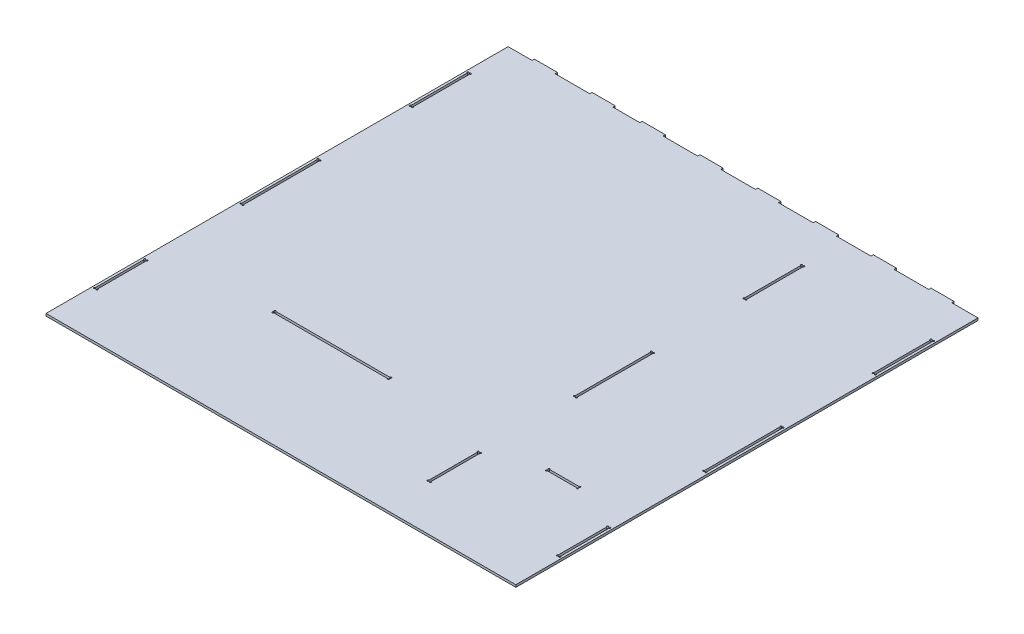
ISO-10303-21;
HEADER;
FILE_DESCRIPTION(('STEP AP214'),'2;1');
FILE_NAME('part.step','',(''),(''),'','','');
FILE_SCHEMA(('AUTOMOTIVE_DESIGN { 1 0 10303 214 1 1 1 1 }'));
ENDSEC;
DATA;
#1=APPLICATION_CONTEXT('core data for automotive mechanical design processes');
#2=APPLICATION_PROTOCOL_DEFINITION('international standard','automotive_design',2000,#1);
#3=PRODUCT_CONTEXT('',#1,'mechanical');
#4=PRODUCT('Part','Part','',(#3));
#5=PRODUCT_RELATED_PRODUCT_CATEGORY('part','',(#4));
#6=PRODUCT_DEFINITION_FORMATION('','',#4);
#7=PRODUCT_DEFINITION_CONTEXT('part definition',#1,'design');
#8=PRODUCT_DEFINITION('design','',#6,#7);
#9=PRODUCT_DEFINITION_SHAPE('','',#8);
#10=(LENGTH_UNIT() NAMED_UNIT(*) SI_UNIT(.MILLI.,.METRE.));
#11=(NAMED_UNIT(*) PLANE_ANGLE_UNIT() SI_UNIT($,.RADIAN.));
#12=(NAMED_UNIT(*) SI_UNIT($,.STERADIAN.) SOLID_ANGLE_UNIT());
#13=UNCERTAINTY_MEASURE_WITH_UNIT(LENGTH_MEASURE(1.E-05),#10,'distance_accuracy_value','');
#14=(GEOMETRIC_REPRESENTATION_CONTEXT(3) GLOBAL_UNCERTAINTY_ASSIGNED_CONTEXT((#13)) GLOBAL_UNIT_ASSIGNED_CONTEXT((#10,
#11,#12)) REPRESENTATION_CONTEXT('',''));
#15=CARTESIAN_POINT('',(0.,0.,0.));
#16=DIRECTION('',(0.,0.,1.));
#17=DIRECTION('',(1.,0.,0.));
#18=AXIS2_PLACEMENT_3D('',#15,#16,#17);
#19=CARTESIAN_POINT('',(0.,174.,1200.));
#20=DIRECTION('',(0.,1.,0.));
#21=DIRECTION('',(0.,0.,1.));
#22=AXIS2_PLACEMENT_3D('',#19,#20,#21);
#23=PLANE('',#22);
#24=CARTESIAN_POINT('',(-18.,174.,903.));
#25=DIRECTION('',(0.,1.,0.));
#26=DIRECTION('',(0.,0.,1.));
#27=AXIS2_PLACEMENT_3D('',#24,#25,#26);
#28=CIRCLE('',#27,2.);
#29=CARTESIAN_POINT('',(-20.,174.,903.));
#30=VERTEX_POINT('',#29);
#31=CARTESIAN_POINT('',(-18.,174.,901.));
#32=VERTEX_POINT('',#31);
#33=EDGE_CURVE('E92',#30,#32,#28,.T.);
#34=ORIENTED_EDGE('',*,*,#33,.F.);
#35=DIRECTION('',(1.,0.,0.));
#36=VECTOR('',#35,1.);
#37=CARTESIAN_POINT('',(-316.,174.,903.));
#38=LINE('',#37,#36);
#39=CARTESIAN_POINT('',(-316.,174.,903.));
#40=VERTEX_POINT('',#39);
#41=EDGE_CURVE('E883',#40,#30,#38,.T.);
#42=ORIENTED_EDGE('',*,*,#41,.F.);
#43=CARTESIAN_POINT('',(-318.,174.,903.));
#44=DIRECTION('',(0.,1.,0.));
#45=DIRECTION('',(0.,0.,1.));
#46=AXIS2_PLACEMENT_3D('',#43,#44,#45);
#47=CIRCLE('',#46,2.);
#48=CARTESIAN_POINT('',(-318.,174.,901.));
#49=VERTEX_POINT('',#48);
#50=EDGE_CURVE('E879',#49,#40,#47,.T.);
#51=ORIENTED_EDGE('',*,*,#50,.F.);
#52=DIRECTION('',(0.,0.,1.));
#53=VECTOR('',#52,1.);
#54=CARTESIAN_POINT('',(-318.,174.,899.));
#55=LINE('',#54,#53);
#56=CARTESIAN_POINT('',(-318.,174.,899.));
#57=VERTEX_POINT('',#56);
#58=EDGE_CURVE('E875',#57,#49,#55,.T.);
#59=ORIENTED_EDGE('',*,*,#58,.F.);
#60=CARTESIAN_POINT('',(-318.,174.,897.));
#61=DIRECTION('',(0.,1.,0.));
#62=DIRECTION('',(0.,0.,1.));
#63=AXIS2_PLACEMENT_3D('',#60,#61,#62);
#64=CIRCLE('',#63,2.);
#65=CARTESIAN_POINT('',(-316.,174.,897.));
#66=VERTEX_POINT('',#65);
#67=EDGE_CURVE('E868',#66,#57,#64,.T.);
#68=ORIENTED_EDGE('',*,*,#67,.F.);
#69=DIRECTION('',(-1.,0.,0.));
#70=VECTOR('',#69,1.);
#71=CARTESIAN_POINT('',(-316.,174.,897.));
#72=LINE('',#71,#70);
#73=CARTESIAN_POINT('',(-20.,174.,897.));
#74=VERTEX_POINT('',#73);
#75=EDGE_CURVE('E864',#74,#66,#72,.T.);
#76=ORIENTED_EDGE('',*,*,#75,.F.);
#77=CARTESIAN_POINT('',(-18.,174.,897.));
#78=DIRECTION('',(0.,1.,0.));
#79=DIRECTION('',(0.,0.,1.));
#80=AXIS2_PLACEMENT_3D('',#77,#78,#79);
#81=CIRCLE('',#80,2.);
#82=CARTESIAN_POINT('',(-18.,174.,899.));
#83=VERTEX_POINT('',#82);
#84=EDGE_CURVE('E845',#83,#74,#81,.T.);
#85=ORIENTED_EDGE('',*,*,#84,.F.);
#86=DIRECTION('',(0.,0.,-1.));
#87=VECTOR('',#86,1.);
#88=CARTESIAN_POINT('',(-18.,174.,899.));
#89=LINE('',#88,#87);
#90=EDGE_CURVE('E856',#32,#83,#89,.T.);
#91=ORIENTED_EDGE('',*,*,#90,.F.);
#92=EDGE_LOOP('',(#34,#42,#51,#59,#68,#76,#85,#91));
#93=FACE_BOUND('',#92,.T.);
#94=CARTESIAN_POINT('',(392.999999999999,174.,903.));
#95=DIRECTION('',(0.,1.,0.));
#96=DIRECTION('',(0.,0.,1.));
#97=AXIS2_PLACEMENT_3D('',#94,#95,#96);
#98=CIRCLE('',#97,2.);
#99=CARTESIAN_POINT('',(392.999999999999,174.,901.));
#100=VERTEX_POINT('',#99);
#101=CARTESIAN_POINT('',(394.999999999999,174.,903.));
#102=VERTEX_POINT('',#101);
#103=EDGE_CURVE('E100',#100,#102,#98,.T.);
#104=ORIENTED_EDGE('',*,*,#103,.F.);
#105=DIRECTION('',(0.,0.,1.));
#106=VECTOR('',#105,1.);
#107=CARTESIAN_POINT('',(392.999999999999,174.,899.));
#108=LINE('',#107,#106);
#109=CARTESIAN_POINT('',(392.999999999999,174.,899.));
#110=VERTEX_POINT('',#109);
#111=EDGE_CURVE('E910',#110,#100,#108,.T.);
#112=ORIENTED_EDGE('',*,*,#111,.F.);
#113=CARTESIAN_POINT('',(392.999999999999,174.,897.));
#114=DIRECTION('',(0.,1.,0.));
#115=DIRECTION('',(0.,0.,1.));
#116=AXIS2_PLACEMENT_3D('',#113,#114,#115);
#117=CIRCLE('',#116,2.);
#118=CARTESIAN_POINT('',(394.999999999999,174.,897.));
#119=VERTEX_POINT('',#118);
#120=EDGE_CURVE('E935',#119,#110,#117,.T.);
#121=ORIENTED_EDGE('',*,*,#120,.F.);
#122=DIRECTION('',(-1.,0.,0.));
#123=VECTOR('',#122,1.);
#124=CARTESIAN_POINT('',(394.999999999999,174.,897.));
#125=LINE('',#124,#123);
#126=CARTESIAN_POINT('',(470.999999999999,174.,897.));
#127=VERTEX_POINT('',#126);
#128=EDGE_CURVE('E939',#127,#119,#125,.T.);
#129=ORIENTED_EDGE('',*,*,#128,.F.);
#130=CARTESIAN_POINT('',(472.999999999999,174.,897.));
#131=DIRECTION('',(0.,1.,0.));
#132=DIRECTION('',(0.,0.,1.));
#133=AXIS2_PLACEMENT_3D('',#130,#131,#132);
#134=CIRCLE('',#133,2.);
#135=CARTESIAN_POINT('',(472.999999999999,174.,899.));
#136=VERTEX_POINT('',#135);
#137=EDGE_CURVE('E943',#136,#127,#134,.T.);
#138=ORIENTED_EDGE('',*,*,#137,.F.);
#139=DIRECTION('',(0.,0.,-1.));
#140=VECTOR('',#139,1.);
#141=CARTESIAN_POINT('',(472.999999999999,174.,899.));
#142=LINE('',#141,#140);
#143=CARTESIAN_POINT('',(472.999999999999,174.,901.));
#144=VERTEX_POINT('',#143);
#145=EDGE_CURVE('E947',#144,#136,#142,.T.);
#146=ORIENTED_EDGE('',*,*,#145,.F.);
#147=CARTESIAN_POINT('',(472.999999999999,174.,903.));
#148=DIRECTION('',(0.,1.,0.));
#149=DIRECTION('',(0.,0.,1.));
#150=AXIS2_PLACEMENT_3D('',#147,#148,#149);
#151=CIRCLE('',#150,2.);
#152=CARTESIAN_POINT('',(470.999999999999,174.,903.));
#153=VERTEX_POINT('',#152);
#154=EDGE_CURVE('E951',#153,#144,#151,.T.);
#155=ORIENTED_EDGE('',*,*,#154,.F.);
#156=DIRECTION('',(1.,0.,0.));
#157=VECTOR('',#156,1.);
#158=CARTESIAN_POINT('',(394.999999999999,174.,903.));
#159=LINE('',#158,#157);
#160=EDGE_CURVE('E955',#102,#153,#159,.T.);
#161=ORIENTED_EDGE('',*,*,#160,.F.);
#162=EDGE_LOOP('',(#104,#112,#121,#129,#138,#146,#155,#161));
#163=FACE_BOUND('',#162,.T.);
#164=CARTESIAN_POINT('',(268.,174.,700.));
#165=DIRECTION('',(0.,1.,0.));
#166=DIRECTION('',(0.,0.,1.));
#167=AXIS2_PLACEMENT_3D('',#164,#165,#166);
#168=CIRCLE('',#167,2.);
#169=CARTESIAN_POINT('',(266.,174.,700.));
#170=VERTEX_POINT('',#169);
#171=CARTESIAN_POINT('',(268.,174.,698.));
#172=VERTEX_POINT('',#171);
#173=EDGE_CURVE('E969',#170,#172,#168,.T.);
#174=ORIENTED_EDGE('',*,*,#173,.F.);
#175=DIRECTION('',(1.,0.,0.));
#176=VECTOR('',#175,1.);
#177=CARTESIAN_POINT('',(0.,174.,700.));
#178=LINE('',#177,#176);
#179=CARTESIAN_POINT('',(264.,174.,700.));
#180=VERTEX_POINT('',#179);
#181=EDGE_CURVE('E1739',#180,#170,#178,.T.);
#182=ORIENTED_EDGE('',*,*,#181,.F.);
#183=CARTESIAN_POINT('',(262.,174.,700.));
#184=DIRECTION('',(0.,1.,0.));
#185=DIRECTION('',(0.,0.,1.));
#186=AXIS2_PLACEMENT_3D('',#183,#184,#185);
#187=CIRCLE('',#186,2.00000000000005);
#188=CARTESIAN_POINT('',(262.,174.,698.));
#189=VERTEX_POINT('',#188);
#190=EDGE_CURVE('E964',#189,#180,#187,.T.);
#191=ORIENTED_EDGE('',*,*,#190,.F.);
#192=DIRECTION('',(0.,0.,1.));
#193=VECTOR('',#192,1.);
#194=CARTESIAN_POINT('',(262.,174.,0.));
#195=LINE('',#194,#193);
#196=CARTESIAN_POINT('',(262.,174.,502.));
#197=VERTEX_POINT('',#196);
#198=EDGE_CURVE('E1735',#197,#189,#195,.T.);
#199=ORIENTED_EDGE('',*,*,#198,.F.);
#200=CARTESIAN_POINT('',(262.,174.,500.));
#201=DIRECTION('',(0.,1.,0.));
#202=DIRECTION('',(0.,0.,1.));
#203=AXIS2_PLACEMENT_3D('',#200,#201,#202);
#204=CIRCLE('',#203,2.);
#205=CARTESIAN_POINT('',(264.,174.,500.));
#206=VERTEX_POINT('',#205);
#207=EDGE_CURVE('E1077',#206,#197,#204,.T.);
#208=ORIENTED_EDGE('',*,*,#207,.F.);
#209=DIRECTION('',(1.,0.,0.));
#210=VECTOR('',#209,1.);
#211=CARTESIAN_POINT('',(0.,174.,500.));
#212=LINE('',#211,#210);
#213=CARTESIAN_POINT('',(266.,174.,500.));
#214=VERTEX_POINT('',#213);
#215=EDGE_CURVE('E1757',#206,#214,#212,.T.);
#216=ORIENTED_EDGE('',*,*,#215,.T.);
#217=CARTESIAN_POINT('',(268.,174.,500.));
#218=DIRECTION('',(0.,1.,0.));
#219=DIRECTION('',(0.,0.,1.));
#220=AXIS2_PLACEMENT_3D('',#217,#218,#219);
#221=CIRCLE('',#220,2.);
#222=CARTESIAN_POINT('',(268.,174.,502.));
#223=VERTEX_POINT('',#222);
#224=EDGE_CURVE('E1089',#223,#214,#221,.T.);
#225=ORIENTED_EDGE('',*,*,#224,.F.);
#226=DIRECTION('',(0.,0.,1.));
#227=VECTOR('',#226,1.);
#228=CARTESIAN_POINT('',(268.,174.,0.));
#229=LINE('',#228,#227);
#230=EDGE_CURVE('E1714',#223,#172,#229,.T.);
#231=ORIENTED_EDGE('',*,*,#230,.T.);
#232=EDGE_LOOP('',(#174,#182,#191,#199,#208,#216,#225,#231));
#233=FACE_BOUND('',#232,.T.);
#234=CARTESIAN_POINT('',(598.,174.,110.));
#235=DIRECTION('',(0.,1.,0.));
#236=DIRECTION('',(0.,0.,1.));
#237=AXIS2_PLACEMENT_3D('',#234,#235,#236);
#238=CIRCLE('',#237,2.);
#239=CARTESIAN_POINT('',(600.,174.,110.));
#240=VERTEX_POINT('',#239);
#241=CARTESIAN_POINT('',(598.,174.,112.));
#242=VERTEX_POINT('',#241);
#243=EDGE_CURVE('E2061',#240,#242,#238,.T.);
#244=ORIENTED_EDGE('',*,*,#243,.F.);
#245=DIRECTION('',(1.,0.,0.));
#246=VECTOR('',#245,1.);
#247=CARTESIAN_POINT('',(0.,174.,110.));
#248=LINE('',#247,#246);
#249=CARTESIAN_POINT('',(602.,174.,110.));
#250=VERTEX_POINT('',#249);
#251=EDGE_CURVE('E972',#240,#250,#248,.T.);
#252=ORIENTED_EDGE('',*,*,#251,.T.);
#253=CARTESIAN_POINT('',(604.,174.,110.));
#254=DIRECTION('',(0.,1.,0.));
#255=DIRECTION('',(0.,0.,1.));
#256=AXIS2_PLACEMENT_3D('',#253,#254,#255);
#257=CIRCLE('',#256,2.);
#258=CARTESIAN_POINT('',(604.,174.,112.));
#259=VERTEX_POINT('',#258);
#260=EDGE_CURVE('E983',#259,#250,#257,.T.);
#261=ORIENTED_EDGE('',*,*,#260,.F.);
#262=DIRECTION('',(0.,0.,1.));
#263=VECTOR('',#262,1.);
#264=CARTESIAN_POINT('',(604.,174.,0.));
#265=LINE('',#264,#263);
#266=CARTESIAN_POINT('',(604.,174.,258.));
#267=VERTEX_POINT('',#266);
#268=EDGE_CURVE('E1859',#259,#267,#265,.T.);
#269=ORIENTED_EDGE('',*,*,#268,.T.);
#270=CARTESIAN_POINT('',(604.,174.,260.));
#271=DIRECTION('',(0.,1.,0.));
#272=DIRECTION('',(0.,0.,1.));
#273=AXIS2_PLACEMENT_3D('',#270,#271,#272);
#274=CIRCLE('',#273,2.);
#275=CARTESIAN_POINT('',(602.,174.,260.));
#276=VERTEX_POINT('',#275);
#277=EDGE_CURVE('E994',#276,#267,#274,.T.);
#278=ORIENTED_EDGE('',*,*,#277,.F.);
#279=DIRECTION('',(1.,0.,0.));
#280=VECTOR('',#279,1.);
#281=CARTESIAN_POINT('',(0.,174.,260.));
#282=LINE('',#281,#280);
#283=CARTESIAN_POINT('',(600.,174.,260.));
#284=VERTEX_POINT('',#283);
#285=EDGE_CURVE('E2050',#284,#276,#282,.T.);
#286=ORIENTED_EDGE('',*,*,#285,.F.);
#287=CARTESIAN_POINT('',(598.,174.,260.));
#288=DIRECTION('',(0.,1.,0.));
#289=DIRECTION('',(0.,0.,1.));
#290=AXIS2_PLACEMENT_3D('',#287,#288,#289);
#291=CIRCLE('',#290,2.);
#292=CARTESIAN_POINT('',(598.,174.,258.));
#293=VERTEX_POINT('',#292);
#294=EDGE_CURVE('E1933',#293,#284,#291,.T.);
#295=ORIENTED_EDGE('',*,*,#294,.F.);
#296=DIRECTION('',(0.,0.,1.));
#297=VECTOR('',#296,1.);
#298=CARTESIAN_POINT('',(598.,174.,0.));
#299=LINE('',#298,#297);
#300=EDGE_CURVE('E2046',#242,#293,#299,.T.);
#301=ORIENTED_EDGE('',*,*,#300,.F.);
#302=EDGE_LOOP('',(#244,#252,#261,#269,#278,#286,#295,#301));
#303=FACE_BOUND('',#302,.T.);
#304=CARTESIAN_POINT('',(-604.,174.,500.));
#305=DIRECTION('',(0.,1.,0.));
#306=DIRECTION('',(0.,0.,1.));
#307=AXIS2_PLACEMENT_3D('',#304,#305,#306);
#308=CIRCLE('',#307,2.);
#309=CARTESIAN_POINT('',(-602.,174.,500.));
#310=VERTEX_POINT('',#309);
#311=CARTESIAN_POINT('',(-604.,174.,502.));
#312=VERTEX_POINT('',#311);
#313=EDGE_CURVE('E1009',#310,#312,#308,.T.);
#314=ORIENTED_EDGE('',*,*,#313,.F.);
#315=DIRECTION('',(1.,0.,0.));
#316=VECTOR('',#315,1.);
#317=CARTESIAN_POINT('',(0.,174.,500.));
#318=LINE('',#317,#316);
#319=CARTESIAN_POINT('',(-600.,174.,500.));
#320=VERTEX_POINT('',#319);
#321=EDGE_CURVE('E1855',#310,#320,#318,.T.);
#322=ORIENTED_EDGE('',*,*,#321,.T.);
#323=CARTESIAN_POINT('',(-598.,174.,500.));
#324=DIRECTION('',(0.,1.,0.));
#325=DIRECTION('',(0.,0.,1.));
#326=AXIS2_PLACEMENT_3D('',#323,#324,#325);
#327=CIRCLE('',#326,2.);
#328=CARTESIAN_POINT('',(-598.,174.,502.));
#329=VERTEX_POINT('',#328);
#330=EDGE_CURVE('E1020',#329,#320,#327,.T.);
#331=ORIENTED_EDGE('',*,*,#330,.F.);
#332=DIRECTION('',(0.,0.,1.));
#333=VECTOR('',#332,1.);
#334=CARTESIAN_POINT('',(-598.,174.,0.));
#335=LINE('',#334,#333);
#336=CARTESIAN_POINT('',(-598.,174.,698.));
#337=VERTEX_POINT('',#336);
#338=EDGE_CURVE('E1813',#329,#337,#335,.T.);
#339=ORIENTED_EDGE('',*,*,#338,.T.);
#340=CARTESIAN_POINT('',(-598.,174.,700.));
#341=DIRECTION('',(0.,1.,0.));
#342=DIRECTION('',(0.,0.,1.));
#343=AXIS2_PLACEMENT_3D('',#340,#341,#342);
#344=CIRCLE('',#343,2.);
#345=CARTESIAN_POINT('',(-600.,174.,700.));
#346=VERTEX_POINT('',#345);
#347=EDGE_CURVE('E1842',#346,#337,#344,.T.);
#348=ORIENTED_EDGE('',*,*,#347,.F.);
#349=DIRECTION('',(1.,0.,0.));
#350=VECTOR('',#349,1.);
#351=CARTESIAN_POINT('',(0.,174.,700.));
#352=LINE('',#351,#350);
#353=CARTESIAN_POINT('',(-602.,174.,700.));
#354=VERTEX_POINT('',#353);
#355=EDGE_CURVE('E1838',#354,#346,#352,.T.);
#356=ORIENTED_EDGE('',*,*,#355,.F.);
#357=CARTESIAN_POINT('',(-604.,174.,700.));
#358=DIRECTION('',(0.,1.,0.));
#359=DIRECTION('',(0.,0.,1.));
#360=AXIS2_PLACEMENT_3D('',#357,#358,#359);
#361=CIRCLE('',#360,2.);
#362=CARTESIAN_POINT('',(-604.,174.,698.));
#363=VERTEX_POINT('',#362);
#364=EDGE_CURVE('E1834',#363,#354,#361,.T.);
#365=ORIENTED_EDGE('',*,*,#364,.F.);
#366=DIRECTION('',(0.,0.,1.));
#367=VECTOR('',#366,1.);
#368=CARTESIAN_POINT('',(-604.,174.,0.));
#369=LINE('',#368,#367);
#370=EDGE_CURVE('E1833',#312,#363,#369,.T.);
#371=ORIENTED_EDGE('',*,*,#370,.F.);
#372=EDGE_LOOP('',(#314,#322,#331,#339,#348,#356,#365,#371));
#373=FACE_BOUND('',#372,.T.);
#374=CARTESIAN_POINT('',(-604.,174.,1080.));
#375=DIRECTION('',(0.,1.,0.));
#376=DIRECTION('',(0.,0.,1.));
#377=AXIS2_PLACEMENT_3D('',#374,#375,#376);
#378=CIRCLE('',#377,2.);
#379=CARTESIAN_POINT('',(-604.,174.,1078.));
#380=VERTEX_POINT('',#379);
#381=CARTESIAN_POINT('',(-602.,174.,1080.));
#382=VERTEX_POINT('',#381);
#383=EDGE_CURVE('E1800',#380,#382,#378,.T.);
#384=ORIENTED_EDGE('',*,*,#383,.F.);
#385=DIRECTION('',(0.,0.,1.));
#386=VECTOR('',#385,1.);
#387=CARTESIAN_POINT('',(-604.,174.,0.));
#388=LINE('',#387,#386);
#389=CARTESIAN_POINT('',(-604.,174.,952.));
#390=VERTEX_POINT('',#389);
#391=EDGE_CURVE('E1796',#390,#380,#388,.T.);
#392=ORIENTED_EDGE('',*,*,#391,.F.);
#393=CARTESIAN_POINT('',(-604.,174.,950.));
#394=DIRECTION('',(0.,1.,0.));
#395=DIRECTION('',(0.,0.,1.));
#396=AXIS2_PLACEMENT_3D('',#393,#394,#395);
#397=CIRCLE('',#396,2.);
#398=CARTESIAN_POINT('',(-602.,174.,950.));
#399=VERTEX_POINT('',#398);
#400=EDGE_CURVE('E1053',#399,#390,#397,.T.);
#401=ORIENTED_EDGE('',*,*,#400,.F.);
#402=DIRECTION('',(1.,0.,0.));
#403=VECTOR('',#402,1.);
#404=CARTESIAN_POINT('',(0.,174.,950.));
#405=LINE('',#404,#403);
#406=CARTESIAN_POINT('',(-600.,174.,950.));
#407=VERTEX_POINT('',#406);
#408=EDGE_CURVE('E1809',#399,#407,#405,.T.);
#409=ORIENTED_EDGE('',*,*,#408,.T.);
#410=CARTESIAN_POINT('',(-598.,174.,950.));
#411=DIRECTION('',(0.,1.,0.));
#412=DIRECTION('',(0.,0.,1.));
#413=AXIS2_PLACEMENT_3D('',#410,#411,#412);
#414=CIRCLE('',#413,2.);
#415=CARTESIAN_POINT('',(-598.,174.,952.));
#416=VERTEX_POINT('',#415);
#417=EDGE_CURVE('E1062',#416,#407,#414,.T.);
#418=ORIENTED_EDGE('',*,*,#417,.F.);
#419=DIRECTION('',(0.,0.,1.));
#420=VECTOR('',#419,1.);
#421=CARTESIAN_POINT('',(-598.,174.,0.));
#422=LINE('',#421,#420);
#423=CARTESIAN_POINT('',(-598.,174.,1078.));
#424=VERTEX_POINT('',#423);
#425=EDGE_CURVE('E1761',#416,#424,#422,.T.);
#426=ORIENTED_EDGE('',*,*,#425,.T.);
#427=CARTESIAN_POINT('',(-598.,174.,1080.));
#428=DIRECTION('',(0.,1.,0.));
#429=DIRECTION('',(0.,0.,1.));
#430=AXIS2_PLACEMENT_3D('',#427,#428,#429);
#431=CIRCLE('',#430,2.);
#432=CARTESIAN_POINT('',(-600.,174.,1080.));
#433=VERTEX_POINT('',#432);
#434=EDGE_CURVE('E1782',#433,#424,#431,.T.);
#435=ORIENTED_EDGE('',*,*,#434,.F.);
#436=DIRECTION('',(1.,0.,0.));
#437=VECTOR('',#436,1.);
#438=CARTESIAN_POINT('',(0.,174.,1080.));
#439=LINE('',#438,#437);
#440=EDGE_CURVE('E1781',#382,#433,#439,.T.);
#441=ORIENTED_EDGE('',*,*,#440,.F.);
#442=EDGE_LOOP('',(#384,#392,#401,#409,#418,#426,#435,#441));
#443=FACE_BOUND('',#442,.T.);
#444=CARTESIAN_POINT('',(262.,174.,260.));
#445=DIRECTION('',(0.,1.,0.));
#446=DIRECTION('',(0.,0.,1.));
#447=AXIS2_PLACEMENT_3D('',#444,#445,#446);
#448=CIRCLE('',#447,2.);
#449=CARTESIAN_POINT('',(262.,174.,258.));
#450=VERTEX_POINT('',#449);
#451=CARTESIAN_POINT('',(264.,174.,260.));
#452=VERTEX_POINT('',#451);
#453=EDGE_CURVE('E1698',#450,#452,#448,.T.);
#454=ORIENTED_EDGE('',*,*,#453,.F.);
#455=DIRECTION('',(0.,0.,1.));
#456=VECTOR('',#455,1.);
#457=CARTESIAN_POINT('',(262.,174.,0.));
#458=LINE('',#457,#456);
#459=CARTESIAN_POINT('',(262.,174.,112.));
#460=VERTEX_POINT('',#459);
#461=EDGE_CURVE('E1694',#460,#450,#458,.T.);
#462=ORIENTED_EDGE('',*,*,#461,.F.);
#463=CARTESIAN_POINT('',(262.,174.,110.));
#464=DIRECTION('',(0.,1.,0.));
#465=DIRECTION('',(0.,0.,1.));
#466=AXIS2_PLACEMENT_3D('',#463,#464,#465);
#467=CIRCLE('',#466,2.);
#468=CARTESIAN_POINT('',(264.,174.,110.));
#469=VERTEX_POINT('',#468);
#470=EDGE_CURVE('E1114',#469,#460,#467,.T.);
#471=ORIENTED_EDGE('',*,*,#470,.F.);
#472=DIRECTION('',(1.,0.,0.));
#473=VECTOR('',#472,1.);
#474=CARTESIAN_POINT('',(0.,174.,110.));
#475=LINE('',#474,#473);
#476=CARTESIAN_POINT('',(266.,174.,110.));
#477=VERTEX_POINT('',#476);
#478=EDGE_CURVE('E1709',#469,#477,#475,.T.);
#479=ORIENTED_EDGE('',*,*,#478,.T.);
#480=CARTESIAN_POINT('',(268.,174.,110.));
#481=DIRECTION('',(0.,1.,0.));
#482=DIRECTION('',(0.,0.,1.));
#483=AXIS2_PLACEMENT_3D('',#480,#481,#482);
#484=CIRCLE('',#483,2.);
#485=CARTESIAN_POINT('',(268.,174.,112.));
#486=VERTEX_POINT('',#485);
#487=EDGE_CURVE('E1123',#486,#477,#484,.T.);
#488=ORIENTED_EDGE('',*,*,#487,.F.);
#489=DIRECTION('',(0.,0.,1.));
#490=VECTOR('',#489,1.);
#491=CARTESIAN_POINT('',(268.,174.,0.));
#492=LINE('',#491,#490);
#493=CARTESIAN_POINT('',(268.,174.,258.));
#494=VERTEX_POINT('',#493);
#495=EDGE_CURVE('E1713',#486,#494,#492,.T.);
#496=ORIENTED_EDGE('',*,*,#495,.T.);
#497=CARTESIAN_POINT('',(268.,174.,260.));
#498=DIRECTION('',(0.,1.,0.));
#499=DIRECTION('',(0.,0.,1.));
#500=AXIS2_PLACEMENT_3D('',#497,#498,#499);
#501=CIRCLE('',#500,2.);
#502=CARTESIAN_POINT('',(266.,174.,260.));
#503=VERTEX_POINT('',#502);
#504=EDGE_CURVE('E1680',#503,#494,#501,.T.);
#505=ORIENTED_EDGE('',*,*,#504,.F.);
#506=DIRECTION('',(1.,0.,0.));
#507=VECTOR('',#506,1.);
#508=CARTESIAN_POINT('',(0.,174.,260.));
#509=LINE('',#508,#507);
#510=EDGE_CURVE('E1679',#452,#503,#509,.T.);
#511=ORIENTED_EDGE('',*,*,#510,.F.);
#512=EDGE_LOOP('',(#454,#462,#471,#479,#488,#496,#505,#511));
#513=FACE_BOUND('',#512,.T.);
#514=CARTESIAN_POINT('',(262.,174.,1080.));
#515=DIRECTION('',(0.,1.,0.));
#516=DIRECTION('',(0.,0.,1.));
#517=AXIS2_PLACEMENT_3D('',#514,#515,#516);
#518=CIRCLE('',#517,2.);
#519=CARTESIAN_POINT('',(262.,174.,1078.));
#520=VERTEX_POINT('',#519);
#521=CARTESIAN_POINT('',(264.,174.,1080.));
#522=VERTEX_POINT('',#521);
#523=EDGE_CURVE('E2012',#520,#522,#518,.T.);
#524=ORIENTED_EDGE('',*,*,#523,.F.);
#525=DIRECTION('',(0.,0.,1.));
#526=VECTOR('',#525,1.);
#527=CARTESIAN_POINT('',(262.,174.,0.));
#528=LINE('',#527,#526);
#529=CARTESIAN_POINT('',(262.,174.,952.));
#530=VERTEX_POINT('',#529);
#531=EDGE_CURVE('E2008',#530,#520,#528,.T.);
#532=ORIENTED_EDGE('',*,*,#531,.F.);
#533=CARTESIAN_POINT('',(262.,174.,950.));
#534=DIRECTION('',(0.,1.,0.));
#535=DIRECTION('',(0.,0.,1.));
#536=AXIS2_PLACEMENT_3D('',#533,#534,#535);
#537=CIRCLE('',#536,2.);
#538=CARTESIAN_POINT('',(264.,174.,950.));
#539=VERTEX_POINT('',#538);
#540=EDGE_CURVE('E1148',#539,#530,#537,.T.);
#541=ORIENTED_EDGE('',*,*,#540,.F.);
#542=DIRECTION('',(1.,0.,0.));
#543=VECTOR('',#542,1.);
#544=CARTESIAN_POINT('',(0.,174.,950.));
#545=LINE('',#544,#543);
#546=CARTESIAN_POINT('',(266.,174.,950.));
#547=VERTEX_POINT('',#546);
#548=EDGE_CURVE('E1721',#539,#547,#545,.T.);
#549=ORIENTED_EDGE('',*,*,#548,.T.);
#550=CARTESIAN_POINT('',(268.,174.,950.));
#551=DIRECTION('',(0.,1.,0.));
#552=DIRECTION('',(0.,0.,1.));
#553=AXIS2_PLACEMENT_3D('',#550,#551,#552);
#554=CIRCLE('',#553,2.);
#555=CARTESIAN_POINT('',(268.,174.,952.));
#556=VERTEX_POINT('',#555);
#557=EDGE_CURVE('E1157',#556,#547,#554,.T.);
#558=ORIENTED_EDGE('',*,*,#557,.F.);
#559=DIRECTION('',(0.,0.,1.));
#560=VECTOR('',#559,1.);
#561=CARTESIAN_POINT('',(268.,174.,0.));
#562=LINE('',#561,#560);
#563=CARTESIAN_POINT('',(268.,174.,1078.));
#564=VERTEX_POINT('',#563);
#565=EDGE_CURVE('E1974',#556,#564,#562,.T.);
#566=ORIENTED_EDGE('',*,*,#565,.T.);
#567=CARTESIAN_POINT('',(268.,174.,1080.));
#568=DIRECTION('',(0.,1.,0.));
#569=DIRECTION('',(0.,0.,1.));
#570=AXIS2_PLACEMENT_3D('',#567,#568,#569);
#571=CIRCLE('',#570,2.);
#572=CARTESIAN_POINT('',(266.,174.,1080.));
#573=VERTEX_POINT('',#572);
#574=EDGE_CURVE('E1994',#573,#564,#571,.T.);
#575=ORIENTED_EDGE('',*,*,#574,.F.);
#576=DIRECTION('',(1.,0.,0.));
#577=VECTOR('',#576,1.);
#578=CARTESIAN_POINT('',(0.,174.,1080.));
#579=LINE('',#578,#577);
#580=EDGE_CURVE('E1702',#522,#573,#579,.T.);
#581=ORIENTED_EDGE('',*,*,#580,.F.);
#582=EDGE_LOOP('',(#524,#532,#541,#549,#558,#566,#575,#581));
#583=FACE_BOUND('',#582,.T.);
#584=CARTESIAN_POINT('',(598.,174.,1080.));
#585=DIRECTION('',(0.,1.,0.));
#586=DIRECTION('',(0.,0.,1.));
#587=AXIS2_PLACEMENT_3D('',#584,#585,#586);
#588=CIRCLE('',#587,2.);
#589=CARTESIAN_POINT('',(598.,174.,1078.));
#590=VERTEX_POINT('',#589);
#591=CARTESIAN_POINT('',(600.,174.,1080.));
#592=VERTEX_POINT('',#591);
#593=EDGE_CURVE('E1961',#590,#592,#588,.T.);
#594=ORIENTED_EDGE('',*,*,#593,.F.);
#595=DIRECTION('',(0.,0.,1.));
#596=VECTOR('',#595,1.);
#597=CARTESIAN_POINT('',(598.,174.,0.));
#598=LINE('',#597,#596);
#599=CARTESIAN_POINT('',(598.,174.,952.));
#600=VERTEX_POINT('',#599);
#601=EDGE_CURVE('E1957',#600,#590,#598,.T.);
#602=ORIENTED_EDGE('',*,*,#601,.F.);
#603=CARTESIAN_POINT('',(598.,174.,950.));
#604=DIRECTION('',(0.,1.,0.));
#605=DIRECTION('',(0.,0.,1.));
#606=AXIS2_PLACEMENT_3D('',#603,#604,#605);
#607=CIRCLE('',#606,2.);
#608=CARTESIAN_POINT('',(600.,174.,950.));
#609=VERTEX_POINT('',#608);
#610=EDGE_CURVE('E1182',#609,#600,#607,.T.);
#611=ORIENTED_EDGE('',*,*,#610,.F.);
#612=DIRECTION('',(1.,0.,0.));
#613=VECTOR('',#612,1.);
#614=CARTESIAN_POINT('',(0.,174.,950.));
#615=LINE('',#614,#613);
#616=CARTESIAN_POINT('',(602.,174.,950.));
#617=VERTEX_POINT('',#616);
#618=EDGE_CURVE('E1970',#609,#617,#615,.T.);
#619=ORIENTED_EDGE('',*,*,#618,.T.);
#620=CARTESIAN_POINT('',(604.,174.,950.));
#621=DIRECTION('',(0.,1.,0.));
#622=DIRECTION('',(0.,0.,1.));
#623=AXIS2_PLACEMENT_3D('',#620,#621,#622);
#624=CIRCLE('',#623,2.);
#625=CARTESIAN_POINT('',(604.,174.,952.));
#626=VERTEX_POINT('',#625);
#627=EDGE_CURVE('E1191',#626,#617,#624,.T.);
#628=ORIENTED_EDGE('',*,*,#627,.F.);
#629=DIRECTION('',(0.,0.,1.));
#630=VECTOR('',#629,1.);
#631=CARTESIAN_POINT('',(604.,174.,0.));
#632=LINE('',#631,#630);
#633=CARTESIAN_POINT('',(604.,174.,1078.));
#634=VERTEX_POINT('',#633);
#635=EDGE_CURVE('E1917',#626,#634,#632,.T.);
#636=ORIENTED_EDGE('',*,*,#635,.T.);
#637=CARTESIAN_POINT('',(604.,174.,1080.));
#638=DIRECTION('',(0.,1.,0.));
#639=DIRECTION('',(0.,0.,1.));
#640=AXIS2_PLACEMENT_3D('',#637,#638,#639);
#641=CIRCLE('',#640,2.);
#642=CARTESIAN_POINT('',(602.,174.,1080.));
#643=VERTEX_POINT('',#642);
#644=EDGE_CURVE('E1943',#643,#634,#641,.T.);
#645=ORIENTED_EDGE('',*,*,#644,.F.);
#646=DIRECTION('',(1.,0.,0.));
#647=VECTOR('',#646,1.);
#648=CARTESIAN_POINT('',(0.,174.,1080.));
#649=LINE('',#648,#647);
#650=EDGE_CURVE('E1942',#592,#643,#649,.T.);
#651=ORIENTED_EDGE('',*,*,#650,.F.);
#652=EDGE_LOOP('',(#594,#602,#611,#619,#628,#636,#645,#651));
#653=FACE_BOUND('',#652,.T.);
#654=CARTESIAN_POINT('',(598.,174.,700.));
#655=DIRECTION('',(0.,1.,0.));
#656=DIRECTION('',(0.,0.,1.));
#657=AXIS2_PLACEMENT_3D('',#654,#655,#656);
#658=CIRCLE('',#657,2.);
#659=CARTESIAN_POINT('',(598.,174.,698.));
#660=VERTEX_POINT('',#659);
#661=CARTESIAN_POINT('',(600.,174.,700.));
#662=VERTEX_POINT('',#661);
#663=EDGE_CURVE('E1904',#660,#662,#658,.T.);
#664=ORIENTED_EDGE('',*,*,#663,.F.);
#665=DIRECTION('',(0.,0.,1.));
#666=VECTOR('',#665,1.);
#667=CARTESIAN_POINT('',(598.,174.,0.));
#668=LINE('',#667,#666);
#669=CARTESIAN_POINT('',(598.,174.,502.));
#670=VERTEX_POINT('',#669);
#671=EDGE_CURVE('E1900',#670,#660,#668,.T.);
#672=ORIENTED_EDGE('',*,*,#671,.F.);
#673=CARTESIAN_POINT('',(598.,174.,500.));
#674=DIRECTION('',(0.,1.,0.));
#675=DIRECTION('',(0.,0.,1.));
#676=AXIS2_PLACEMENT_3D('',#673,#674,#675);
#677=CIRCLE('',#676,2.);
#678=CARTESIAN_POINT('',(600.,174.,500.));
#679=VERTEX_POINT('',#678);
#680=EDGE_CURVE('E1220',#679,#670,#677,.T.);
#681=ORIENTED_EDGE('',*,*,#680,.F.);
#682=DIRECTION('',(1.,0.,0.));
#683=VECTOR('',#682,1.);
#684=CARTESIAN_POINT('',(0.,174.,500.));
#685=LINE('',#684,#683);
#686=CARTESIAN_POINT('',(602.,174.,500.));
#687=VERTEX_POINT('',#686);
#688=EDGE_CURVE('E1913',#679,#687,#685,.T.);
#689=ORIENTED_EDGE('',*,*,#688,.T.);
#690=CARTESIAN_POINT('',(604.,174.,500.));
#691=DIRECTION('',(0.,1.,0.));
#692=DIRECTION('',(0.,0.,1.));
#693=AXIS2_PLACEMENT_3D('',#690,#691,#692);
#694=CIRCLE('',#693,2.);
#695=CARTESIAN_POINT('',(604.,174.,502.));
#696=VERTEX_POINT('',#695);
#697=EDGE_CURVE('E1229',#696,#687,#694,.T.);
#698=ORIENTED_EDGE('',*,*,#697,.F.);
#699=DIRECTION('',(0.,0.,1.));
#700=VECTOR('',#699,1.);
#701=CARTESIAN_POINT('',(604.,174.,0.));
#702=LINE('',#701,#700);
#703=CARTESIAN_POINT('',(604.,174.,698.));
#704=VERTEX_POINT('',#703);
#705=EDGE_CURVE('E1659',#696,#704,#702,.T.);
#706=ORIENTED_EDGE('',*,*,#705,.T.);
#707=CARTESIAN_POINT('',(604.,174.,700.));
#708=DIRECTION('',(0.,1.,0.));
#709=DIRECTION('',(0.,0.,1.));
#710=AXIS2_PLACEMENT_3D('',#707,#708,#709);
#711=CIRCLE('',#710,2.);
#712=CARTESIAN_POINT('',(602.,174.,700.));
#713=VERTEX_POINT('',#712);
#714=EDGE_CURVE('E1886',#713,#704,#711,.T.);
#715=ORIENTED_EDGE('',*,*,#714,.F.);
#716=DIRECTION('',(1.,0.,0.));
#717=VECTOR('',#716,1.);
#718=CARTESIAN_POINT('',(0.,174.,700.));
#719=LINE('',#718,#717);
#720=EDGE_CURVE('E1885',#662,#713,#719,.T.);
#721=ORIENTED_EDGE('',*,*,#720,.F.);
#722=EDGE_LOOP('',(#664,#672,#681,#689,#698,#706,#715,#721));
#723=FACE_BOUND('',#722,.T.);
#724=CARTESIAN_POINT('',(-604.,174.,260.));
#725=DIRECTION('',(0.,1.,0.));
#726=DIRECTION('',(0.,0.,1.));
#727=AXIS2_PLACEMENT_3D('',#724,#725,#726);
#728=CIRCLE('',#727,2.);
#729=CARTESIAN_POINT('',(-604.,174.,258.));
#730=VERTEX_POINT('',#729);
#731=CARTESIAN_POINT('',(-602.,174.,260.));
#732=VERTEX_POINT('',#731);
#733=EDGE_CURVE('E1646',#730,#732,#728,.T.);
#734=ORIENTED_EDGE('',*,*,#733,.F.);
#735=DIRECTION('',(0.,0.,1.));
#736=VECTOR('',#735,1.);
#737=CARTESIAN_POINT('',(-604.,174.,0.));
#738=LINE('',#737,#736);
#739=CARTESIAN_POINT('',(-604.,174.,112.));
#740=VERTEX_POINT('',#739);
#741=EDGE_CURVE('E1642',#740,#730,#738,.T.);
#742=ORIENTED_EDGE('',*,*,#741,.F.);
#743=CARTESIAN_POINT('',(-604.,174.,110.));
#744=DIRECTION('',(0.,1.,0.));
#745=DIRECTION('',(0.,0.,1.));
#746=AXIS2_PLACEMENT_3D('',#743,#744,#745);
#747=CIRCLE('',#746,2.);
#748=CARTESIAN_POINT('',(-602.,174.,110.));
#749=VERTEX_POINT('',#748);
#750=EDGE_CURVE('E1254',#749,#740,#747,.T.);
#751=ORIENTED_EDGE('',*,*,#750,.F.);
#752=DIRECTION('',(1.,0.,0.));
#753=VECTOR('',#752,1.);
#754=CARTESIAN_POINT('',(0.,174.,110.));
#755=LINE('',#754,#753);
#756=CARTESIAN_POINT('',(-600.,174.,110.));
#757=VERTEX_POINT('',#756);
#758=EDGE_CURVE('E1655',#749,#757,#755,.T.);
#759=ORIENTED_EDGE('',*,*,#758,.T.);
#760=CARTESIAN_POINT('',(-598.,174.,110.));
#761=DIRECTION('',(0.,1.,0.));
#762=DIRECTION('',(0.,0.,1.));
#763=AXIS2_PLACEMENT_3D('',#760,#761,#762);
#764=CIRCLE('',#763,2.);
#765=CARTESIAN_POINT('',(-598.,174.,112.));
#766=VERTEX_POINT('',#765);
#767=EDGE_CURVE('E1263',#766,#757,#764,.T.);
#768=ORIENTED_EDGE('',*,*,#767,.F.);
#769=DIRECTION('',(0.,0.,1.));
#770=VECTOR('',#769,1.);
#771=CARTESIAN_POINT('',(-598.,174.,0.));
#772=LINE('',#771,#770);
#773=CARTESIAN_POINT('',(-598.,174.,258.));
#774=VERTEX_POINT('',#773);
#775=EDGE_CURVE('E1520',#766,#774,#772,.T.);
#776=ORIENTED_EDGE('',*,*,#775,.T.);
#777=CARTESIAN_POINT('',(-598.,174.,260.));
#778=DIRECTION('',(0.,1.,0.));
#779=DIRECTION('',(0.,0.,1.));
#780=AXIS2_PLACEMENT_3D('',#777,#778,#779);
#781=CIRCLE('',#780,2.);
#782=CARTESIAN_POINT('',(-600.,174.,260.));
#783=VERTEX_POINT('',#782);
#784=EDGE_CURVE('E1628',#783,#774,#781,.T.);
#785=ORIENTED_EDGE('',*,*,#784,.F.);
#786=DIRECTION('',(1.,0.,0.));
#787=VECTOR('',#786,1.);
#788=CARTESIAN_POINT('',(0.,174.,260.));
#789=LINE('',#788,#787);
#790=EDGE_CURVE('E1627',#732,#783,#789,.T.);
#791=ORIENTED_EDGE('',*,*,#790,.F.);
#792=EDGE_LOOP('',(#734,#742,#751,#759,#768,#776,#785,#791));
#793=FACE_BOUND('',#792,.T.);
#794=DIRECTION('',(1.,0.,0.));
#795=VECTOR('',#794,1.);
#796=CARTESIAN_POINT('',(0.,174.,0.));
#797=LINE('',#796,#795);
#798=CARTESIAN_POINT('',(542.,174.,0.));
#799=VERTEX_POINT('',#798);
#800=CARTESIAN_POINT('',(610.,174.,0.));
#801=VERTEX_POINT('',#800);
#802=EDGE_CURVE('E1280',#799,#801,#797,.T.);
#803=ORIENTED_EDGE('',*,*,#802,.F.);
#804=DIRECTION('',(0.,0.,-1.));
#805=VECTOR('',#804,1.);
#806=CARTESIAN_POINT('',(542.,174.,0.));
#807=LINE('',#806,#805);
#808=CARTESIAN_POINT('',(542.,174.,-6.));
#809=VERTEX_POINT('',#808);
#810=EDGE_CURVE('E1516',#799,#809,#807,.T.);
#811=ORIENTED_EDGE('',*,*,#810,.T.);
#812=DIRECTION('',(1.,0.,0.));
#813=VECTOR('',#812,1.);
#814=CARTESIAN_POINT('',(0.,174.,-6.));
#815=LINE('',#814,#813);
#816=CARTESIAN_POINT('',(482.,174.,-6.));
#817=VERTEX_POINT('',#816);
#818=EDGE_CURVE('E1412',#817,#809,#815,.T.);
#819=ORIENTED_EDGE('',*,*,#818,.F.);
#820=DIRECTION('',(0.,0.,-1.));
#821=VECTOR('',#820,1.);
#822=CARTESIAN_POINT('',(482.,174.,0.));
#823=LINE('',#822,#821);
#824=CARTESIAN_POINT('',(482.,174.,0.));
#825=VERTEX_POINT('',#824);
#826=EDGE_CURVE('E1408',#825,#817,#823,.T.);
#827=ORIENTED_EDGE('',*,*,#826,.F.);
#828=CARTESIAN_POINT('',(392.,174.,0.));
#829=VERTEX_POINT('',#828);
#830=EDGE_CURVE('E1404',#829,#825,#797,.T.);
#831=ORIENTED_EDGE('',*,*,#830,.F.);
#832=DIRECTION('',(0.,0.,-1.));
#833=VECTOR('',#832,1.);
#834=CARTESIAN_POINT('',(392.,174.,0.));
#835=LINE('',#834,#833);
#836=CARTESIAN_POINT('',(392.,174.,-6.));
#837=VERTEX_POINT('',#836);
#838=EDGE_CURVE('E1519',#829,#837,#835,.T.);
#839=ORIENTED_EDGE('',*,*,#838,.T.);
#840=DIRECTION('',(1.,0.,0.));
#841=VECTOR('',#840,1.);
#842=CARTESIAN_POINT('',(0.,174.,-6.00000000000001));
#843=LINE('',#842,#841);
#844=CARTESIAN_POINT('',(332.,174.,-6.));
#845=VERTEX_POINT('',#844);
#846=EDGE_CURVE('E1396',#845,#837,#843,.T.);
#847=ORIENTED_EDGE('',*,*,#846,.F.);
#848=DIRECTION('',(0.,0.,-1.));
#849=VECTOR('',#848,1.);
#850=CARTESIAN_POINT('',(332.,174.,0.));
#851=LINE('',#850,#849);
#852=CARTESIAN_POINT('',(332.,174.,0.));
#853=VERTEX_POINT('',#852);
#854=EDGE_CURVE('E1392',#853,#845,#851,.T.);
#855=ORIENTED_EDGE('',*,*,#854,.F.);
#856=CARTESIAN_POINT('',(242.,174.,0.));
#857=VERTEX_POINT('',#856);
#858=EDGE_CURVE('E1388',#857,#853,#797,.T.);
#859=ORIENTED_EDGE('',*,*,#858,.F.);
#860=DIRECTION('',(0.,0.,-1.));
#861=VECTOR('',#860,1.);
#862=CARTESIAN_POINT('',(242.,174.,0.));
#863=LINE('',#862,#861);
#864=CARTESIAN_POINT('',(242.,174.,-6.));
#865=VERTEX_POINT('',#864);
#866=EDGE_CURVE('E1529',#857,#865,#863,.T.);
#867=ORIENTED_EDGE('',*,*,#866,.T.);
#868=DIRECTION('',(1.,0.,0.));
#869=VECTOR('',#868,1.);
#870=CARTESIAN_POINT('',(0.,174.,-6.));
#871=LINE('',#870,#869);
#872=CARTESIAN_POINT('',(182.,174.,-6.));
#873=VERTEX_POINT('',#872);
#874=EDGE_CURVE('E1380',#873,#865,#871,.T.);
#875=ORIENTED_EDGE('',*,*,#874,.F.);
#876=DIRECTION('',(0.,0.,-1.));
#877=VECTOR('',#876,1.);
#878=CARTESIAN_POINT('',(182.,174.,0.));
#879=LINE('',#878,#877);
#880=CARTESIAN_POINT('',(182.,174.,0.));
#881=VERTEX_POINT('',#880);
#882=EDGE_CURVE('E1376',#881,#873,#879,.T.);
#883=ORIENTED_EDGE('',*,*,#882,.F.);
#884=CARTESIAN_POINT('',(91.9999999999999,174.,0.));
#885=VERTEX_POINT('',#884);
#886=EDGE_CURVE('E1372',#885,#881,#797,.T.);
#887=ORIENTED_EDGE('',*,*,#886,.F.);
#888=DIRECTION('',(0.,0.,-1.));
#889=VECTOR('',#888,1.);
#890=CARTESIAN_POINT('',(91.9999999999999,174.,0.));
#891=LINE('',#890,#889);
#892=CARTESIAN_POINT('',(91.9999999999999,174.,-6.));
#893=VERTEX_POINT('',#892);
#894=EDGE_CURVE('E1538',#885,#893,#891,.T.);
#895=ORIENTED_EDGE('',*,*,#894,.T.);
#896=DIRECTION('',(1.,0.,0.));
#897=VECTOR('',#896,1.);
#898=CARTESIAN_POINT('',(0.,174.,-6.));
#899=LINE('',#898,#897);
#900=CARTESIAN_POINT('',(32.,174.,-6.));
#901=VERTEX_POINT('',#900);
#902=EDGE_CURVE('E1364',#901,#893,#899,.T.);
#903=ORIENTED_EDGE('',*,*,#902,.F.);
#904=DIRECTION('',(0.,0.,-1.));
#905=VECTOR('',#904,1.);
#906=CARTESIAN_POINT('',(32.,174.,0.));
#907=LINE('',#906,#905);
#908=CARTESIAN_POINT('',(32.,174.,0.));
#909=VERTEX_POINT('',#908);
#910=EDGE_CURVE('E1360',#909,#901,#907,.T.);
#911=ORIENTED_EDGE('',*,*,#910,.F.);
#912=CARTESIAN_POINT('',(-58.0000000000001,174.,0.));
#913=VERTEX_POINT('',#912);
#914=EDGE_CURVE('E1356',#913,#909,#797,.T.);
#915=ORIENTED_EDGE('',*,*,#914,.F.);
#916=DIRECTION('',(0.,0.,-1.));
#917=VECTOR('',#916,1.);
#918=CARTESIAN_POINT('',(-58.0000000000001,174.,0.));
#919=LINE('',#918,#917);
#920=CARTESIAN_POINT('',(-58.0000000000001,174.,-6.));
#921=VERTEX_POINT('',#920);
#922=EDGE_CURVE('E1547',#913,#921,#919,.T.);
#923=ORIENTED_EDGE('',*,*,#922,.T.);
#924=DIRECTION('',(1.,0.,0.));
#925=VECTOR('',#924,1.);
#926=CARTESIAN_POINT('',(0.,174.,-6.));
#927=LINE('',#926,#925);
#928=CARTESIAN_POINT('',(-118.,174.,-6.));
#929=VERTEX_POINT('',#928);
#930=EDGE_CURVE('E1348',#929,#921,#927,.T.);
#931=ORIENTED_EDGE('',*,*,#930,.F.);
#932=DIRECTION('',(0.,0.,-1.));
#933=VECTOR('',#932,1.);
#934=CARTESIAN_POINT('',(-118.,174.,0.));
#935=LINE('',#934,#933);
#936=CARTESIAN_POINT('',(-118.,174.,0.));
#937=VERTEX_POINT('',#936);
#938=EDGE_CURVE('E1344',#937,#929,#935,.T.);
#939=ORIENTED_EDGE('',*,*,#938,.F.);
#940=CARTESIAN_POINT('',(-208.,174.,0.));
#941=VERTEX_POINT('',#940);
#942=EDGE_CURVE('E1340',#941,#937,#797,.T.);
#943=ORIENTED_EDGE('',*,*,#942,.F.);
#944=DIRECTION('',(0.,0.,-1.));
#945=VECTOR('',#944,1.);
#946=CARTESIAN_POINT('',(-208.,174.,0.));
#947=LINE('',#946,#945);
#948=CARTESIAN_POINT('',(-208.,174.,-6.));
#949=VERTEX_POINT('',#948);
#950=EDGE_CURVE('E1556',#941,#949,#947,.T.);
#951=ORIENTED_EDGE('',*,*,#950,.T.);
#952=DIRECTION('',(1.,0.,0.));
#953=VECTOR('',#952,1.);
#954=CARTESIAN_POINT('',(0.,174.,-6.));
#955=LINE('',#954,#953);
#956=CARTESIAN_POINT('',(-268.,174.,-6.));
#957=VERTEX_POINT('',#956);
#958=EDGE_CURVE('E1332',#957,#949,#955,.T.);
#959=ORIENTED_EDGE('',*,*,#958,.F.);
#960=DIRECTION('',(0.,0.,-1.));
#961=VECTOR('',#960,1.);
#962=CARTESIAN_POINT('',(-268.,174.,0.));
#963=LINE('',#962,#961);
#964=CARTESIAN_POINT('',(-268.,174.,0.));
#965=VERTEX_POINT('',#964);
#966=EDGE_CURVE('E1328',#965,#957,#963,.T.);
#967=ORIENTED_EDGE('',*,*,#966,.F.);
#968=CARTESIAN_POINT('',(-337.98455699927,174.,0.));
#969=VERTEX_POINT('',#968);
#970=EDGE_CURVE('E1324',#969,#965,#797,.T.);
#971=ORIENTED_EDGE('',*,*,#970,.F.);
#972=DIRECTION('',(0.,0.,-1.));
#973=VECTOR('',#972,1.);
#974=CARTESIAN_POINT('',(-337.98455699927,174.,0.));
#975=LINE('',#974,#973);
#976=CARTESIAN_POINT('',(-337.98455699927,174.,-6.));
#977=VERTEX_POINT('',#976);
#978=EDGE_CURVE('E1565',#969,#977,#975,.T.);
#979=ORIENTED_EDGE('',*,*,#978,.T.);
#980=DIRECTION('',(1.,0.,0.));
#981=VECTOR('',#980,1.);
#982=CARTESIAN_POINT('',(0.,174.,-6.));
#983=LINE('',#982,#981);
#984=CARTESIAN_POINT('',(-398.,174.,-6.));
#985=VERTEX_POINT('',#984);
#986=EDGE_CURVE('E1316',#985,#977,#983,.T.);
#987=ORIENTED_EDGE('',*,*,#986,.F.);
#988=DIRECTION('',(0.,0.,-1.));
#989=VECTOR('',#988,1.);
#990=CARTESIAN_POINT('',(-398.,174.,0.));
#991=LINE('',#990,#989);
#992=CARTESIAN_POINT('',(-398.,174.,0.));
#993=VERTEX_POINT('',#992);
#994=EDGE_CURVE('E1312',#993,#985,#991,.T.);
#995=ORIENTED_EDGE('',*,*,#994,.F.);
#996=DIRECTION('',(1.,0.,0.));
#997=VECTOR('',#996,1.);
#998=CARTESIAN_POINT('',(0.,174.,0.));
#999=LINE('',#998,#997);
#1000=CARTESIAN_POINT('',(-488.,174.,0.));
#1001=VERTEX_POINT('',#1000);
#1002=EDGE_CURVE('E1308',#1001,#993,#999,.T.);
#1003=ORIENTED_EDGE('',*,*,#1002,.F.);
#1004=DIRECTION('',(0.,0.,-1.));
#1005=VECTOR('',#1004,1.);
#1006=CARTESIAN_POINT('',(-488.,174.,0.));
#1007=LINE('',#1006,#1005);
#1008=CARTESIAN_POINT('',(-488.,174.,-6.));
#1009=VERTEX_POINT('',#1008);
#1010=EDGE_CURVE('E1577',#1001,#1009,#1007,.T.);
#1011=ORIENTED_EDGE('',*,*,#1010,.T.);
#1012=DIRECTION('',(1.,0.,0.));
#1013=VECTOR('',#1012,1.);
#1014=CARTESIAN_POINT('',(0.,174.,-5.99999999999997));
#1015=LINE('',#1014,#1013);
#1016=CARTESIAN_POINT('',(-548.,174.,-6.));
#1017=VERTEX_POINT('',#1016);
#1018=EDGE_CURVE('E1300',#1017,#1009,#1015,.T.);
#1019=ORIENTED_EDGE('',*,*,#1018,.F.);
#1020=DIRECTION('',(0.,0.,-1.));
#1021=VECTOR('',#1020,1.);
#1022=CARTESIAN_POINT('',(-548.,174.,0.));
#1023=LINE('',#1022,#1021);
#1024=CARTESIAN_POINT('',(-548.,174.,0.));
#1025=VERTEX_POINT('',#1024);
#1026=EDGE_CURVE('E1296',#1025,#1017,#1023,.T.);
#1027=ORIENTED_EDGE('',*,*,#1026,.F.);
#1028=DIRECTION('',(1.,0.,0.));
#1029=VECTOR('',#1028,1.);
#1030=CARTESIAN_POINT('',(0.,174.,0.));
#1031=LINE('',#1030,#1029);
#1032=CARTESIAN_POINT('',(-610.,174.,0.));
#1033=VERTEX_POINT('',#1032);
#1034=EDGE_CURVE('E1276',#1033,#1025,#1031,.T.);
#1035=ORIENTED_EDGE('',*,*,#1034,.F.);
#1036=DIRECTION('',(0.,0.,1.));
#1037=VECTOR('',#1036,1.);
#1038=CARTESIAN_POINT('',(-610.,174.,-13.4164078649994));
#1039=LINE('',#1038,#1037);
#1040=CARTESIAN_POINT('',(-610.,174.,1200.));
#1041=VERTEX_POINT('',#1040);
#1042=EDGE_CURVE('E1291',#1033,#1041,#1039,.T.);
#1043=ORIENTED_EDGE('',*,*,#1042,.T.);
#1044=DIRECTION('',(1.,0.,0.));
#1045=VECTOR('',#1044,1.);
#1046=CARTESIAN_POINT('',(0.,174.,1200.));
#1047=LINE('',#1046,#1045);
#1048=CARTESIAN_POINT('',(610.,174.,1200.));
#1049=VERTEX_POINT('',#1048);
#1050=EDGE_CURVE('E1004',#1041,#1049,#1047,.T.);
#1051=ORIENTED_EDGE('',*,*,#1050,.T.);
#1052=DIRECTION('',(0.,0.,1.));
#1053=VECTOR('',#1052,1.);
#1054=CARTESIAN_POINT('',(610.,174.,-13.4164078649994));
#1055=LINE('',#1054,#1053);
#1056=EDGE_CURVE('E1598',#801,#1049,#1055,.T.);
#1057=ORIENTED_EDGE('',*,*,#1056,.F.);
#1058=EDGE_LOOP('',(#803,#811,#819,#827,#831,#839,#847,#855,#859,#867,#875,#883,#887,#895,#903,
#911,#915,#923,#931,#939,#943,#951,#959,#967,#971,#979,#987,#995,#1003,#1011,#1019,#1027,#1035,
#1043,#1051,#1057));
#1059=FACE_BOUND('',#1058,.T.);
#1060=ADVANCED_FACE('F77',(#93,#163,#233,#303,#373,#443,#513,#583,#653,#723,#793,#1059),#23,.T.);
#1061=CARTESIAN_POINT('',(0.,168.,1200.));
#1062=DIRECTION('',(0.,1.,0.));
#1063=DIRECTION('',(-1.,0.,0.));
#1064=AXIS2_PLACEMENT_3D('',#1061,#1062,#1063);
#1065=PLANE('',#1064);
#1066=DIRECTION('',(1.,0.,0.));
#1067=VECTOR('',#1066,1.);
#1068=CARTESIAN_POINT('',(0.,168.,903.));
#1069=LINE('',#1068,#1067);
#1070=CARTESIAN_POINT('',(-316.,168.,903.));
#1071=VERTEX_POINT('',#1070);
#1072=CARTESIAN_POINT('',(-20.,168.,903.));
#1073=VERTEX_POINT('',#1072);
#1074=EDGE_CURVE('E85',#1071,#1073,#1069,.T.);
#1075=ORIENTED_EDGE('',*,*,#1074,.T.);
#1076=CARTESIAN_POINT('',(-18.,168.,903.));
#1077=DIRECTION('',(0.,1.,0.));
#1078=DIRECTION('',(-1.,0.,0.));
#1079=AXIS2_PLACEMENT_3D('',#1076,#1077,#1078);
#1080=CIRCLE('',#1079,2.);
#1081=CARTESIAN_POINT('',(-18.,168.,901.));
#1082=VERTEX_POINT('',#1081);
#1083=EDGE_CURVE('E12',#1073,#1082,#1080,.T.);
#1084=ORIENTED_EDGE('',*,*,#1083,.T.);
#1085=DIRECTION('',(0.,0.,-1.));
#1086=VECTOR('',#1085,1.);
#1087=CARTESIAN_POINT('',(-18.,168.,1200.));
#1088=LINE('',#1087,#1086);
#1089=CARTESIAN_POINT('',(-18.,168.,899.));
#1090=VERTEX_POINT('',#1089);
#1091=EDGE_CURVE('E2120',#1082,#1090,#1088,.T.);
#1092=ORIENTED_EDGE('',*,*,#1091,.T.);
#1093=CARTESIAN_POINT('',(-18.,168.,897.));
#1094=DIRECTION('',(0.,1.,0.));
#1095=DIRECTION('',(-1.,0.,0.));
#1096=AXIS2_PLACEMENT_3D('',#1093,#1094,#1095);
#1097=CIRCLE('',#1096,2.);
#1098=CARTESIAN_POINT('',(-20.,168.,897.));
#1099=VERTEX_POINT('',#1098);
#1100=EDGE_CURVE('E848',#1090,#1099,#1097,.T.);
#1101=ORIENTED_EDGE('',*,*,#1100,.T.);
#1102=DIRECTION('',(-1.,0.,0.));
#1103=VECTOR('',#1102,1.);
#1104=CARTESIAN_POINT('',(0.,168.,897.));
#1105=LINE('',#1104,#1103);
#1106=CARTESIAN_POINT('',(-316.,168.,897.));
#1107=VERTEX_POINT('',#1106);
#1108=EDGE_CURVE('E2125',#1099,#1107,#1105,.T.);
#1109=ORIENTED_EDGE('',*,*,#1108,.T.);
#1110=CARTESIAN_POINT('',(-318.,168.,897.));
#1111=DIRECTION('',(0.,1.,0.));
#1112=DIRECTION('',(-1.,0.,0.));
#1113=AXIS2_PLACEMENT_3D('',#1110,#1111,#1112);
#1114=CIRCLE('',#1113,2.);
#1115=CARTESIAN_POINT('',(-318.,168.,899.));
#1116=VERTEX_POINT('',#1115);
#1117=EDGE_CURVE('E2129',#1107,#1116,#1114,.T.);
#1118=ORIENTED_EDGE('',*,*,#1117,.T.);
#1119=DIRECTION('',(0.,0.,1.));
#1120=VECTOR('',#1119,1.);
#1121=CARTESIAN_POINT('',(-318.,168.,1200.));
#1122=LINE('',#1121,#1120);
#1123=CARTESIAN_POINT('',(-318.,168.,901.));
#1124=VERTEX_POINT('',#1123);
#1125=EDGE_CURVE('E2133',#1116,#1124,#1122,.T.);
#1126=ORIENTED_EDGE('',*,*,#1125,.T.);
#1127=CARTESIAN_POINT('',(-318.,168.,903.));
#1128=DIRECTION('',(0.,1.,0.));
#1129=DIRECTION('',(-1.,0.,0.));
#1130=AXIS2_PLACEMENT_3D('',#1127,#1128,#1129);
#1131=CIRCLE('',#1130,2.);
#1132=EDGE_CURVE('E2137',#1124,#1071,#1131,.T.);
#1133=ORIENTED_EDGE('',*,*,#1132,.T.);
#1134=EDGE_LOOP('',(#1075,#1084,#1092,#1101,#1109,#1118,#1126,#1133));
#1135=FACE_BOUND('',#1134,.T.);
#1136=DIRECTION('',(0.,0.,1.));
#1137=VECTOR('',#1136,1.);
#1138=CARTESIAN_POINT('',(392.999999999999,168.,1200.));
#1139=LINE('',#1138,#1137);
#1140=CARTESIAN_POINT('',(392.999999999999,168.,899.));
#1141=VERTEX_POINT('',#1140);
#1142=CARTESIAN_POINT('',(392.999999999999,168.,901.));
#1143=VERTEX_POINT('',#1142);
#1144=EDGE_CURVE('E2112',#1141,#1143,#1139,.T.);
#1145=ORIENTED_EDGE('',*,*,#1144,.T.);
#1146=CARTESIAN_POINT('',(392.999999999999,168.,903.));
#1147=DIRECTION('',(0.,1.,0.));
#1148=DIRECTION('',(-1.,0.,0.));
#1149=AXIS2_PLACEMENT_3D('',#1146,#1147,#1148);
#1150=CIRCLE('',#1149,2.);
#1151=CARTESIAN_POINT('',(394.999999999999,168.,903.));
#1152=VERTEX_POINT('',#1151);
#1153=EDGE_CURVE('E2116',#1143,#1152,#1150,.T.);
#1154=ORIENTED_EDGE('',*,*,#1153,.T.);
#1155=DIRECTION('',(1.,0.,0.));
#1156=VECTOR('',#1155,1.);
#1157=CARTESIAN_POINT('',(0.,168.,903.));
#1158=LINE('',#1157,#1156);
#1159=CARTESIAN_POINT('',(470.999999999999,168.,903.));
#1160=VERTEX_POINT('',#1159);
#1161=EDGE_CURVE('E2083',#1152,#1160,#1158,.T.);
#1162=ORIENTED_EDGE('',*,*,#1161,.T.);
#1163=CARTESIAN_POINT('',(472.999999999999,168.,903.));
#1164=DIRECTION('',(0.,1.,0.));
#1165=DIRECTION('',(-1.,0.,0.));
#1166=AXIS2_PLACEMENT_3D('',#1163,#1164,#1165);
#1167=CIRCLE('',#1166,2.);
#1168=CARTESIAN_POINT('',(472.999999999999,168.,901.));
#1169=VERTEX_POINT('',#1168);
#1170=EDGE_CURVE('E2092',#1160,#1169,#1167,.T.);
#1171=ORIENTED_EDGE('',*,*,#1170,.T.);
#1172=DIRECTION('',(0.,0.,-1.));
#1173=VECTOR('',#1172,1.);
#1174=CARTESIAN_POINT('',(472.999999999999,168.,1200.));
#1175=LINE('',#1174,#1173);
#1176=CARTESIAN_POINT('',(472.999999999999,168.,899.));
#1177=VERTEX_POINT('',#1176);
#1178=EDGE_CURVE('E2096',#1169,#1177,#1175,.T.);
#1179=ORIENTED_EDGE('',*,*,#1178,.T.);
#1180=CARTESIAN_POINT('',(472.999999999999,168.,897.));
#1181=DIRECTION('',(0.,1.,0.));
#1182=DIRECTION('',(-1.,0.,0.));
#1183=AXIS2_PLACEMENT_3D('',#1180,#1181,#1182);
#1184=CIRCLE('',#1183,2.);
#1185=CARTESIAN_POINT('',(470.999999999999,168.,897.));
#1186=VERTEX_POINT('',#1185);
#1187=EDGE_CURVE('E2100',#1177,#1186,#1184,.T.);
#1188=ORIENTED_EDGE('',*,*,#1187,.T.);
#1189=DIRECTION('',(-1.,0.,0.));
#1190=VECTOR('',#1189,1.);
#1191=CARTESIAN_POINT('',(0.,168.,897.));
#1192=LINE('',#1191,#1190);
#1193=CARTESIAN_POINT('',(394.999999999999,168.,897.));
#1194=VERTEX_POINT('',#1193);
#1195=EDGE_CURVE('E2104',#1186,#1194,#1192,.T.);
#1196=ORIENTED_EDGE('',*,*,#1195,.T.);
#1197=CARTESIAN_POINT('',(392.999999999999,168.,897.));
#1198=DIRECTION('',(0.,1.,0.));
#1199=DIRECTION('',(-1.,0.,0.));
#1200=AXIS2_PLACEMENT_3D('',#1197,#1198,#1199);
#1201=CIRCLE('',#1200,2.);
#1202=EDGE_CURVE('E2108',#1194,#1141,#1201,.T.);
#1203=ORIENTED_EDGE('',*,*,#1202,.T.);
#1204=EDGE_LOOP('',(#1145,#1154,#1162,#1171,#1179,#1188,#1196,#1203));
#1205=FACE_BOUND('',#1204,.T.);
#1206=DIRECTION('',(1.,0.,0.));
#1207=VECTOR('',#1206,1.);
#1208=CARTESIAN_POINT('',(0.,168.,500.));
#1209=LINE('',#1208,#1207);
#1210=CARTESIAN_POINT('',(-602.,168.,500.));
#1211=VERTEX_POINT('',#1210);
#1212=CARTESIAN_POINT('',(-600.,168.,500.));
#1213=VERTEX_POINT('',#1212);
#1214=EDGE_CURVE('E1005',#1211,#1213,#1209,.T.);
#1215=ORIENTED_EDGE('',*,*,#1214,.F.);
#1216=CARTESIAN_POINT('',(-604.,168.,500.));
#1217=DIRECTION('',(0.,1.,0.));
#1218=DIRECTION('',(-1.,0.,0.));
#1219=AXIS2_PLACEMENT_3D('',#1216,#1217,#1218);
#1220=CIRCLE('',#1219,2.);
#1221=CARTESIAN_POINT('',(-604.,168.,502.));
#1222=VERTEX_POINT('',#1221);
#1223=EDGE_CURVE('E999',#1211,#1222,#1220,.T.);
#1224=ORIENTED_EDGE('',*,*,#1223,.T.);
#1225=DIRECTION('',(0.,0.,1.));
#1226=VECTOR('',#1225,1.);
#1227=CARTESIAN_POINT('',(-604.,168.,1200.));
#1228=LINE('',#1227,#1226);
#1229=CARTESIAN_POINT('',(-604.,168.,698.));
#1230=VERTEX_POINT('',#1229);
#1231=EDGE_CURVE('E1003',#1222,#1230,#1228,.T.);
#1232=ORIENTED_EDGE('',*,*,#1231,.T.);
#1233=CARTESIAN_POINT('',(-604.,168.,700.));
#1234=DIRECTION('',(0.,1.,0.));
#1235=DIRECTION('',(-1.,0.,0.));
#1236=AXIS2_PLACEMENT_3D('',#1233,#1234,#1235);
#1237=CIRCLE('',#1236,2.);
#1238=CARTESIAN_POINT('',(-602.,168.,700.));
#1239=VERTEX_POINT('',#1238);
#1240=EDGE_CURVE('E1028',#1230,#1239,#1237,.T.);
#1241=ORIENTED_EDGE('',*,*,#1240,.T.);
#1242=DIRECTION('',(1.,0.,0.));
#1243=VECTOR('',#1242,1.);
#1244=CARTESIAN_POINT('',(0.,168.,700.));
#1245=LINE('',#1244,#1243);
#1246=CARTESIAN_POINT('',(-600.,168.,700.));
#1247=VERTEX_POINT('',#1246);
#1248=EDGE_CURVE('E1024',#1239,#1247,#1245,.T.);
#1249=ORIENTED_EDGE('',*,*,#1248,.T.);
#1250=CARTESIAN_POINT('',(-598.,168.,700.));
#1251=DIRECTION('',(0.,1.,0.));
#1252=DIRECTION('',(-1.,0.,0.));
#1253=AXIS2_PLACEMENT_3D('',#1250,#1251,#1252);
#1254=CIRCLE('',#1253,2.);
#1255=CARTESIAN_POINT('',(-598.,168.,698.));
#1256=VERTEX_POINT('',#1255);
#1257=EDGE_CURVE('E1015',#1247,#1256,#1254,.T.);
#1258=ORIENTED_EDGE('',*,*,#1257,.T.);
#1259=DIRECTION('',(0.,0.,1.));
#1260=VECTOR('',#1259,1.);
#1261=CARTESIAN_POINT('',(-598.,168.,1200.));
#1262=LINE('',#1261,#1260);
#1263=CARTESIAN_POINT('',(-598.,168.,502.));
#1264=VERTEX_POINT('',#1263);
#1265=EDGE_CURVE('E1016',#1264,#1256,#1262,.T.);
#1266=ORIENTED_EDGE('',*,*,#1265,.F.);
#1267=CARTESIAN_POINT('',(-598.,168.,500.));
#1268=DIRECTION('',(0.,1.,0.));
#1269=DIRECTION('',(-1.,0.,0.));
#1270=AXIS2_PLACEMENT_3D('',#1267,#1268,#1269);
#1271=CIRCLE('',#1270,2.);
#1272=EDGE_CURVE('E1010',#1264,#1213,#1271,.T.);
#1273=ORIENTED_EDGE('',*,*,#1272,.T.);
#1274=EDGE_LOOP('',(#1215,#1224,#1232,#1241,#1249,#1258,#1266,#1273));
#1275=FACE_BOUND('',#1274,.T.);
#1276=DIRECTION('',(0.,0.,1.));
#1277=VECTOR('',#1276,1.);
#1278=CARTESIAN_POINT('',(-604.,168.,1200.));
#1279=LINE('',#1278,#1277);
#1280=CARTESIAN_POINT('',(-604.,168.,952.));
#1281=VERTEX_POINT('',#1280);
#1282=CARTESIAN_POINT('',(-604.,168.,1078.));
#1283=VERTEX_POINT('',#1282);
#1284=EDGE_CURVE('E1014',#1281,#1283,#1279,.T.);
#1285=ORIENTED_EDGE('',*,*,#1284,.T.);
#1286=CARTESIAN_POINT('',(-604.,168.,1080.));
#1287=DIRECTION('',(0.,1.,0.));
#1288=DIRECTION('',(-1.,0.,0.));
#1289=AXIS2_PLACEMENT_3D('',#1286,#1287,#1288);
#1290=CIRCLE('',#1289,2.);
#1291=CARTESIAN_POINT('',(-602.,168.,1080.));
#1292=VERTEX_POINT('',#1291);
#1293=EDGE_CURVE('E1035',#1283,#1292,#1290,.T.);
#1294=ORIENTED_EDGE('',*,*,#1293,.T.);
#1295=DIRECTION('',(1.,0.,0.));
#1296=VECTOR('',#1295,1.);
#1297=CARTESIAN_POINT('',(0.,168.,1080.));
#1298=LINE('',#1297,#1296);
#1299=CARTESIAN_POINT('',(-600.,168.,1080.));
#1300=VERTEX_POINT('',#1299);
#1301=EDGE_CURVE('E1039',#1292,#1300,#1298,.T.);
#1302=ORIENTED_EDGE('',*,*,#1301,.T.);
#1303=CARTESIAN_POINT('',(-598.,168.,1080.));
#1304=DIRECTION('',(0.,1.,0.));
#1305=DIRECTION('',(-1.,0.,0.));
#1306=AXIS2_PLACEMENT_3D('',#1303,#1304,#1305);
#1307=CIRCLE('',#1306,2.);
#1308=CARTESIAN_POINT('',(-598.,168.,1078.));
#1309=VERTEX_POINT('',#1308);
#1310=EDGE_CURVE('E1057',#1300,#1309,#1307,.T.);
#1311=ORIENTED_EDGE('',*,*,#1310,.T.);
#1312=DIRECTION('',(0.,0.,1.));
#1313=VECTOR('',#1312,1.);
#1314=CARTESIAN_POINT('',(-598.,168.,1200.));
#1315=LINE('',#1314,#1313);
#1316=CARTESIAN_POINT('',(-598.,168.,952.));
#1317=VERTEX_POINT('',#1316);
#1318=EDGE_CURVE('E1058',#1317,#1309,#1315,.T.);
#1319=ORIENTED_EDGE('',*,*,#1318,.F.);
#1320=CARTESIAN_POINT('',(-598.,168.,950.));
#1321=DIRECTION('',(0.,1.,0.));
#1322=DIRECTION('',(-1.,0.,0.));
#1323=AXIS2_PLACEMENT_3D('',#1320,#1321,#1322);
#1324=CIRCLE('',#1323,2.);
#1325=CARTESIAN_POINT('',(-600.,168.,950.));
#1326=VERTEX_POINT('',#1325);
#1327=EDGE_CURVE('E1048',#1317,#1326,#1324,.T.);
#1328=ORIENTED_EDGE('',*,*,#1327,.T.);
#1329=DIRECTION('',(1.,0.,0.));
#1330=VECTOR('',#1329,1.);
#1331=CARTESIAN_POINT('',(0.,168.,950.));
#1332=LINE('',#1331,#1330);
#1333=CARTESIAN_POINT('',(-602.,168.,950.));
#1334=VERTEX_POINT('',#1333);
#1335=EDGE_CURVE('E1049',#1334,#1326,#1332,.T.);
#1336=ORIENTED_EDGE('',*,*,#1335,.F.);
#1337=CARTESIAN_POINT('',(-604.,168.,950.));
#1338=DIRECTION('',(0.,1.,0.));
#1339=DIRECTION('',(-1.,0.,0.));
#1340=AXIS2_PLACEMENT_3D('',#1337,#1338,#1339);
#1341=CIRCLE('',#1340,2.);
#1342=EDGE_CURVE('E1043',#1334,#1281,#1341,.T.);
#1343=ORIENTED_EDGE('',*,*,#1342,.T.);
#1344=EDGE_LOOP('',(#1285,#1294,#1302,#1311,#1319,#1328,#1336,#1343));
#1345=FACE_BOUND('',#1344,.T.);
#1346=DIRECTION('',(1.,0.,0.));
#1347=VECTOR('',#1346,1.);
#1348=CARTESIAN_POINT('',(0.,168.,700.));
#1349=LINE('',#1348,#1347);
#1350=CARTESIAN_POINT('',(264.,168.,700.));
#1351=VERTEX_POINT('',#1350);
#1352=CARTESIAN_POINT('',(266.,168.,700.));
#1353=VERTEX_POINT('',#1352);
#1354=EDGE_CURVE('E1083',#1351,#1353,#1349,.T.);
#1355=ORIENTED_EDGE('',*,*,#1354,.T.);
#1356=CARTESIAN_POINT('',(268.,168.,700.));
#1357=DIRECTION('',(0.,-1.,0.));
#1358=DIRECTION('',(1.,0.,0.));
#1359=AXIS2_PLACEMENT_3D('',#1356,#1357,#1358);
#1360=CIRCLE('',#1359,2.);
#1361=CARTESIAN_POINT('',(268.,168.,698.));
#1362=VERTEX_POINT('',#1361);
#1363=EDGE_CURVE('E961',#1362,#1353,#1360,.T.);
#1364=ORIENTED_EDGE('',*,*,#1363,.F.);
#1365=DIRECTION('',(0.,0.,1.));
#1366=VECTOR('',#1365,1.);
#1367=CARTESIAN_POINT('',(268.,168.,1200.));
#1368=LINE('',#1367,#1366);
#1369=CARTESIAN_POINT('',(268.,168.,502.));
#1370=VERTEX_POINT('',#1369);
#1371=EDGE_CURVE('E1084',#1370,#1362,#1368,.T.);
#1372=ORIENTED_EDGE('',*,*,#1371,.F.);
#1373=CARTESIAN_POINT('',(268.,168.,500.));
#1374=DIRECTION('',(0.,1.,0.));
#1375=DIRECTION('',(-1.,0.,0.));
#1376=AXIS2_PLACEMENT_3D('',#1373,#1374,#1375);
#1377=CIRCLE('',#1376,2.);
#1378=CARTESIAN_POINT('',(266.,168.,500.));
#1379=VERTEX_POINT('',#1378);
#1380=EDGE_CURVE('E1078',#1370,#1379,#1377,.T.);
#1381=ORIENTED_EDGE('',*,*,#1380,.T.);
#1382=DIRECTION('',(1.,0.,0.));
#1383=VECTOR('',#1382,1.);
#1384=CARTESIAN_POINT('',(0.,168.,500.));
#1385=LINE('',#1384,#1383);
#1386=CARTESIAN_POINT('',(264.,168.,500.));
#1387=VERTEX_POINT('',#1386);
#1388=EDGE_CURVE('E1073',#1387,#1379,#1385,.T.);
#1389=ORIENTED_EDGE('',*,*,#1388,.F.);
#1390=CARTESIAN_POINT('',(262.,168.,500.));
#1391=DIRECTION('',(0.,1.,0.));
#1392=DIRECTION('',(-1.,0.,0.));
#1393=AXIS2_PLACEMENT_3D('',#1390,#1391,#1392);
#1394=CIRCLE('',#1393,2.);
#1395=CARTESIAN_POINT('',(262.,168.,502.));
#1396=VERTEX_POINT('',#1395);
#1397=EDGE_CURVE('E1047',#1387,#1396,#1394,.T.);
#1398=ORIENTED_EDGE('',*,*,#1397,.T.);
#1399=DIRECTION('',(0.,0.,1.));
#1400=VECTOR('',#1399,1.);
#1401=CARTESIAN_POINT('',(262.,168.,1200.));
#1402=LINE('',#1401,#1400);
#1403=CARTESIAN_POINT('',(262.,168.,698.));
#1404=VERTEX_POINT('',#1403);
#1405=EDGE_CURVE('E1072',#1396,#1404,#1402,.T.);
#1406=ORIENTED_EDGE('',*,*,#1405,.T.);
#1407=CARTESIAN_POINT('',(262.,168.,700.));
#1408=DIRECTION('',(0.,-1.,0.));
#1409=DIRECTION('',(1.,0.,0.));
#1410=AXIS2_PLACEMENT_3D('',#1407,#1408,#1409);
#1411=CIRCLE('',#1410,2.00000000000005);
#1412=EDGE_CURVE('E890',#1351,#1404,#1411,.T.);
#1413=ORIENTED_EDGE('',*,*,#1412,.F.);
#1414=EDGE_LOOP('',(#1355,#1364,#1372,#1381,#1389,#1398,#1406,#1413));
#1415=FACE_BOUND('',#1414,.T.);
#1416=DIRECTION('',(0.,0.,1.));
#1417=VECTOR('',#1416,1.);
#1418=CARTESIAN_POINT('',(262.,168.,1200.));
#1419=LINE('',#1418,#1417);
#1420=CARTESIAN_POINT('',(262.,168.,112.));
#1421=VERTEX_POINT('',#1420);
#1422=CARTESIAN_POINT('',(262.,168.,258.));
#1423=VERTEX_POINT('',#1422);
#1424=EDGE_CURVE('E1082',#1421,#1423,#1419,.T.);
#1425=ORIENTED_EDGE('',*,*,#1424,.T.);
#1426=CARTESIAN_POINT('',(262.,168.,260.));
#1427=DIRECTION('',(0.,1.,0.));
#1428=DIRECTION('',(-1.,0.,0.));
#1429=AXIS2_PLACEMENT_3D('',#1426,#1427,#1428);
#1430=CIRCLE('',#1429,2.);
#1431=CARTESIAN_POINT('',(264.,168.,260.));
#1432=VERTEX_POINT('',#1431);
#1433=EDGE_CURVE('E1096',#1423,#1432,#1430,.T.);
#1434=ORIENTED_EDGE('',*,*,#1433,.T.);
#1435=DIRECTION('',(1.,0.,0.));
#1436=VECTOR('',#1435,1.);
#1437=CARTESIAN_POINT('',(0.,168.,260.));
#1438=LINE('',#1437,#1436);
#1439=CARTESIAN_POINT('',(266.,168.,260.));
#1440=VERTEX_POINT('',#1439);
#1441=EDGE_CURVE('E1100',#1432,#1440,#1438,.T.);
#1442=ORIENTED_EDGE('',*,*,#1441,.T.);
#1443=CARTESIAN_POINT('',(268.,168.,260.));
#1444=DIRECTION('',(0.,1.,0.));
#1445=DIRECTION('',(-1.,0.,0.));
#1446=AXIS2_PLACEMENT_3D('',#1443,#1444,#1445);
#1447=CIRCLE('',#1446,2.);
#1448=CARTESIAN_POINT('',(268.,168.,258.));
#1449=VERTEX_POINT('',#1448);
#1450=EDGE_CURVE('E1118',#1440,#1449,#1447,.T.);
#1451=ORIENTED_EDGE('',*,*,#1450,.T.);
#1452=DIRECTION('',(0.,0.,1.));
#1453=VECTOR('',#1452,1.);
#1454=CARTESIAN_POINT('',(268.,168.,1200.));
#1455=LINE('',#1454,#1453);
#1456=CARTESIAN_POINT('',(268.,168.,112.));
#1457=VERTEX_POINT('',#1456);
#1458=EDGE_CURVE('E1119',#1457,#1449,#1455,.T.);
#1459=ORIENTED_EDGE('',*,*,#1458,.F.);
#1460=CARTESIAN_POINT('',(268.,168.,110.));
#1461=DIRECTION('',(0.,1.,0.));
#1462=DIRECTION('',(-1.,0.,0.));
#1463=AXIS2_PLACEMENT_3D('',#1460,#1461,#1462);
#1464=CIRCLE('',#1463,2.);
#1465=CARTESIAN_POINT('',(266.,168.,110.));
#1466=VERTEX_POINT('',#1465);
#1467=EDGE_CURVE('E1109',#1457,#1466,#1464,.T.);
#1468=ORIENTED_EDGE('',*,*,#1467,.T.);
#1469=DIRECTION('',(1.,0.,0.));
#1470=VECTOR('',#1469,1.);
#1471=CARTESIAN_POINT('',(0.,168.,110.));
#1472=LINE('',#1471,#1470);
#1473=CARTESIAN_POINT('',(264.,168.,110.));
#1474=VERTEX_POINT('',#1473);
#1475=EDGE_CURVE('E1110',#1474,#1466,#1472,.T.);
#1476=ORIENTED_EDGE('',*,*,#1475,.F.);
#1477=CARTESIAN_POINT('',(262.,168.,110.));
#1478=DIRECTION('',(0.,1.,0.));
#1479=DIRECTION('',(-1.,0.,0.));
#1480=AXIS2_PLACEMENT_3D('',#1477,#1478,#1479);
#1481=CIRCLE('',#1480,2.);
#1482=EDGE_CURVE('E1104',#1474,#1421,#1481,.T.);
#1483=ORIENTED_EDGE('',*,*,#1482,.T.);
#1484=EDGE_LOOP('',(#1425,#1434,#1442,#1451,#1459,#1468,#1476,#1483));
#1485=FACE_BOUND('',#1484,.T.);
#1486=DIRECTION('',(0.,0.,1.));
#1487=VECTOR('',#1486,1.);
#1488=CARTESIAN_POINT('',(262.,168.,1200.));
#1489=LINE('',#1488,#1487);
#1490=CARTESIAN_POINT('',(262.,168.,952.));
#1491=VERTEX_POINT('',#1490);
#1492=CARTESIAN_POINT('',(262.,168.,1078.));
#1493=VERTEX_POINT('',#1492);
#1494=EDGE_CURVE('E1108',#1491,#1493,#1489,.T.);
#1495=ORIENTED_EDGE('',*,*,#1494,.T.);
#1496=CARTESIAN_POINT('',(262.,168.,1080.));
#1497=DIRECTION('',(0.,1.,0.));
#1498=DIRECTION('',(-1.,0.,0.));
#1499=AXIS2_PLACEMENT_3D('',#1496,#1497,#1498);
#1500=CIRCLE('',#1499,2.);
#1501=CARTESIAN_POINT('',(264.,168.,1080.));
#1502=VERTEX_POINT('',#1501);
#1503=EDGE_CURVE('E1130',#1493,#1502,#1500,.T.);
#1504=ORIENTED_EDGE('',*,*,#1503,.T.);
#1505=DIRECTION('',(1.,0.,0.));
#1506=VECTOR('',#1505,1.);
#1507=CARTESIAN_POINT('',(0.,168.,1080.));
#1508=LINE('',#1507,#1506);
#1509=CARTESIAN_POINT('',(266.,168.,1080.));
#1510=VERTEX_POINT('',#1509);
#1511=EDGE_CURVE('E1134',#1502,#1510,#1508,.T.);
#1512=ORIENTED_EDGE('',*,*,#1511,.T.);
#1513=CARTESIAN_POINT('',(268.,168.,1080.));
#1514=DIRECTION('',(0.,1.,0.));
#1515=DIRECTION('',(-1.,0.,0.));
#1516=AXIS2_PLACEMENT_3D('',#1513,#1514,#1515);
#1517=CIRCLE('',#1516,2.);
#1518=CARTESIAN_POINT('',(268.,168.,1078.));
#1519=VERTEX_POINT('',#1518);
#1520=EDGE_CURVE('E1152',#1510,#1519,#1517,.T.);
#1521=ORIENTED_EDGE('',*,*,#1520,.T.);
#1522=DIRECTION('',(0.,0.,1.));
#1523=VECTOR('',#1522,1.);
#1524=CARTESIAN_POINT('',(268.,168.,1200.));
#1525=LINE('',#1524,#1523);
#1526=CARTESIAN_POINT('',(268.,168.,952.));
#1527=VERTEX_POINT('',#1526);
#1528=EDGE_CURVE('E1153',#1527,#1519,#1525,.T.);
#1529=ORIENTED_EDGE('',*,*,#1528,.F.);
#1530=CARTESIAN_POINT('',(268.,168.,950.));
#1531=DIRECTION('',(0.,1.,0.));
#1532=DIRECTION('',(-1.,0.,0.));
#1533=AXIS2_PLACEMENT_3D('',#1530,#1531,#1532);
#1534=CIRCLE('',#1533,2.);
#1535=CARTESIAN_POINT('',(266.,168.,950.));
#1536=VERTEX_POINT('',#1535);
#1537=EDGE_CURVE('E1143',#1527,#1536,#1534,.T.);
#1538=ORIENTED_EDGE('',*,*,#1537,.T.);
#1539=DIRECTION('',(1.,0.,0.));
#1540=VECTOR('',#1539,1.);
#1541=CARTESIAN_POINT('',(0.,168.,950.));
#1542=LINE('',#1541,#1540);
#1543=CARTESIAN_POINT('',(264.,168.,950.));
#1544=VERTEX_POINT('',#1543);
#1545=EDGE_CURVE('E1144',#1544,#1536,#1542,.T.);
#1546=ORIENTED_EDGE('',*,*,#1545,.F.);
#1547=CARTESIAN_POINT('',(262.,168.,950.));
#1548=DIRECTION('',(0.,1.,0.));
#1549=DIRECTION('',(-1.,0.,0.));
#1550=AXIS2_PLACEMENT_3D('',#1547,#1548,#1549);
#1551=CIRCLE('',#1550,2.);
#1552=EDGE_CURVE('E1138',#1544,#1491,#1551,.T.);
#1553=ORIENTED_EDGE('',*,*,#1552,.T.);
#1554=EDGE_LOOP('',(#1495,#1504,#1512,#1521,#1529,#1538,#1546,#1553));
#1555=FACE_BOUND('',#1554,.T.);
#1556=DIRECTION('',(0.,0.,1.));
#1557=VECTOR('',#1556,1.);
#1558=CARTESIAN_POINT('',(598.,168.,1200.));
#1559=LINE('',#1558,#1557);
#1560=CARTESIAN_POINT('',(598.,168.,952.));
#1561=VERTEX_POINT('',#1560);
#1562=CARTESIAN_POINT('',(598.,168.,1078.));
#1563=VERTEX_POINT('',#1562);
#1564=EDGE_CURVE('E1142',#1561,#1563,#1559,.T.);
#1565=ORIENTED_EDGE('',*,*,#1564,.T.);
#1566=CARTESIAN_POINT('',(598.,168.,1080.));
#1567=DIRECTION('',(0.,1.,0.));
#1568=DIRECTION('',(-1.,0.,0.));
#1569=AXIS2_PLACEMENT_3D('',#1566,#1567,#1568);
#1570=CIRCLE('',#1569,2.);
#1571=CARTESIAN_POINT('',(600.,168.,1080.));
#1572=VERTEX_POINT('',#1571);
#1573=EDGE_CURVE('E1164',#1563,#1572,#1570,.T.);
#1574=ORIENTED_EDGE('',*,*,#1573,.T.);
#1575=DIRECTION('',(1.,0.,0.));
#1576=VECTOR('',#1575,1.);
#1577=CARTESIAN_POINT('',(0.,168.,1080.));
#1578=LINE('',#1577,#1576);
#1579=CARTESIAN_POINT('',(602.,168.,1080.));
#1580=VERTEX_POINT('',#1579);
#1581=EDGE_CURVE('E1168',#1572,#1580,#1578,.T.);
#1582=ORIENTED_EDGE('',*,*,#1581,.T.);
#1583=CARTESIAN_POINT('',(604.,168.,1080.));
#1584=DIRECTION('',(0.,1.,0.));
#1585=DIRECTION('',(-1.,0.,0.));
#1586=AXIS2_PLACEMENT_3D('',#1583,#1584,#1585);
#1587=CIRCLE('',#1586,2.);
#1588=CARTESIAN_POINT('',(604.,168.,1078.));
#1589=VERTEX_POINT('',#1588);
#1590=EDGE_CURVE('E1186',#1580,#1589,#1587,.T.);
#1591=ORIENTED_EDGE('',*,*,#1590,.T.);
#1592=DIRECTION('',(0.,0.,1.));
#1593=VECTOR('',#1592,1.);
#1594=CARTESIAN_POINT('',(604.,168.,1200.));
#1595=LINE('',#1594,#1593);
#1596=CARTESIAN_POINT('',(604.,168.,952.));
#1597=VERTEX_POINT('',#1596);
#1598=EDGE_CURVE('E1187',#1597,#1589,#1595,.T.);
#1599=ORIENTED_EDGE('',*,*,#1598,.F.);
#1600=CARTESIAN_POINT('',(604.,168.,950.));
#1601=DIRECTION('',(0.,1.,0.));
#1602=DIRECTION('',(-1.,0.,0.));
#1603=AXIS2_PLACEMENT_3D('',#1600,#1601,#1602);
#1604=CIRCLE('',#1603,2.);
#1605=CARTESIAN_POINT('',(602.,168.,950.));
#1606=VERTEX_POINT('',#1605);
#1607=EDGE_CURVE('E1177',#1597,#1606,#1604,.T.);
#1608=ORIENTED_EDGE('',*,*,#1607,.T.);
#1609=DIRECTION('',(1.,0.,0.));
#1610=VECTOR('',#1609,1.);
#1611=CARTESIAN_POINT('',(0.,168.,950.));
#1612=LINE('',#1611,#1610);
#1613=CARTESIAN_POINT('',(600.,168.,950.));
#1614=VERTEX_POINT('',#1613);
#1615=EDGE_CURVE('E1178',#1614,#1606,#1612,.T.);
#1616=ORIENTED_EDGE('',*,*,#1615,.F.);
#1617=CARTESIAN_POINT('',(598.,168.,950.));
#1618=DIRECTION('',(0.,1.,0.));
#1619=DIRECTION('',(-1.,0.,0.));
#1620=AXIS2_PLACEMENT_3D('',#1617,#1618,#1619);
#1621=CIRCLE('',#1620,2.);
#1622=EDGE_CURVE('E1172',#1614,#1561,#1621,.T.);
#1623=ORIENTED_EDGE('',*,*,#1622,.T.);
#1624=EDGE_LOOP('',(#1565,#1574,#1582,#1591,#1599,#1608,#1616,#1623));
#1625=FACE_BOUND('',#1624,.T.);
#1626=DIRECTION('',(1.,0.,0.));
#1627=VECTOR('',#1626,1.);
#1628=CARTESIAN_POINT('',(0.,168.,0.));
#1629=LINE('',#1628,#1627);
#1630=CARTESIAN_POINT('',(542.,168.,0.));
#1631=VERTEX_POINT('',#1630);
#1632=CARTESIAN_POINT('',(610.,168.,0.));
#1633=VERTEX_POINT('',#1632);
#1634=EDGE_CURVE('E1176',#1631,#1633,#1629,.T.);
#1635=ORIENTED_EDGE('',*,*,#1634,.T.);
#1636=DIRECTION('',(0.,0.,1.));
#1637=VECTOR('',#1636,1.);
#1638=CARTESIAN_POINT('',(610.,168.,-13.4164078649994));
#1639=LINE('',#1638,#1637);
#1640=CARTESIAN_POINT('',(610.,168.,1200.));
#1641=VERTEX_POINT('',#1640);
#1642=EDGE_CURVE('E1275',#1633,#1641,#1639,.T.);
#1643=ORIENTED_EDGE('',*,*,#1642,.T.);
#1644=DIRECTION('',(1.,0.,0.));
#1645=VECTOR('',#1644,1.);
#1646=CARTESIAN_POINT('',(0.,168.,1200.));
#1647=LINE('',#1646,#1645);
#1648=CARTESIAN_POINT('',(-610.,168.,1200.));
#1649=VERTEX_POINT('',#1648);
#1650=EDGE_CURVE('E988',#1649,#1641,#1647,.T.);
#1651=ORIENTED_EDGE('',*,*,#1650,.F.);
#1652=DIRECTION('',(0.,0.,1.));
#1653=VECTOR('',#1652,1.);
#1654=CARTESIAN_POINT('',(-610.,168.,-13.4164078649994));
#1655=LINE('',#1654,#1653);
#1656=CARTESIAN_POINT('',(-610.,168.,0.));
#1657=VERTEX_POINT('',#1656);
#1658=EDGE_CURVE('E1615',#1657,#1649,#1655,.T.);
#1659=ORIENTED_EDGE('',*,*,#1658,.F.);
#1660=DIRECTION('',(1.,0.,0.));
#1661=VECTOR('',#1660,1.);
#1662=CARTESIAN_POINT('',(0.,168.,0.));
#1663=LINE('',#1662,#1661);
#1664=CARTESIAN_POINT('',(-548.,168.,0.));
#1665=VERTEX_POINT('',#1664);
#1666=EDGE_CURVE('E1270',#1657,#1665,#1663,.T.);
#1667=ORIENTED_EDGE('',*,*,#1666,.T.);
#1668=DIRECTION('',(0.,0.,-1.));
#1669=VECTOR('',#1668,1.);
#1670=CARTESIAN_POINT('',(-548.,168.,0.));
#1671=LINE('',#1670,#1669);
#1672=CARTESIAN_POINT('',(-548.,168.,-6.));
#1673=VERTEX_POINT('',#1672);
#1674=EDGE_CURVE('E1274',#1665,#1673,#1671,.T.);
#1675=ORIENTED_EDGE('',*,*,#1674,.T.);
#1676=DIRECTION('',(1.,0.,0.));
#1677=VECTOR('',#1676,1.);
#1678=CARTESIAN_POINT('',(0.,168.,-5.99999999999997));
#1679=LINE('',#1678,#1677);
#1680=CARTESIAN_POINT('',(-488.,168.,-6.));
#1681=VERTEX_POINT('',#1680);
#1682=EDGE_CURVE('E1506',#1673,#1681,#1679,.T.);
#1683=ORIENTED_EDGE('',*,*,#1682,.T.);
#1684=DIRECTION('',(0.,0.,-1.));
#1685=VECTOR('',#1684,1.);
#1686=CARTESIAN_POINT('',(-488.,168.,0.));
#1687=LINE('',#1686,#1685);
#1688=CARTESIAN_POINT('',(-488.,168.,0.));
#1689=VERTEX_POINT('',#1688);
#1690=EDGE_CURVE('E1304',#1689,#1681,#1687,.T.);
#1691=ORIENTED_EDGE('',*,*,#1690,.F.);
#1692=DIRECTION('',(1.,0.,0.));
#1693=VECTOR('',#1692,1.);
#1694=CARTESIAN_POINT('',(0.,168.,0.));
#1695=LINE('',#1694,#1693);
#1696=CARTESIAN_POINT('',(-398.,168.,0.));
#1697=VERTEX_POINT('',#1696);
#1698=EDGE_CURVE('E1502',#1689,#1697,#1695,.T.);
#1699=ORIENTED_EDGE('',*,*,#1698,.T.);
#1700=DIRECTION('',(0.,0.,-1.));
#1701=VECTOR('',#1700,1.);
#1702=CARTESIAN_POINT('',(-398.,168.,0.));
#1703=LINE('',#1702,#1701);
#1704=CARTESIAN_POINT('',(-398.,168.,-6.));
#1705=VERTEX_POINT('',#1704);
#1706=EDGE_CURVE('E1498',#1697,#1705,#1703,.T.);
#1707=ORIENTED_EDGE('',*,*,#1706,.T.);
#1708=DIRECTION('',(1.,0.,0.));
#1709=VECTOR('',#1708,1.);
#1710=CARTESIAN_POINT('',(0.,168.,-6.));
#1711=LINE('',#1710,#1709);
#1712=CARTESIAN_POINT('',(-337.98455699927,168.,-6.));
#1713=VERTEX_POINT('',#1712);
#1714=EDGE_CURVE('E1491',#1705,#1713,#1711,.T.);
#1715=ORIENTED_EDGE('',*,*,#1714,.T.);
#1716=DIRECTION('',(0.,0.,-1.));
#1717=VECTOR('',#1716,1.);
#1718=CARTESIAN_POINT('',(-337.98455699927,168.,0.));
#1719=LINE('',#1718,#1717);
#1720=CARTESIAN_POINT('',(-337.98455699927,168.,0.));
#1721=VERTEX_POINT('',#1720);
#1722=EDGE_CURVE('E1320',#1721,#1713,#1719,.T.);
#1723=ORIENTED_EDGE('',*,*,#1722,.F.);
#1724=CARTESIAN_POINT('',(-268.,168.,0.));
#1725=VERTEX_POINT('',#1724);
#1726=EDGE_CURVE('E1487',#1721,#1725,#1629,.T.);
#1727=ORIENTED_EDGE('',*,*,#1726,.T.);
#1728=DIRECTION('',(0.,0.,-1.));
#1729=VECTOR('',#1728,1.);
#1730=CARTESIAN_POINT('',(-268.,168.,0.));
#1731=LINE('',#1730,#1729);
#1732=CARTESIAN_POINT('',(-268.,168.,-6.));
#1733=VERTEX_POINT('',#1732);
#1734=EDGE_CURVE('E1483',#1725,#1733,#1731,.T.);
#1735=ORIENTED_EDGE('',*,*,#1734,.T.);
#1736=DIRECTION('',(1.,0.,0.));
#1737=VECTOR('',#1736,1.);
#1738=CARTESIAN_POINT('',(0.,168.,-6.));
#1739=LINE('',#1738,#1737);
#1740=CARTESIAN_POINT('',(-208.,168.,-6.));
#1741=VERTEX_POINT('',#1740);
#1742=EDGE_CURVE('E1479',#1733,#1741,#1739,.T.);
#1743=ORIENTED_EDGE('',*,*,#1742,.T.);
#1744=DIRECTION('',(0.,0.,-1.));
#1745=VECTOR('',#1744,1.);
#1746=CARTESIAN_POINT('',(-208.,168.,0.));
#1747=LINE('',#1746,#1745);
#1748=CARTESIAN_POINT('',(-208.,168.,0.));
#1749=VERTEX_POINT('',#1748);
#1750=EDGE_CURVE('E1336',#1749,#1741,#1747,.T.);
#1751=ORIENTED_EDGE('',*,*,#1750,.F.);
#1752=CARTESIAN_POINT('',(-118.,168.,0.));
#1753=VERTEX_POINT('',#1752);
#1754=EDGE_CURVE('E1475',#1749,#1753,#1629,.T.);
#1755=ORIENTED_EDGE('',*,*,#1754,.T.);
#1756=DIRECTION('',(0.,0.,-1.));
#1757=VECTOR('',#1756,1.);
#1758=CARTESIAN_POINT('',(-118.,168.,0.));
#1759=LINE('',#1758,#1757);
#1760=CARTESIAN_POINT('',(-118.,168.,-6.));
#1761=VERTEX_POINT('',#1760);
#1762=EDGE_CURVE('E1471',#1753,#1761,#1759,.T.);
#1763=ORIENTED_EDGE('',*,*,#1762,.T.);
#1764=DIRECTION('',(1.,0.,0.));
#1765=VECTOR('',#1764,1.);
#1766=CARTESIAN_POINT('',(0.,168.,-6.));
#1767=LINE('',#1766,#1765);
#1768=CARTESIAN_POINT('',(-58.0000000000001,168.,-6.));
#1769=VERTEX_POINT('',#1768);
#1770=EDGE_CURVE('E1467',#1761,#1769,#1767,.T.);
#1771=ORIENTED_EDGE('',*,*,#1770,.T.);
#1772=DIRECTION('',(0.,0.,-1.));
#1773=VECTOR('',#1772,1.);
#1774=CARTESIAN_POINT('',(-58.0000000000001,168.,0.));
#1775=LINE('',#1774,#1773);
#1776=CARTESIAN_POINT('',(-58.0000000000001,168.,0.));
#1777=VERTEX_POINT('',#1776);
#1778=EDGE_CURVE('E1352',#1777,#1769,#1775,.T.);
#1779=ORIENTED_EDGE('',*,*,#1778,.F.);
#1780=CARTESIAN_POINT('',(32.,168.,0.));
#1781=VERTEX_POINT('',#1780);
#1782=EDGE_CURVE('E1463',#1777,#1781,#1629,.T.);
#1783=ORIENTED_EDGE('',*,*,#1782,.T.);
#1784=DIRECTION('',(0.,0.,-1.));
#1785=VECTOR('',#1784,1.);
#1786=CARTESIAN_POINT('',(32.,168.,0.));
#1787=LINE('',#1786,#1785);
#1788=CARTESIAN_POINT('',(32.,168.,-6.));
#1789=VERTEX_POINT('',#1788);
#1790=EDGE_CURVE('E1459',#1781,#1789,#1787,.T.);
#1791=ORIENTED_EDGE('',*,*,#1790,.T.);
#1792=DIRECTION('',(1.,0.,0.));
#1793=VECTOR('',#1792,1.);
#1794=CARTESIAN_POINT('',(0.,168.,-6.));
#1795=LINE('',#1794,#1793);
#1796=CARTESIAN_POINT('',(91.9999999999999,168.,-6.));
#1797=VERTEX_POINT('',#1796);
#1798=EDGE_CURVE('E1455',#1789,#1797,#1795,.T.);
#1799=ORIENTED_EDGE('',*,*,#1798,.T.);
#1800=DIRECTION('',(0.,0.,-1.));
#1801=VECTOR('',#1800,1.);
#1802=CARTESIAN_POINT('',(91.9999999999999,168.,0.));
#1803=LINE('',#1802,#1801);
#1804=CARTESIAN_POINT('',(91.9999999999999,168.,0.));
#1805=VERTEX_POINT('',#1804);
#1806=EDGE_CURVE('E1368',#1805,#1797,#1803,.T.);
#1807=ORIENTED_EDGE('',*,*,#1806,.F.);
#1808=CARTESIAN_POINT('',(182.,168.,0.));
#1809=VERTEX_POINT('',#1808);
#1810=EDGE_CURVE('E1451',#1805,#1809,#1629,.T.);
#1811=ORIENTED_EDGE('',*,*,#1810,.T.);
#1812=DIRECTION('',(0.,0.,-1.));
#1813=VECTOR('',#1812,1.);
#1814=CARTESIAN_POINT('',(182.,168.,0.));
#1815=LINE('',#1814,#1813);
#1816=CARTESIAN_POINT('',(182.,168.,-6.));
#1817=VERTEX_POINT('',#1816);
#1818=EDGE_CURVE('E1447',#1809,#1817,#1815,.T.);
#1819=ORIENTED_EDGE('',*,*,#1818,.T.);
#1820=DIRECTION('',(1.,0.,0.));
#1821=VECTOR('',#1820,1.);
#1822=CARTESIAN_POINT('',(0.,168.,-6.));
#1823=LINE('',#1822,#1821);
#1824=CARTESIAN_POINT('',(242.,168.,-6.));
#1825=VERTEX_POINT('',#1824);
#1826=EDGE_CURVE('E1443',#1817,#1825,#1823,.T.);
#1827=ORIENTED_EDGE('',*,*,#1826,.T.);
#1828=DIRECTION('',(0.,0.,-1.));
#1829=VECTOR('',#1828,1.);
#1830=CARTESIAN_POINT('',(242.,168.,0.));
#1831=LINE('',#1830,#1829);
#1832=CARTESIAN_POINT('',(242.,168.,0.));
#1833=VERTEX_POINT('',#1832);
#1834=EDGE_CURVE('E1384',#1833,#1825,#1831,.T.);
#1835=ORIENTED_EDGE('',*,*,#1834,.F.);
#1836=CARTESIAN_POINT('',(332.,168.,0.));
#1837=VERTEX_POINT('',#1836);
#1838=EDGE_CURVE('E1439',#1833,#1837,#1629,.T.);
#1839=ORIENTED_EDGE('',*,*,#1838,.T.);
#1840=DIRECTION('',(0.,0.,-1.));
#1841=VECTOR('',#1840,1.);
#1842=CARTESIAN_POINT('',(332.,168.,0.));
#1843=LINE('',#1842,#1841);
#1844=CARTESIAN_POINT('',(332.,168.,-6.));
#1845=VERTEX_POINT('',#1844);
#1846=EDGE_CURVE('E1435',#1837,#1845,#1843,.T.);
#1847=ORIENTED_EDGE('',*,*,#1846,.T.);
#1848=DIRECTION('',(1.,0.,0.));
#1849=VECTOR('',#1848,1.);
#1850=CARTESIAN_POINT('',(0.,168.,-6.00000000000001));
#1851=LINE('',#1850,#1849);
#1852=CARTESIAN_POINT('',(392.,168.,-6.));
#1853=VERTEX_POINT('',#1852);
#1854=EDGE_CURVE('E1431',#1845,#1853,#1851,.T.);
#1855=ORIENTED_EDGE('',*,*,#1854,.T.);
#1856=DIRECTION('',(0.,0.,-1.));
#1857=VECTOR('',#1856,1.);
#1858=CARTESIAN_POINT('',(392.,168.,0.));
#1859=LINE('',#1858,#1857);
#1860=CARTESIAN_POINT('',(392.,168.,0.));
#1861=VERTEX_POINT('',#1860);
#1862=EDGE_CURVE('E1400',#1861,#1853,#1859,.T.);
#1863=ORIENTED_EDGE('',*,*,#1862,.F.);
#1864=CARTESIAN_POINT('',(482.,168.,0.));
#1865=VERTEX_POINT('',#1864);
#1866=EDGE_CURVE('E1427',#1861,#1865,#1629,.T.);
#1867=ORIENTED_EDGE('',*,*,#1866,.T.);
#1868=DIRECTION('',(0.,0.,-1.));
#1869=VECTOR('',#1868,1.);
#1870=CARTESIAN_POINT('',(482.,168.,0.));
#1871=LINE('',#1870,#1869);
#1872=CARTESIAN_POINT('',(482.,168.,-6.));
#1873=VERTEX_POINT('',#1872);
#1874=EDGE_CURVE('E1423',#1865,#1873,#1871,.T.);
#1875=ORIENTED_EDGE('',*,*,#1874,.T.);
#1876=DIRECTION('',(1.,0.,0.));
#1877=VECTOR('',#1876,1.);
#1878=CARTESIAN_POINT('',(0.,168.,-6.));
#1879=LINE('',#1878,#1877);
#1880=CARTESIAN_POINT('',(542.,168.,-6.));
#1881=VERTEX_POINT('',#1880);
#1882=EDGE_CURVE('E1245',#1873,#1881,#1879,.T.);
#1883=ORIENTED_EDGE('',*,*,#1882,.T.);
#1884=DIRECTION('',(0.,0.,-1.));
#1885=VECTOR('',#1884,1.);
#1886=CARTESIAN_POINT('',(542.,168.,0.));
#1887=LINE('',#1886,#1885);
#1888=EDGE_CURVE('E1416',#1631,#1881,#1887,.T.);
#1889=ORIENTED_EDGE('',*,*,#1888,.F.);
#1890=EDGE_LOOP('',(#1635,#1643,#1651,#1659,#1667,#1675,#1683,#1691,#1699,#1707,#1715,#1723,
#1727,#1735,#1743,#1751,#1755,#1763,#1771,#1779,#1783,#1791,#1799,#1807,#1811,#1819,#1827,#1835,
#1839,#1847,#1855,#1863,#1867,#1875,#1883,#1889));
#1891=FACE_BOUND('',#1890,.T.);
#1892=DIRECTION('',(0.,0.,1.));
#1893=VECTOR('',#1892,1.);
#1894=CARTESIAN_POINT('',(-604.,168.,1200.));
#1895=LINE('',#1894,#1893);
#1896=CARTESIAN_POINT('',(-604.,168.,112.));
#1897=VERTEX_POINT('',#1896);
#1898=CARTESIAN_POINT('',(-604.,168.,258.));
#1899=VERTEX_POINT('',#1898);
#1900=EDGE_CURVE('E1241',#1897,#1899,#1895,.T.);
#1901=ORIENTED_EDGE('',*,*,#1900,.T.);
#1902=CARTESIAN_POINT('',(-604.,168.,260.));
#1903=DIRECTION('',(0.,1.,0.));
#1904=DIRECTION('',(-1.,0.,0.));
#1905=AXIS2_PLACEMENT_3D('',#1902,#1903,#1904);
#1906=CIRCLE('',#1905,2.);
#1907=CARTESIAN_POINT('',(-602.,168.,260.));
#1908=VERTEX_POINT('',#1907);
#1909=EDGE_CURVE('E1236',#1899,#1908,#1906,.T.);
#1910=ORIENTED_EDGE('',*,*,#1909,.T.);
#1911=DIRECTION('',(1.,0.,0.));
#1912=VECTOR('',#1911,1.);
#1913=CARTESIAN_POINT('',(0.,168.,260.));
#1914=LINE('',#1913,#1912);
#1915=CARTESIAN_POINT('',(-600.,168.,260.));
#1916=VERTEX_POINT('',#1915);
#1917=EDGE_CURVE('E1240',#1908,#1916,#1914,.T.);
#1918=ORIENTED_EDGE('',*,*,#1917,.T.);
#1919=CARTESIAN_POINT('',(-598.,168.,260.));
#1920=DIRECTION('',(0.,1.,0.));
#1921=DIRECTION('',(-1.,0.,0.));
#1922=AXIS2_PLACEMENT_3D('',#1919,#1920,#1921);
#1923=CIRCLE('',#1922,2.);
#1924=CARTESIAN_POINT('',(-598.,168.,258.));
#1925=VERTEX_POINT('',#1924);
#1926=EDGE_CURVE('E1258',#1916,#1925,#1923,.T.);
#1927=ORIENTED_EDGE('',*,*,#1926,.T.);
#1928=DIRECTION('',(0.,0.,1.));
#1929=VECTOR('',#1928,1.);
#1930=CARTESIAN_POINT('',(-598.,168.,1200.));
#1931=LINE('',#1930,#1929);
#1932=CARTESIAN_POINT('',(-598.,168.,112.));
#1933=VERTEX_POINT('',#1932);
#1934=EDGE_CURVE('E1259',#1933,#1925,#1931,.T.);
#1935=ORIENTED_EDGE('',*,*,#1934,.F.);
#1936=CARTESIAN_POINT('',(-598.,168.,110.));
#1937=DIRECTION('',(0.,1.,0.));
#1938=DIRECTION('',(-1.,0.,0.));
#1939=AXIS2_PLACEMENT_3D('',#1936,#1937,#1938);
#1940=CIRCLE('',#1939,2.);
#1941=CARTESIAN_POINT('',(-600.,168.,110.));
#1942=VERTEX_POINT('',#1941);
#1943=EDGE_CURVE('E1249',#1933,#1942,#1940,.T.);
#1944=ORIENTED_EDGE('',*,*,#1943,.T.);
#1945=DIRECTION('',(1.,0.,0.));
#1946=VECTOR('',#1945,1.);
#1947=CARTESIAN_POINT('',(0.,168.,110.));
#1948=LINE('',#1947,#1946);
#1949=CARTESIAN_POINT('',(-602.,168.,110.));
#1950=VERTEX_POINT('',#1949);
#1951=EDGE_CURVE('E1250',#1950,#1942,#1948,.T.);
#1952=ORIENTED_EDGE('',*,*,#1951,.F.);
#1953=CARTESIAN_POINT('',(-604.,168.,110.));
#1954=DIRECTION('',(0.,1.,0.));
#1955=DIRECTION('',(-1.,0.,0.));
#1956=AXIS2_PLACEMENT_3D('',#1953,#1954,#1955);
#1957=CIRCLE('',#1956,2.);
#1958=EDGE_CURVE('E1211',#1950,#1897,#1957,.T.);
#1959=ORIENTED_EDGE('',*,*,#1958,.T.);
#1960=EDGE_LOOP('',(#1901,#1910,#1918,#1927,#1935,#1944,#1952,#1959));
#1961=FACE_BOUND('',#1960,.T.);
#1962=DIRECTION('',(0.,0.,1.));
#1963=VECTOR('',#1962,1.);
#1964=CARTESIAN_POINT('',(598.,168.,1200.));
#1965=LINE('',#1964,#1963);
#1966=CARTESIAN_POINT('',(598.,168.,502.));
#1967=VERTEX_POINT('',#1966);
#1968=CARTESIAN_POINT('',(598.,168.,698.));
#1969=VERTEX_POINT('',#1968);
#1970=EDGE_CURVE('E1207',#1967,#1969,#1965,.T.);
#1971=ORIENTED_EDGE('',*,*,#1970,.T.);
#1972=CARTESIAN_POINT('',(598.,168.,700.));
#1973=DIRECTION('',(0.,1.,0.));
#1974=DIRECTION('',(-1.,0.,0.));
#1975=AXIS2_PLACEMENT_3D('',#1972,#1973,#1974);
#1976=CIRCLE('',#1975,2.);
#1977=CARTESIAN_POINT('',(600.,168.,700.));
#1978=VERTEX_POINT('',#1977);
#1979=EDGE_CURVE('E1202',#1969,#1978,#1976,.T.);
#1980=ORIENTED_EDGE('',*,*,#1979,.T.);
#1981=DIRECTION('',(1.,0.,0.));
#1982=VECTOR('',#1981,1.);
#1983=CARTESIAN_POINT('',(0.,168.,700.));
#1984=LINE('',#1983,#1982);
#1985=CARTESIAN_POINT('',(602.,168.,700.));
#1986=VERTEX_POINT('',#1985);
#1987=EDGE_CURVE('E1206',#1978,#1986,#1984,.T.);
#1988=ORIENTED_EDGE('',*,*,#1987,.T.);
#1989=CARTESIAN_POINT('',(604.,168.,700.));
#1990=DIRECTION('',(0.,1.,0.));
#1991=DIRECTION('',(-1.,0.,0.));
#1992=AXIS2_PLACEMENT_3D('',#1989,#1990,#1991);
#1993=CIRCLE('',#1992,2.);
#1994=CARTESIAN_POINT('',(604.,168.,698.));
#1995=VERTEX_POINT('',#1994);
#1996=EDGE_CURVE('E1224',#1986,#1995,#1993,.T.);
#1997=ORIENTED_EDGE('',*,*,#1996,.T.);
#1998=DIRECTION('',(0.,0.,1.));
#1999=VECTOR('',#1998,1.);
#2000=CARTESIAN_POINT('',(604.,168.,1200.));
#2001=LINE('',#2000,#1999);
#2002=CARTESIAN_POINT('',(604.,168.,502.));
#2003=VERTEX_POINT('',#2002);
#2004=EDGE_CURVE('E1225',#2003,#1995,#2001,.T.);
#2005=ORIENTED_EDGE('',*,*,#2004,.F.);
#2006=CARTESIAN_POINT('',(604.,168.,500.));
#2007=DIRECTION('',(0.,1.,0.));
#2008=DIRECTION('',(-1.,0.,0.));
#2009=AXIS2_PLACEMENT_3D('',#2006,#2007,#2008);
#2010=CIRCLE('',#2009,2.);
#2011=CARTESIAN_POINT('',(602.,168.,500.));
#2012=VERTEX_POINT('',#2011);
#2013=EDGE_CURVE('E1215',#2003,#2012,#2010,.T.);
#2014=ORIENTED_EDGE('',*,*,#2013,.T.);
#2015=DIRECTION('',(1.,0.,0.));
#2016=VECTOR('',#2015,1.);
#2017=CARTESIAN_POINT('',(0.,168.,500.));
#2018=LINE('',#2017,#2016);
#2019=CARTESIAN_POINT('',(600.,168.,500.));
#2020=VERTEX_POINT('',#2019);
#2021=EDGE_CURVE('E1216',#2020,#2012,#2018,.T.);
#2022=ORIENTED_EDGE('',*,*,#2021,.F.);
#2023=CARTESIAN_POINT('',(598.,168.,500.));
#2024=DIRECTION('',(0.,1.,0.));
#2025=DIRECTION('',(-1.,0.,0.));
#2026=AXIS2_PLACEMENT_3D('',#2023,#2024,#2025);
#2027=CIRCLE('',#2026,2.);
#2028=EDGE_CURVE('E978',#2020,#1967,#2027,.T.);
#2029=ORIENTED_EDGE('',*,*,#2028,.T.);
#2030=EDGE_LOOP('',(#1971,#1980,#1988,#1997,#2005,#2014,#2022,#2029));
#2031=FACE_BOUND('',#2030,.T.);
#2032=DIRECTION('',(1.,0.,0.));
#2033=VECTOR('',#2032,1.);
#2034=CARTESIAN_POINT('',(0.,168.,110.));
#2035=LINE('',#2034,#2033);
#2036=CARTESIAN_POINT('',(600.,168.,110.));
#2037=VERTEX_POINT('',#2036);
#2038=CARTESIAN_POINT('',(602.,168.,110.));
#2039=VERTEX_POINT('',#2038);
#2040=EDGE_CURVE('E979',#2037,#2039,#2035,.T.);
#2041=ORIENTED_EDGE('',*,*,#2040,.F.);
#2042=CARTESIAN_POINT('',(598.,168.,110.));
#2043=DIRECTION('',(0.,1.,0.));
#2044=DIRECTION('',(-1.,0.,0.));
#2045=AXIS2_PLACEMENT_3D('',#2042,#2043,#2044);
#2046=CIRCLE('',#2045,2.);
#2047=CARTESIAN_POINT('',(598.,168.,112.));
#2048=VERTEX_POINT('',#2047);
#2049=EDGE_CURVE('E973',#2037,#2048,#2046,.T.);
#2050=ORIENTED_EDGE('',*,*,#2049,.T.);
#2051=DIRECTION('',(0.,0.,1.));
#2052=VECTOR('',#2051,1.);
#2053=CARTESIAN_POINT('',(598.,168.,1200.));
#2054=LINE('',#2053,#2052);
#2055=CARTESIAN_POINT('',(598.,168.,258.));
#2056=VERTEX_POINT('',#2055);
#2057=EDGE_CURVE('E977',#2048,#2056,#2054,.T.);
#2058=ORIENTED_EDGE('',*,*,#2057,.T.);
#2059=CARTESIAN_POINT('',(598.,168.,260.));
#2060=DIRECTION('',(0.,1.,0.));
#2061=DIRECTION('',(-1.,0.,0.));
#2062=AXIS2_PLACEMENT_3D('',#2059,#2060,#2061);
#2063=CIRCLE('',#2062,2.);
#2064=CARTESIAN_POINT('',(600.,168.,260.));
#2065=VERTEX_POINT('',#2064);
#2066=EDGE_CURVE('E1198',#2056,#2065,#2063,.T.);
#2067=ORIENTED_EDGE('',*,*,#2066,.T.);
#2068=DIRECTION('',(1.,0.,0.));
#2069=VECTOR('',#2068,1.);
#2070=CARTESIAN_POINT('',(0.,168.,260.));
#2071=LINE('',#2070,#2069);
#2072=CARTESIAN_POINT('',(602.,168.,260.));
#2073=VERTEX_POINT('',#2072);
#2074=EDGE_CURVE('E998',#2065,#2073,#2071,.T.);
#2075=ORIENTED_EDGE('',*,*,#2074,.T.);
#2076=CARTESIAN_POINT('',(604.,168.,260.));
#2077=DIRECTION('',(0.,1.,0.));
#2078=DIRECTION('',(-1.,0.,0.));
#2079=AXIS2_PLACEMENT_3D('',#2076,#2077,#2078);
#2080=CIRCLE('',#2079,2.);
#2081=CARTESIAN_POINT('',(604.,168.,258.));
#2082=VERTEX_POINT('',#2081);
#2083=EDGE_CURVE('E989',#2073,#2082,#2080,.T.);
#2084=ORIENTED_EDGE('',*,*,#2083,.T.);
#2085=DIRECTION('',(0.,0.,1.));
#2086=VECTOR('',#2085,1.);
#2087=CARTESIAN_POINT('',(604.,168.,1200.));
#2088=LINE('',#2087,#2086);
#2089=CARTESIAN_POINT('',(604.,168.,112.));
#2090=VERTEX_POINT('',#2089);
#2091=EDGE_CURVE('E990',#2090,#2082,#2088,.T.);
#2092=ORIENTED_EDGE('',*,*,#2091,.F.);
#2093=CARTESIAN_POINT('',(604.,168.,110.));
#2094=DIRECTION('',(0.,1.,0.));
#2095=DIRECTION('',(-1.,0.,0.));
#2096=AXIS2_PLACEMENT_3D('',#2093,#2094,#2095);
#2097=CIRCLE('',#2096,2.);
#2098=EDGE_CURVE('E984',#2090,#2039,#2097,.T.);
#2099=ORIENTED_EDGE('',*,*,#2098,.T.);
#2100=EDGE_LOOP('',(#2041,#2050,#2058,#2067,#2075,#2084,#2092,#2099));
#2101=FACE_BOUND('',#2100,.T.);
#2102=ADVANCED_FACE('F2143',(#1135,#1205,#1275,#1345,#1415,#1485,#1555,#1625,#1891,#1961,#2031,
#2101),#1065,.F.);
#2103=CARTESIAN_POINT('',(0.,0.,1200.));
#2104=DIRECTION('',(0.,0.,1.));
#2105=DIRECTION('',(1.,0.,0.));
#2106=AXIS2_PLACEMENT_3D('',#2103,#2104,#2105);
#2107=PLANE('',#2106);
#2108=ORIENTED_EDGE('',*,*,#1650,.T.);
#2109=DIRECTION('',(0.,1.,0.));
#2110=VECTOR('',#2109,1.);
#2111=CARTESIAN_POINT('',(610.,168.,1200.));
#2112=LINE('',#2111,#2110);
#2113=EDGE_CURVE('E1288',#1641,#1049,#2112,.T.);
#2114=ORIENTED_EDGE('',*,*,#2113,.T.);
#2115=ORIENTED_EDGE('',*,*,#1050,.F.);
#2116=DIRECTION('',(0.,-1.,0.));
#2117=VECTOR('',#2116,1.);
#2118=CARTESIAN_POINT('',(-610.,174.,1200.));
#2119=LINE('',#2118,#2117);
#2120=EDGE_CURVE('E1285',#1041,#1649,#2119,.T.);
#2121=ORIENTED_EDGE('',*,*,#2120,.T.);
#2122=EDGE_LOOP('',(#2108,#2114,#2115,#2121));
#2123=FACE_BOUND('',#2122,.T.);
#2124=ADVANCED_FACE('F2182',(#2123),#2107,.T.);
#2125=CARTESIAN_POINT('',(0.,0.,0.));
#2126=DIRECTION('',(0.,0.,1.));
#2127=DIRECTION('',(1.,0.,0.));
#2128=AXIS2_PLACEMENT_3D('',#2125,#2126,#2127);
#2129=PLANE('',#2128);
#2130=DIRECTION('',(0.,-1.,0.));
#2131=VECTOR('',#2130,1.);
#2132=CARTESIAN_POINT('',(-548.000000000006,2.02800739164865E-11,0.));
#2133=LINE('',#2132,#2131);
#2134=EDGE_CURVE('E1281',#1025,#1665,#2133,.T.);
#2135=ORIENTED_EDGE('',*,*,#2134,.T.);
#2136=ORIENTED_EDGE('',*,*,#1666,.F.);
#2137=DIRECTION('',(0.,-1.,0.));
#2138=VECTOR('',#2137,1.);
#2139=CARTESIAN_POINT('',(-610.,174.,0.));
#2140=LINE('',#2139,#2138);
#2141=EDGE_CURVE('E1602',#1033,#1657,#2140,.T.);
#2142=ORIENTED_EDGE('',*,*,#2141,.F.);
#2143=ORIENTED_EDGE('',*,*,#1034,.T.);
#2144=EDGE_LOOP('',(#2135,#2136,#2142,#2143));
#2145=FACE_BOUND('',#2144,.T.);
#2146=ADVANCED_FACE('F2186',(#2145),#2129,.F.);
#2147=CARTESIAN_POINT('',(0.,174.,0.));
#2148=DIRECTION('',(0.,0.,-1.));
#2149=DIRECTION('',(-1.,0.,0.));
#2150=AXIS2_PLACEMENT_3D('',#2147,#2148,#2149);
#2151=PLANE('',#2150);
#2152=ORIENTED_EDGE('',*,*,#1634,.F.);
#2153=DIRECTION('',(0.,-1.,0.));
#2154=VECTOR('',#2153,1.);
#2155=CARTESIAN_POINT('',(542.,174.,0.));
#2156=LINE('',#2155,#2154);
#2157=EDGE_CURVE('E1413',#799,#1631,#2156,.T.);
#2158=ORIENTED_EDGE('',*,*,#2157,.F.);
#2159=ORIENTED_EDGE('',*,*,#802,.T.);
#2160=DIRECTION('',(0.,1.,0.));
#2161=VECTOR('',#2160,1.);
#2162=CARTESIAN_POINT('',(610.,168.,0.));
#2163=LINE('',#2162,#2161);
#2164=EDGE_CURVE('E1295',#1633,#801,#2163,.T.);
#2165=ORIENTED_EDGE('',*,*,#2164,.F.);
#2166=EDGE_LOOP('',(#2152,#2158,#2159,#2165));
#2167=FACE_BOUND('',#2166,.T.);
#2168=ADVANCED_FACE('F2480',(#2167),#2151,.T.);
#2169=CARTESIAN_POINT('',(542.,174.,0.));
#2170=DIRECTION('',(-1.,0.,0.));
#2171=DIRECTION('',(0.,-1.,0.));
#2172=AXIS2_PLACEMENT_3D('',#2169,#2170,#2171);
#2173=PLANE('',#2172);
#2174=ORIENTED_EDGE('',*,*,#1888,.T.);
#2175=DIRECTION('',(0.,-1.,0.));
#2176=VECTOR('',#2175,1.);
#2177=CARTESIAN_POINT('',(542.,174.,-6.));
#2178=LINE('',#2177,#2176);
#2179=EDGE_CURVE('E1409',#809,#1881,#2178,.T.);
#2180=ORIENTED_EDGE('',*,*,#2179,.F.);
#2181=ORIENTED_EDGE('',*,*,#810,.F.);
#2182=ORIENTED_EDGE('',*,*,#2157,.T.);
#2183=EDGE_LOOP('',(#2174,#2180,#2181,#2182));
#2184=FACE_BOUND('',#2183,.T.);
#2185=ADVANCED_FACE('F2483',(#2184),#2173,.F.);
#2186=CARTESIAN_POINT('',(0.,174.,-6.));
#2187=DIRECTION('',(0.,0.,-1.));
#2188=DIRECTION('',(-1.,0.,0.));
#2189=AXIS2_PLACEMENT_3D('',#2186,#2187,#2188);
#2190=PLANE('',#2189);
#2191=ORIENTED_EDGE('',*,*,#1882,.F.);
#2192=DIRECTION('',(0.,-1.,0.));
#2193=VECTOR('',#2192,1.);
#2194=CARTESIAN_POINT('',(482.,174.,-6.));
#2195=LINE('',#2194,#2193);
#2196=EDGE_CURVE('E1405',#817,#1873,#2195,.T.);
#2197=ORIENTED_EDGE('',*,*,#2196,.F.);
#2198=ORIENTED_EDGE('',*,*,#818,.T.);
#2199=ORIENTED_EDGE('',*,*,#2179,.T.);
#2200=EDGE_LOOP('',(#2191,#2197,#2198,#2199));
#2201=FACE_BOUND('',#2200,.T.);
#2202=ADVANCED_FACE('F2489',(#2201),#2190,.T.);
#2203=CARTESIAN_POINT('',(482.,174.,0.));
#2204=DIRECTION('',(-1.,0.,0.));
#2205=DIRECTION('',(0.,-1.,0.));
#2206=AXIS2_PLACEMENT_3D('',#2203,#2204,#2205);
#2207=PLANE('',#2206);
#2208=ORIENTED_EDGE('',*,*,#1874,.F.);
#2209=DIRECTION('',(0.,-1.,0.));
#2210=VECTOR('',#2209,1.);
#2211=CARTESIAN_POINT('',(482.,174.,0.));
#2212=LINE('',#2211,#2210);
#2213=EDGE_CURVE('E1401',#825,#1865,#2212,.T.);
#2214=ORIENTED_EDGE('',*,*,#2213,.F.);
#2215=ORIENTED_EDGE('',*,*,#826,.T.);
#2216=ORIENTED_EDGE('',*,*,#2196,.T.);
#2217=EDGE_LOOP('',(#2208,#2214,#2215,#2216));
#2218=FACE_BOUND('',#2217,.T.);
#2219=ADVANCED_FACE('F2493',(#2218),#2207,.T.);
#2220=ORIENTED_EDGE('',*,*,#1866,.F.);
#2221=DIRECTION('',(0.,-1.,0.));
#2222=VECTOR('',#2221,1.);
#2223=CARTESIAN_POINT('',(392.,174.,0.));
#2224=LINE('',#2223,#2222);
#2225=EDGE_CURVE('E1397',#829,#1861,#2224,.T.);
#2226=ORIENTED_EDGE('',*,*,#2225,.F.);
#2227=ORIENTED_EDGE('',*,*,#830,.T.);
#2228=ORIENTED_EDGE('',*,*,#2213,.T.);
#2229=EDGE_LOOP('',(#2220,#2226,#2227,#2228));
#2230=FACE_BOUND('',#2229,.T.);
#2231=ADVANCED_FACE('F2486',(#2230),#2151,.T.);
#2232=CARTESIAN_POINT('',(392.,174.,0.));
#2233=DIRECTION('',(-1.,0.,0.));
#2234=DIRECTION('',(0.,-1.,0.));
#2235=AXIS2_PLACEMENT_3D('',#2232,#2233,#2234);
#2236=PLANE('',#2235);
#2237=ORIENTED_EDGE('',*,*,#1862,.T.);
#2238=DIRECTION('',(0.,-1.,0.));
#2239=VECTOR('',#2238,1.);
#2240=CARTESIAN_POINT('',(392.,174.,-6.));
#2241=LINE('',#2240,#2239);
#2242=EDGE_CURVE('E1393',#837,#1853,#2241,.T.);
#2243=ORIENTED_EDGE('',*,*,#2242,.F.);
#2244=ORIENTED_EDGE('',*,*,#838,.F.);
#2245=ORIENTED_EDGE('',*,*,#2225,.T.);
#2246=EDGE_LOOP('',(#2237,#2243,#2244,#2245));
#2247=FACE_BOUND('',#2246,.T.);
#2248=ADVANCED_FACE('F2498',(#2247),#2236,.F.);
#2249=CARTESIAN_POINT('',(0.,174.,-6.00000000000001));
#2250=DIRECTION('',(0.,0.,-1.));
#2251=DIRECTION('',(-1.,0.,0.));
#2252=AXIS2_PLACEMENT_3D('',#2249,#2250,#2251);
#2253=PLANE('',#2252);
#2254=ORIENTED_EDGE('',*,*,#1854,.F.);
#2255=DIRECTION('',(0.,-1.,0.));
#2256=VECTOR('',#2255,1.);
#2257=CARTESIAN_POINT('',(332.,174.,-6.));
#2258=LINE('',#2257,#2256);
#2259=EDGE_CURVE('E1389',#845,#1845,#2258,.T.);
#2260=ORIENTED_EDGE('',*,*,#2259,.F.);
#2261=ORIENTED_EDGE('',*,*,#846,.T.);
#2262=ORIENTED_EDGE('',*,*,#2242,.T.);
#2263=EDGE_LOOP('',(#2254,#2260,#2261,#2262));
#2264=FACE_BOUND('',#2263,.T.);
#2265=ADVANCED_FACE('F2501',(#2264),#2253,.T.);
#2266=CARTESIAN_POINT('',(332.,174.,0.));
#2267=DIRECTION('',(-1.,0.,0.));
#2268=DIRECTION('',(0.,-1.,0.));
#2269=AXIS2_PLACEMENT_3D('',#2266,#2267,#2268);
#2270=PLANE('',#2269);
#2271=ORIENTED_EDGE('',*,*,#1846,.F.);
#2272=DIRECTION('',(0.,-1.,0.));
#2273=VECTOR('',#2272,1.);
#2274=CARTESIAN_POINT('',(332.,174.,0.));
#2275=LINE('',#2274,#2273);
#2276=EDGE_CURVE('E1385',#853,#1837,#2275,.T.);
#2277=ORIENTED_EDGE('',*,*,#2276,.F.);
#2278=ORIENTED_EDGE('',*,*,#854,.T.);
#2279=ORIENTED_EDGE('',*,*,#2259,.T.);
#2280=EDGE_LOOP('',(#2271,#2277,#2278,#2279));
#2281=FACE_BOUND('',#2280,.T.);
#2282=ADVANCED_FACE('F2505',(#2281),#2270,.T.);
#2283=ORIENTED_EDGE('',*,*,#1838,.F.);
#2284=DIRECTION('',(0.,-1.,0.));
#2285=VECTOR('',#2284,1.);
#2286=CARTESIAN_POINT('',(242.,174.,0.));
#2287=LINE('',#2286,#2285);
#2288=EDGE_CURVE('E1381',#857,#1833,#2287,.T.);
#2289=ORIENTED_EDGE('',*,*,#2288,.F.);
#2290=ORIENTED_EDGE('',*,*,#858,.T.);
#2291=ORIENTED_EDGE('',*,*,#2276,.T.);
#2292=EDGE_LOOP('',(#2283,#2289,#2290,#2291));
#2293=FACE_BOUND('',#2292,.T.);
#2294=ADVANCED_FACE('F2509',(#2293),#2151,.T.);
#2295=CARTESIAN_POINT('',(242.,174.,0.));
#2296=DIRECTION('',(-1.,0.,0.));
#2297=DIRECTION('',(0.,-1.,0.));
#2298=AXIS2_PLACEMENT_3D('',#2295,#2296,#2297);
#2299=PLANE('',#2298);
#2300=ORIENTED_EDGE('',*,*,#1834,.T.);
#2301=DIRECTION('',(0.,-1.,0.));
#2302=VECTOR('',#2301,1.);
#2303=CARTESIAN_POINT('',(242.,174.,-6.));
#2304=LINE('',#2303,#2302);
#2305=EDGE_CURVE('E1377',#865,#1825,#2304,.T.);
#2306=ORIENTED_EDGE('',*,*,#2305,.F.);
#2307=ORIENTED_EDGE('',*,*,#866,.F.);
#2308=ORIENTED_EDGE('',*,*,#2288,.T.);
#2309=EDGE_LOOP('',(#2300,#2306,#2307,#2308));
#2310=FACE_BOUND('',#2309,.T.);
#2311=ADVANCED_FACE('F2511',(#2310),#2299,.F.);
#2312=CARTESIAN_POINT('',(0.,174.,-6.));
#2313=DIRECTION('',(0.,0.,-1.));
#2314=DIRECTION('',(-1.,0.,0.));
#2315=AXIS2_PLACEMENT_3D('',#2312,#2313,#2314);
#2316=PLANE('',#2315);
#2317=ORIENTED_EDGE('',*,*,#1826,.F.);
#2318=DIRECTION('',(0.,-1.,0.));
#2319=VECTOR('',#2318,1.);
#2320=CARTESIAN_POINT('',(182.,174.,-6.));
#2321=LINE('',#2320,#2319);
#2322=EDGE_CURVE('E1373',#873,#1817,#2321,.T.);
#2323=ORIENTED_EDGE('',*,*,#2322,.F.);
#2324=ORIENTED_EDGE('',*,*,#874,.T.);
#2325=ORIENTED_EDGE('',*,*,#2305,.T.);
#2326=EDGE_LOOP('',(#2317,#2323,#2324,#2325));
#2327=FACE_BOUND('',#2326,.T.);
#2328=ADVANCED_FACE('F2514',(#2327),#2316,.T.);
#2329=CARTESIAN_POINT('',(182.,174.,0.));
#2330=DIRECTION('',(-1.,0.,0.));
#2331=DIRECTION('',(0.,-1.,0.));
#2332=AXIS2_PLACEMENT_3D('',#2329,#2330,#2331);
#2333=PLANE('',#2332);
#2334=ORIENTED_EDGE('',*,*,#1818,.F.);
#2335=DIRECTION('',(0.,-1.,0.));
#2336=VECTOR('',#2335,1.);
#2337=CARTESIAN_POINT('',(182.,174.,0.));
#2338=LINE('',#2337,#2336);
#2339=EDGE_CURVE('E1369',#881,#1809,#2338,.T.);
#2340=ORIENTED_EDGE('',*,*,#2339,.F.);
#2341=ORIENTED_EDGE('',*,*,#882,.T.);
#2342=ORIENTED_EDGE('',*,*,#2322,.T.);
#2343=EDGE_LOOP('',(#2334,#2340,#2341,#2342));
#2344=FACE_BOUND('',#2343,.T.);
#2345=ADVANCED_FACE('F2518',(#2344),#2333,.T.);
#2346=ORIENTED_EDGE('',*,*,#1810,.F.);
#2347=DIRECTION('',(0.,-1.,0.));
#2348=VECTOR('',#2347,1.);
#2349=CARTESIAN_POINT('',(91.9999999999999,174.,0.));
#2350=LINE('',#2349,#2348);
#2351=EDGE_CURVE('E1365',#885,#1805,#2350,.T.);
#2352=ORIENTED_EDGE('',*,*,#2351,.F.);
#2353=ORIENTED_EDGE('',*,*,#886,.T.);
#2354=ORIENTED_EDGE('',*,*,#2339,.T.);
#2355=EDGE_LOOP('',(#2346,#2352,#2353,#2354));
#2356=FACE_BOUND('',#2355,.T.);
#2357=ADVANCED_FACE('F2522',(#2356),#2151,.T.);
#2358=CARTESIAN_POINT('',(91.9999999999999,174.,0.));
#2359=DIRECTION('',(-1.,0.,0.));
#2360=DIRECTION('',(0.,-1.,0.));
#2361=AXIS2_PLACEMENT_3D('',#2358,#2359,#2360);
#2362=PLANE('',#2361);
#2363=ORIENTED_EDGE('',*,*,#1806,.T.);
#2364=DIRECTION('',(0.,-1.,0.));
#2365=VECTOR('',#2364,1.);
#2366=CARTESIAN_POINT('',(91.9999999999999,174.,-6.));
#2367=LINE('',#2366,#2365);
#2368=EDGE_CURVE('E1361',#893,#1797,#2367,.T.);
#2369=ORIENTED_EDGE('',*,*,#2368,.F.);
#2370=ORIENTED_EDGE('',*,*,#894,.F.);
#2371=ORIENTED_EDGE('',*,*,#2351,.T.);
#2372=EDGE_LOOP('',(#2363,#2369,#2370,#2371));
#2373=FACE_BOUND('',#2372,.T.);
#2374=ADVANCED_FACE('F2524',(#2373),#2362,.F.);
#2375=CARTESIAN_POINT('',(0.,174.,-6.));
#2376=DIRECTION('',(0.,0.,-1.));
#2377=DIRECTION('',(-1.,0.,0.));
#2378=AXIS2_PLACEMENT_3D('',#2375,#2376,#2377);
#2379=PLANE('',#2378);
#2380=ORIENTED_EDGE('',*,*,#1798,.F.);
#2381=DIRECTION('',(0.,-1.,0.));
#2382=VECTOR('',#2381,1.);
#2383=CARTESIAN_POINT('',(32.,174.,-6.));
#2384=LINE('',#2383,#2382);
#2385=EDGE_CURVE('E1357',#901,#1789,#2384,.T.);
#2386=ORIENTED_EDGE('',*,*,#2385,.F.);
#2387=ORIENTED_EDGE('',*,*,#902,.T.);
#2388=ORIENTED_EDGE('',*,*,#2368,.T.);
#2389=EDGE_LOOP('',(#2380,#2386,#2387,#2388));
#2390=FACE_BOUND('',#2389,.T.);
#2391=ADVANCED_FACE('F2527',(#2390),#2379,.T.);
#2392=CARTESIAN_POINT('',(32.,174.,0.));
#2393=DIRECTION('',(-1.,0.,0.));
#2394=DIRECTION('',(0.,-1.,0.));
#2395=AXIS2_PLACEMENT_3D('',#2392,#2393,#2394);
#2396=PLANE('',#2395);
#2397=ORIENTED_EDGE('',*,*,#1790,.F.);
#2398=DIRECTION('',(0.,-1.,0.));
#2399=VECTOR('',#2398,1.);
#2400=CARTESIAN_POINT('',(32.,174.,0.));
#2401=LINE('',#2400,#2399);
#2402=EDGE_CURVE('E1353',#909,#1781,#2401,.T.);
#2403=ORIENTED_EDGE('',*,*,#2402,.F.);
#2404=ORIENTED_EDGE('',*,*,#910,.T.);
#2405=ORIENTED_EDGE('',*,*,#2385,.T.);
#2406=EDGE_LOOP('',(#2397,#2403,#2404,#2405));
#2407=FACE_BOUND('',#2406,.T.);
#2408=ADVANCED_FACE('F2531',(#2407),#2396,.T.);
#2409=ORIENTED_EDGE('',*,*,#1782,.F.);
#2410=DIRECTION('',(0.,-1.,0.));
#2411=VECTOR('',#2410,1.);
#2412=CARTESIAN_POINT('',(-58.0000000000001,174.,0.));
#2413=LINE('',#2412,#2411);
#2414=EDGE_CURVE('E1349',#913,#1777,#2413,.T.);
#2415=ORIENTED_EDGE('',*,*,#2414,.F.);
#2416=ORIENTED_EDGE('',*,*,#914,.T.);
#2417=ORIENTED_EDGE('',*,*,#2402,.T.);
#2418=EDGE_LOOP('',(#2409,#2415,#2416,#2417));
#2419=FACE_BOUND('',#2418,.T.);
#2420=ADVANCED_FACE('F2535',(#2419),#2151,.T.);
#2421=CARTESIAN_POINT('',(-58.0000000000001,174.,0.));
#2422=DIRECTION('',(-1.,0.,0.));
#2423=DIRECTION('',(0.,-1.,0.));
#2424=AXIS2_PLACEMENT_3D('',#2421,#2422,#2423);
#2425=PLANE('',#2424);
#2426=ORIENTED_EDGE('',*,*,#1778,.T.);
#2427=DIRECTION('',(0.,-1.,0.));
#2428=VECTOR('',#2427,1.);
#2429=CARTESIAN_POINT('',(-58.0000000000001,174.,-6.));
#2430=LINE('',#2429,#2428);
#2431=EDGE_CURVE('E1345',#921,#1769,#2430,.T.);
#2432=ORIENTED_EDGE('',*,*,#2431,.F.);
#2433=ORIENTED_EDGE('',*,*,#922,.F.);
#2434=ORIENTED_EDGE('',*,*,#2414,.T.);
#2435=EDGE_LOOP('',(#2426,#2432,#2433,#2434));
#2436=FACE_BOUND('',#2435,.T.);
#2437=ADVANCED_FACE('F2537',(#2436),#2425,.F.);
#2438=CARTESIAN_POINT('',(0.,174.,-6.));
#2439=DIRECTION('',(0.,0.,-1.));
#2440=DIRECTION('',(-1.,0.,0.));
#2441=AXIS2_PLACEMENT_3D('',#2438,#2439,#2440);
#2442=PLANE('',#2441);
#2443=ORIENTED_EDGE('',*,*,#1770,.F.);
#2444=DIRECTION('',(0.,-1.,0.));
#2445=VECTOR('',#2444,1.);
#2446=CARTESIAN_POINT('',(-118.,174.,-6.));
#2447=LINE('',#2446,#2445);
#2448=EDGE_CURVE('E1341',#929,#1761,#2447,.T.);
#2449=ORIENTED_EDGE('',*,*,#2448,.F.);
#2450=ORIENTED_EDGE('',*,*,#930,.T.);
#2451=ORIENTED_EDGE('',*,*,#2431,.T.);
#2452=EDGE_LOOP('',(#2443,#2449,#2450,#2451));
#2453=FACE_BOUND('',#2452,.T.);
#2454=ADVANCED_FACE('F2540',(#2453),#2442,.T.);
#2455=CARTESIAN_POINT('',(-118.,174.,0.));
#2456=DIRECTION('',(-1.,0.,0.));
#2457=DIRECTION('',(0.,-1.,0.));
#2458=AXIS2_PLACEMENT_3D('',#2455,#2456,#2457);
#2459=PLANE('',#2458);
#2460=ORIENTED_EDGE('',*,*,#1762,.F.);
#2461=DIRECTION('',(0.,-1.,0.));
#2462=VECTOR('',#2461,1.);
#2463=CARTESIAN_POINT('',(-118.,174.,0.));
#2464=LINE('',#2463,#2462);
#2465=EDGE_CURVE('E1337',#937,#1753,#2464,.T.);
#2466=ORIENTED_EDGE('',*,*,#2465,.F.);
#2467=ORIENTED_EDGE('',*,*,#938,.T.);
#2468=ORIENTED_EDGE('',*,*,#2448,.T.);
#2469=EDGE_LOOP('',(#2460,#2466,#2467,#2468));
#2470=FACE_BOUND('',#2469,.T.);
#2471=ADVANCED_FACE('F2544',(#2470),#2459,.T.);
#2472=ORIENTED_EDGE('',*,*,#1754,.F.);
#2473=DIRECTION('',(0.,-1.,0.));
#2474=VECTOR('',#2473,1.);
#2475=CARTESIAN_POINT('',(-208.,174.,0.));
#2476=LINE('',#2475,#2474);
#2477=EDGE_CURVE('E1333',#941,#1749,#2476,.T.);
#2478=ORIENTED_EDGE('',*,*,#2477,.F.);
#2479=ORIENTED_EDGE('',*,*,#942,.T.);
#2480=ORIENTED_EDGE('',*,*,#2465,.T.);
#2481=EDGE_LOOP('',(#2472,#2478,#2479,#2480));
#2482=FACE_BOUND('',#2481,.T.);
#2483=ADVANCED_FACE('F2548',(#2482),#2151,.T.);
#2484=CARTESIAN_POINT('',(-208.,174.,0.));
#2485=DIRECTION('',(-1.,0.,0.));
#2486=DIRECTION('',(0.,-1.,0.));
#2487=AXIS2_PLACEMENT_3D('',#2484,#2485,#2486);
#2488=PLANE('',#2487);
#2489=ORIENTED_EDGE('',*,*,#1750,.T.);
#2490=DIRECTION('',(0.,-1.,0.));
#2491=VECTOR('',#2490,1.);
#2492=CARTESIAN_POINT('',(-208.,174.,-6.));
#2493=LINE('',#2492,#2491);
#2494=EDGE_CURVE('E1329',#949,#1741,#2493,.T.);
#2495=ORIENTED_EDGE('',*,*,#2494,.F.);
#2496=ORIENTED_EDGE('',*,*,#950,.F.);
#2497=ORIENTED_EDGE('',*,*,#2477,.T.);
#2498=EDGE_LOOP('',(#2489,#2495,#2496,#2497));
#2499=FACE_BOUND('',#2498,.T.);
#2500=ADVANCED_FACE('F2550',(#2499),#2488,.F.);
#2501=CARTESIAN_POINT('',(0.,174.,-6.));
#2502=DIRECTION('',(0.,0.,-1.));
#2503=DIRECTION('',(-1.,0.,0.));
#2504=AXIS2_PLACEMENT_3D('',#2501,#2502,#2503);
#2505=PLANE('',#2504);
#2506=ORIENTED_EDGE('',*,*,#1742,.F.);
#2507=DIRECTION('',(0.,-1.,0.));
#2508=VECTOR('',#2507,1.);
#2509=CARTESIAN_POINT('',(-268.,174.,-6.));
#2510=LINE('',#2509,#2508);
#2511=EDGE_CURVE('E1325',#957,#1733,#2510,.T.);
#2512=ORIENTED_EDGE('',*,*,#2511,.F.);
#2513=ORIENTED_EDGE('',*,*,#958,.T.);
#2514=ORIENTED_EDGE('',*,*,#2494,.T.);
#2515=EDGE_LOOP('',(#2506,#2512,#2513,#2514));
#2516=FACE_BOUND('',#2515,.T.);
#2517=ADVANCED_FACE('F2553',(#2516),#2505,.T.);
#2518=CARTESIAN_POINT('',(-268.,174.,0.));
#2519=DIRECTION('',(-1.,0.,0.));
#2520=DIRECTION('',(0.,-1.,0.));
#2521=AXIS2_PLACEMENT_3D('',#2518,#2519,#2520);
#2522=PLANE('',#2521);
#2523=ORIENTED_EDGE('',*,*,#1734,.F.);
#2524=DIRECTION('',(0.,-1.,0.));
#2525=VECTOR('',#2524,1.);
#2526=CARTESIAN_POINT('',(-268.,174.,0.));
#2527=LINE('',#2526,#2525);
#2528=EDGE_CURVE('E1321',#965,#1725,#2527,.T.);
#2529=ORIENTED_EDGE('',*,*,#2528,.F.);
#2530=ORIENTED_EDGE('',*,*,#966,.T.);
#2531=ORIENTED_EDGE('',*,*,#2511,.T.);
#2532=EDGE_LOOP('',(#2523,#2529,#2530,#2531));
#2533=FACE_BOUND('',#2532,.T.);
#2534=ADVANCED_FACE('F2557',(#2533),#2522,.T.);
#2535=ORIENTED_EDGE('',*,*,#1726,.F.);
#2536=DIRECTION('',(0.,-1.,0.));
#2537=VECTOR('',#2536,1.);
#2538=CARTESIAN_POINT('',(-337.98455699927,174.,0.));
#2539=LINE('',#2538,#2537);
#2540=EDGE_CURVE('E1317',#969,#1721,#2539,.T.);
#2541=ORIENTED_EDGE('',*,*,#2540,.F.);
#2542=ORIENTED_EDGE('',*,*,#970,.T.);
#2543=ORIENTED_EDGE('',*,*,#2528,.T.);
#2544=EDGE_LOOP('',(#2535,#2541,#2542,#2543));
#2545=FACE_BOUND('',#2544,.T.);
#2546=ADVANCED_FACE('F2485',(#2545),#2151,.T.);
#2547=CARTESIAN_POINT('',(-337.98455699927,174.,0.));
#2548=DIRECTION('',(-1.,0.,0.));
#2549=DIRECTION('',(0.,-1.,0.));
#2550=AXIS2_PLACEMENT_3D('',#2547,#2548,#2549);
#2551=PLANE('',#2550);
#2552=ORIENTED_EDGE('',*,*,#1722,.T.);
#2553=DIRECTION('',(0.,-1.,0.));
#2554=VECTOR('',#2553,1.);
#2555=CARTESIAN_POINT('',(-337.98455699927,174.,-6.));
#2556=LINE('',#2555,#2554);
#2557=EDGE_CURVE('E1313',#977,#1713,#2556,.T.);
#2558=ORIENTED_EDGE('',*,*,#2557,.F.);
#2559=ORIENTED_EDGE('',*,*,#978,.F.);
#2560=ORIENTED_EDGE('',*,*,#2540,.T.);
#2561=EDGE_LOOP('',(#2552,#2558,#2559,#2560));
#2562=FACE_BOUND('',#2561,.T.);
#2563=ADVANCED_FACE('F2562',(#2562),#2551,.F.);
#2564=CARTESIAN_POINT('',(0.,174.,-6.));
#2565=DIRECTION('',(0.,0.,-1.));
#2566=DIRECTION('',(-1.,0.,0.));
#2567=AXIS2_PLACEMENT_3D('',#2564,#2565,#2566);
#2568=PLANE('',#2567);
#2569=ORIENTED_EDGE('',*,*,#1714,.F.);
#2570=DIRECTION('',(0.,-1.,0.));
#2571=VECTOR('',#2570,1.);
#2572=CARTESIAN_POINT('',(-398.,174.,-6.));
#2573=LINE('',#2572,#2571);
#2574=EDGE_CURVE('E1309',#985,#1705,#2573,.T.);
#2575=ORIENTED_EDGE('',*,*,#2574,.F.);
#2576=ORIENTED_EDGE('',*,*,#986,.T.);
#2577=ORIENTED_EDGE('',*,*,#2557,.T.);
#2578=EDGE_LOOP('',(#2569,#2575,#2576,#2577));
#2579=FACE_BOUND('',#2578,.T.);
#2580=ADVANCED_FACE('F2565',(#2579),#2568,.T.);
#2581=CARTESIAN_POINT('',(-398.,174.,0.));
#2582=DIRECTION('',(-1.,0.,0.));
#2583=DIRECTION('',(0.,-1.,0.));
#2584=AXIS2_PLACEMENT_3D('',#2581,#2582,#2583);
#2585=PLANE('',#2584);
#2586=ORIENTED_EDGE('',*,*,#1706,.F.);
#2587=DIRECTION('',(0.,-1.,0.));
#2588=VECTOR('',#2587,1.);
#2589=CARTESIAN_POINT('',(-398.,174.,0.));
#2590=LINE('',#2589,#2588);
#2591=EDGE_CURVE('E1305',#993,#1697,#2590,.T.);
#2592=ORIENTED_EDGE('',*,*,#2591,.F.);
#2593=ORIENTED_EDGE('',*,*,#994,.T.);
#2594=ORIENTED_EDGE('',*,*,#2574,.T.);
#2595=EDGE_LOOP('',(#2586,#2592,#2593,#2594));
#2596=FACE_BOUND('',#2595,.T.);
#2597=ADVANCED_FACE('F2569',(#2596),#2585,.T.);
#2598=CARTESIAN_POINT('',(0.,174.,0.));
#2599=DIRECTION('',(0.,0.,-1.));
#2600=DIRECTION('',(-1.,0.,0.));
#2601=AXIS2_PLACEMENT_3D('',#2598,#2599,#2600);
#2602=PLANE('',#2601);
#2603=ORIENTED_EDGE('',*,*,#1698,.F.);
#2604=DIRECTION('',(0.,-1.,0.));
#2605=VECTOR('',#2604,1.);
#2606=CARTESIAN_POINT('',(-488.,174.,0.));
#2607=LINE('',#2606,#2605);
#2608=EDGE_CURVE('E1301',#1001,#1689,#2607,.T.);
#2609=ORIENTED_EDGE('',*,*,#2608,.F.);
#2610=ORIENTED_EDGE('',*,*,#1002,.T.);
#2611=ORIENTED_EDGE('',*,*,#2591,.T.);
#2612=EDGE_LOOP('',(#2603,#2609,#2610,#2611));
#2613=FACE_BOUND('',#2612,.T.);
#2614=ADVANCED_FACE('F2573',(#2613),#2602,.T.);
#2615=CARTESIAN_POINT('',(-488.,174.,0.));
#2616=DIRECTION('',(-1.,0.,0.));
#2617=DIRECTION('',(0.,-1.,0.));
#2618=AXIS2_PLACEMENT_3D('',#2615,#2616,#2617);
#2619=PLANE('',#2618);
#2620=ORIENTED_EDGE('',*,*,#1690,.T.);
#2621=DIRECTION('',(0.,-1.,0.));
#2622=VECTOR('',#2621,1.);
#2623=CARTESIAN_POINT('',(-488.,174.,-6.));
#2624=LINE('',#2623,#2622);
#2625=EDGE_CURVE('E1297',#1009,#1681,#2624,.T.);
#2626=ORIENTED_EDGE('',*,*,#2625,.F.);
#2627=ORIENTED_EDGE('',*,*,#1010,.F.);
#2628=ORIENTED_EDGE('',*,*,#2608,.T.);
#2629=EDGE_LOOP('',(#2620,#2626,#2627,#2628));
#2630=FACE_BOUND('',#2629,.T.);
#2631=ADVANCED_FACE('F2577',(#2630),#2619,.F.);
#2632=CARTESIAN_POINT('',(0.,174.,-5.99999999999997));
#2633=DIRECTION('',(0.,0.,-1.));
#2634=DIRECTION('',(-1.,0.,0.));
#2635=AXIS2_PLACEMENT_3D('',#2632,#2633,#2634);
#2636=PLANE('',#2635);
#2637=ORIENTED_EDGE('',*,*,#1682,.F.);
#2638=DIRECTION('',(0.,-1.,0.));
#2639=VECTOR('',#2638,1.);
#2640=CARTESIAN_POINT('',(-548.,174.,-6.));
#2641=LINE('',#2640,#2639);
#2642=EDGE_CURVE('E1292',#1017,#1673,#2641,.T.);
#2643=ORIENTED_EDGE('',*,*,#2642,.F.);
#2644=ORIENTED_EDGE('',*,*,#1018,.T.);
#2645=ORIENTED_EDGE('',*,*,#2625,.T.);
#2646=EDGE_LOOP('',(#2637,#2643,#2644,#2645));
#2647=FACE_BOUND('',#2646,.T.);
#2648=ADVANCED_FACE('F2581',(#2647),#2636,.T.);
#2649=CARTESIAN_POINT('',(-548.,174.,0.));
#2650=DIRECTION('',(-1.,0.,0.));
#2651=DIRECTION('',(0.,-1.,0.));
#2652=AXIS2_PLACEMENT_3D('',#2649,#2650,#2651);
#2653=PLANE('',#2652);
#2654=ORIENTED_EDGE('',*,*,#1674,.F.);
#2655=ORIENTED_EDGE('',*,*,#2134,.F.);
#2656=ORIENTED_EDGE('',*,*,#1026,.T.);
#2657=ORIENTED_EDGE('',*,*,#2642,.T.);
#2658=EDGE_LOOP('',(#2654,#2655,#2656,#2657));
#2659=FACE_BOUND('',#2658,.T.);
#2660=ADVANCED_FACE('F2478',(#2659),#2653,.T.);
#2661=CARTESIAN_POINT('',(610.,168.,-13.4164078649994));
#2662=DIRECTION('',(1.,0.,0.));
#2663=DIRECTION('',(0.,0.,-1.));
#2664=AXIS2_PLACEMENT_3D('',#2661,#2662,#2663);
#2665=PLANE('',#2664);
#2666=ORIENTED_EDGE('',*,*,#1642,.F.);
#2667=ORIENTED_EDGE('',*,*,#2164,.T.);
#2668=ORIENTED_EDGE('',*,*,#1056,.T.);
#2669=ORIENTED_EDGE('',*,*,#2113,.F.);
#2670=EDGE_LOOP('',(#2666,#2667,#2668,#2669));
#2671=FACE_BOUND('',#2670,.T.);
#2672=ADVANCED_FACE('F2474',(#2671),#2665,.T.);
#2673=CARTESIAN_POINT('',(-610.,174.,-13.4164078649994));
#2674=DIRECTION('',(-1.,0.,0.));
#2675=DIRECTION('',(0.,0.,1.));
#2676=AXIS2_PLACEMENT_3D('',#2673,#2674,#2675);
#2677=PLANE('',#2676);
#2678=ORIENTED_EDGE('',*,*,#1042,.F.);
#2679=ORIENTED_EDGE('',*,*,#2141,.T.);
#2680=ORIENTED_EDGE('',*,*,#1658,.T.);
#2681=ORIENTED_EDGE('',*,*,#2120,.F.);
#2682=EDGE_LOOP('',(#2678,#2679,#2680,#2681));
#2683=FACE_BOUND('',#2682,.T.);
#2684=ADVANCED_FACE('F2470',(#2683),#2677,.T.);
#2685=CARTESIAN_POINT('',(-604.,23.,260.));
#2686=DIRECTION('',(0.,1.,0.));
#2687=DIRECTION('',(0.,0.,1.));
#2688=AXIS2_PLACEMENT_3D('',#2685,#2686,#2687);
#2689=CYLINDRICAL_SURFACE('',#2688,2.);
#2690=DIRECTION('',(0.,1.,0.));
#2691=VECTOR('',#2690,1.);
#2692=CARTESIAN_POINT('',(-604.,23.,258.));
#2693=LINE('',#2692,#2691);
#2694=EDGE_CURVE('E1619',#1899,#730,#2693,.T.);
#2695=ORIENTED_EDGE('',*,*,#2694,.T.);
#2696=ORIENTED_EDGE('',*,*,#733,.T.);
#2697=DIRECTION('',(0.,1.,0.));
#2698=VECTOR('',#2697,1.);
#2699=CARTESIAN_POINT('',(-602.,23.,260.));
#2700=LINE('',#2699,#2698);
#2701=EDGE_CURVE('E1623',#1908,#732,#2700,.T.);
#2702=ORIENTED_EDGE('',*,*,#2701,.F.);
#2703=ORIENTED_EDGE('',*,*,#1909,.F.);
#2704=EDGE_LOOP('',(#2695,#2696,#2702,#2703));
#2705=FACE_BOUND('',#2704,.T.);
#2706=ADVANCED_FACE('F2444',(#2705),#2689,.F.);
#2707=CARTESIAN_POINT('',(-604.,23.,0.));
#2708=DIRECTION('',(-1.,0.,0.));
#2709=DIRECTION('',(0.,0.,1.));
#2710=AXIS2_PLACEMENT_3D('',#2707,#2708,#2709);
#2711=PLANE('',#2710);
#2712=DIRECTION('',(0.,1.,0.));
#2713=VECTOR('',#2712,1.);
#2714=CARTESIAN_POINT('',(-604.,23.,112.));
#2715=LINE('',#2714,#2713);
#2716=EDGE_CURVE('E1643',#1897,#740,#2715,.T.);
#2717=ORIENTED_EDGE('',*,*,#2716,.T.);
#2718=ORIENTED_EDGE('',*,*,#741,.T.);
#2719=ORIENTED_EDGE('',*,*,#2694,.F.);
#2720=ORIENTED_EDGE('',*,*,#1900,.F.);
#2721=EDGE_LOOP('',(#2717,#2718,#2719,#2720));
#2722=FACE_BOUND('',#2721,.T.);
#2723=ADVANCED_FACE('F2440',(#2722),#2711,.F.);
#2724=CARTESIAN_POINT('',(-604.,23.,110.));
#2725=DIRECTION('',(0.,1.,0.));
#2726=DIRECTION('',(0.,0.,1.));
#2727=AXIS2_PLACEMENT_3D('',#2724,#2725,#2726);
#2728=CYLINDRICAL_SURFACE('',#2727,2.);
#2729=DIRECTION('',(0.,1.,0.));
#2730=VECTOR('',#2729,1.);
#2731=CARTESIAN_POINT('',(-602.,23.,110.));
#2732=LINE('',#2731,#2730);
#2733=EDGE_CURVE('E1639',#1950,#749,#2732,.T.);
#2734=ORIENTED_EDGE('',*,*,#2733,.T.);
#2735=ORIENTED_EDGE('',*,*,#750,.T.);
#2736=ORIENTED_EDGE('',*,*,#2716,.F.);
#2737=ORIENTED_EDGE('',*,*,#1958,.F.);
#2738=EDGE_LOOP('',(#2734,#2735,#2736,#2737));
#2739=FACE_BOUND('',#2738,.T.);
#2740=ADVANCED_FACE('F2443',(#2739),#2728,.F.);
#2741=CARTESIAN_POINT('',(0.,23.,110.));
#2742=DIRECTION('',(0.,0.,1.));
#2743=DIRECTION('',(1.,0.,0.));
#2744=AXIS2_PLACEMENT_3D('',#2741,#2742,#2743);
#2745=PLANE('',#2744);
#2746=ORIENTED_EDGE('',*,*,#1951,.T.);
#2747=DIRECTION('',(0.,1.,0.));
#2748=VECTOR('',#2747,1.);
#2749=CARTESIAN_POINT('',(-600.,23.,110.));
#2750=LINE('',#2749,#2748);
#2751=EDGE_CURVE('E1253',#1942,#757,#2750,.T.);
#2752=ORIENTED_EDGE('',*,*,#2751,.T.);
#2753=ORIENTED_EDGE('',*,*,#758,.F.);
#2754=ORIENTED_EDGE('',*,*,#2733,.F.);
#2755=EDGE_LOOP('',(#2746,#2752,#2753,#2754));
#2756=FACE_BOUND('',#2755,.T.);
#2757=ADVANCED_FACE('F2448',(#2756),#2745,.T.);
#2758=CARTESIAN_POINT('',(-598.,23.,110.));
#2759=DIRECTION('',(0.,1.,0.));
#2760=DIRECTION('',(0.,0.,1.));
#2761=AXIS2_PLACEMENT_3D('',#2758,#2759,#2760);
#2762=CYLINDRICAL_SURFACE('',#2761,2.);
#2763=DIRECTION('',(0.,1.,0.));
#2764=VECTOR('',#2763,1.);
#2765=CARTESIAN_POINT('',(-598.,23.,112.));
#2766=LINE('',#2765,#2764);
#2767=EDGE_CURVE('E1634',#1933,#766,#2766,.T.);
#2768=ORIENTED_EDGE('',*,*,#2767,.T.);
#2769=ORIENTED_EDGE('',*,*,#767,.T.);
#2770=ORIENTED_EDGE('',*,*,#2751,.F.);
#2771=ORIENTED_EDGE('',*,*,#1943,.F.);
#2772=EDGE_LOOP('',(#2768,#2769,#2770,#2771));
#2773=FACE_BOUND('',#2772,.T.);
#2774=ADVANCED_FACE('F2452',(#2773),#2762,.F.);
#2775=CARTESIAN_POINT('',(-598.,23.,0.));
#2776=DIRECTION('',(-1.,0.,0.));
#2777=DIRECTION('',(0.,0.,1.));
#2778=AXIS2_PLACEMENT_3D('',#2775,#2776,#2777);
#2779=PLANE('',#2778);
#2780=ORIENTED_EDGE('',*,*,#1934,.T.);
#2781=DIRECTION('',(0.,1.,0.));
#2782=VECTOR('',#2781,1.);
#2783=CARTESIAN_POINT('',(-598.,23.,258.));
#2784=LINE('',#2783,#2782);
#2785=EDGE_CURVE('E1262',#1925,#774,#2784,.T.);
#2786=ORIENTED_EDGE('',*,*,#2785,.T.);
#2787=ORIENTED_EDGE('',*,*,#775,.F.);
#2788=ORIENTED_EDGE('',*,*,#2767,.F.);
#2789=EDGE_LOOP('',(#2780,#2786,#2787,#2788));
#2790=FACE_BOUND('',#2789,.T.);
#2791=ADVANCED_FACE('F2456',(#2790),#2779,.T.);
#2792=CARTESIAN_POINT('',(-598.,23.,260.));
#2793=DIRECTION('',(0.,1.,0.));
#2794=DIRECTION('',(0.,0.,1.));
#2795=AXIS2_PLACEMENT_3D('',#2792,#2793,#2794);
#2796=CYLINDRICAL_SURFACE('',#2795,2.);
#2797=DIRECTION('',(0.,1.,0.));
#2798=VECTOR('',#2797,1.);
#2799=CARTESIAN_POINT('',(-600.,23.,260.));
#2800=LINE('',#2799,#2798);
#2801=EDGE_CURVE('E1629',#1916,#783,#2800,.T.);
#2802=ORIENTED_EDGE('',*,*,#2801,.T.);
#2803=ORIENTED_EDGE('',*,*,#784,.T.);
#2804=ORIENTED_EDGE('',*,*,#2785,.F.);
#2805=ORIENTED_EDGE('',*,*,#1926,.F.);
#2806=EDGE_LOOP('',(#2802,#2803,#2804,#2805));
#2807=FACE_BOUND('',#2806,.T.);
#2808=ADVANCED_FACE('F2460',(#2807),#2796,.F.);
#2809=CARTESIAN_POINT('',(0.,23.,260.));
#2810=DIRECTION('',(0.,0.,1.));
#2811=DIRECTION('',(1.,0.,0.));
#2812=AXIS2_PLACEMENT_3D('',#2809,#2810,#2811);
#2813=PLANE('',#2812);
#2814=ORIENTED_EDGE('',*,*,#2701,.T.);
#2815=ORIENTED_EDGE('',*,*,#790,.T.);
#2816=ORIENTED_EDGE('',*,*,#2801,.F.);
#2817=ORIENTED_EDGE('',*,*,#1917,.F.);
#2818=EDGE_LOOP('',(#2814,#2815,#2816,#2817));
#2819=FACE_BOUND('',#2818,.T.);
#2820=ADVANCED_FACE('F2320',(#2819),#2813,.F.);
#2821=CARTESIAN_POINT('',(598.,23.,700.));
#2822=DIRECTION('',(0.,1.,0.));
#2823=DIRECTION('',(0.,0.,1.));
#2824=AXIS2_PLACEMENT_3D('',#2821,#2822,#2823);
#2825=CYLINDRICAL_SURFACE('',#2824,2.);
#2826=DIRECTION('',(0.,1.,0.));
#2827=VECTOR('',#2826,1.);
#2828=CARTESIAN_POINT('',(598.,23.,698.));
#2829=LINE('',#2828,#2827);
#2830=EDGE_CURVE('E1672',#1969,#660,#2829,.T.);
#2831=ORIENTED_EDGE('',*,*,#2830,.T.);
#2832=ORIENTED_EDGE('',*,*,#663,.T.);
#2833=DIRECTION('',(0.,1.,0.));
#2834=VECTOR('',#2833,1.);
#2835=CARTESIAN_POINT('',(600.,23.,700.));
#2836=LINE('',#2835,#2834);
#2837=EDGE_CURVE('E1881',#1978,#662,#2836,.T.);
#2838=ORIENTED_EDGE('',*,*,#2837,.F.);
#2839=ORIENTED_EDGE('',*,*,#1979,.F.);
#2840=EDGE_LOOP('',(#2831,#2832,#2838,#2839));
#2841=FACE_BOUND('',#2840,.T.);
#2842=ADVANCED_FACE('F2294',(#2841),#2825,.F.);
#2843=CARTESIAN_POINT('',(598.,23.,0.));
#2844=DIRECTION('',(-1.,0.,0.));
#2845=DIRECTION('',(0.,0.,1.));
#2846=AXIS2_PLACEMENT_3D('',#2843,#2844,#2845);
#2847=PLANE('',#2846);
#2848=DIRECTION('',(0.,1.,0.));
#2849=VECTOR('',#2848,1.);
#2850=CARTESIAN_POINT('',(598.,23.,502.));
#2851=LINE('',#2850,#2849);
#2852=EDGE_CURVE('E1901',#1967,#670,#2851,.T.);
#2853=ORIENTED_EDGE('',*,*,#2852,.T.);
#2854=ORIENTED_EDGE('',*,*,#671,.T.);
#2855=ORIENTED_EDGE('',*,*,#2830,.F.);
#2856=ORIENTED_EDGE('',*,*,#1970,.F.);
#2857=EDGE_LOOP('',(#2853,#2854,#2855,#2856));
#2858=FACE_BOUND('',#2857,.T.);
#2859=ADVANCED_FACE('F2290',(#2858),#2847,.F.);
#2860=CARTESIAN_POINT('',(598.,23.,500.));
#2861=DIRECTION('',(0.,1.,0.));
#2862=DIRECTION('',(0.,0.,1.));
#2863=AXIS2_PLACEMENT_3D('',#2860,#2861,#2862);
#2864=CYLINDRICAL_SURFACE('',#2863,2.);
#2865=DIRECTION('',(0.,1.,0.));
#2866=VECTOR('',#2865,1.);
#2867=CARTESIAN_POINT('',(600.,23.,500.));
#2868=LINE('',#2867,#2866);
#2869=EDGE_CURVE('E1897',#2020,#679,#2868,.T.);
#2870=ORIENTED_EDGE('',*,*,#2869,.T.);
#2871=ORIENTED_EDGE('',*,*,#680,.T.);
#2872=ORIENTED_EDGE('',*,*,#2852,.F.);
#2873=ORIENTED_EDGE('',*,*,#2028,.F.);
#2874=EDGE_LOOP('',(#2870,#2871,#2872,#2873));
#2875=FACE_BOUND('',#2874,.T.);
#2876=ADVANCED_FACE('F2293',(#2875),#2864,.F.);
#2877=CARTESIAN_POINT('',(0.,23.,500.));
#2878=DIRECTION('',(0.,0.,1.));
#2879=DIRECTION('',(1.,0.,0.));
#2880=AXIS2_PLACEMENT_3D('',#2877,#2878,#2879);
#2881=PLANE('',#2880);
#2882=ORIENTED_EDGE('',*,*,#2021,.T.);
#2883=DIRECTION('',(0.,1.,0.));
#2884=VECTOR('',#2883,1.);
#2885=CARTESIAN_POINT('',(602.,23.,500.));
#2886=LINE('',#2885,#2884);
#2887=EDGE_CURVE('E1219',#2012,#687,#2886,.T.);
#2888=ORIENTED_EDGE('',*,*,#2887,.T.);
#2889=ORIENTED_EDGE('',*,*,#688,.F.);
#2890=ORIENTED_EDGE('',*,*,#2869,.F.);
#2891=EDGE_LOOP('',(#2882,#2888,#2889,#2890));
#2892=FACE_BOUND('',#2891,.T.);
#2893=ADVANCED_FACE('F2298',(#2892),#2881,.T.);
#2894=CARTESIAN_POINT('',(604.,23.,500.));
#2895=DIRECTION('',(0.,1.,0.));
#2896=DIRECTION('',(0.,0.,1.));
#2897=AXIS2_PLACEMENT_3D('',#2894,#2895,#2896);
#2898=CYLINDRICAL_SURFACE('',#2897,2.);
#2899=DIRECTION('',(0.,1.,0.));
#2900=VECTOR('',#2899,1.);
#2901=CARTESIAN_POINT('',(604.,23.,502.));
#2902=LINE('',#2901,#2900);
#2903=EDGE_CURVE('E1892',#2003,#696,#2902,.T.);
#2904=ORIENTED_EDGE('',*,*,#2903,.T.);
#2905=ORIENTED_EDGE('',*,*,#697,.T.);
#2906=ORIENTED_EDGE('',*,*,#2887,.F.);
#2907=ORIENTED_EDGE('',*,*,#2013,.F.);
#2908=EDGE_LOOP('',(#2904,#2905,#2906,#2907));
#2909=FACE_BOUND('',#2908,.T.);
#2910=ADVANCED_FACE('F2302',(#2909),#2898,.F.);
#2911=CARTESIAN_POINT('',(604.,23.,0.));
#2912=DIRECTION('',(-1.,0.,0.));
#2913=DIRECTION('',(0.,0.,1.));
#2914=AXIS2_PLACEMENT_3D('',#2911,#2912,#2913);
#2915=PLANE('',#2914);
#2916=ORIENTED_EDGE('',*,*,#2004,.T.);
#2917=DIRECTION('',(0.,1.,0.));
#2918=VECTOR('',#2917,1.);
#2919=CARTESIAN_POINT('',(604.,23.,698.));
#2920=LINE('',#2919,#2918);
#2921=EDGE_CURVE('E1228',#1995,#704,#2920,.T.);
#2922=ORIENTED_EDGE('',*,*,#2921,.T.);
#2923=ORIENTED_EDGE('',*,*,#705,.F.);
#2924=ORIENTED_EDGE('',*,*,#2903,.F.);
#2925=EDGE_LOOP('',(#2916,#2922,#2923,#2924));
#2926=FACE_BOUND('',#2925,.T.);
#2927=ADVANCED_FACE('F2306',(#2926),#2915,.T.);
#2928=CARTESIAN_POINT('',(604.,23.,700.));
#2929=DIRECTION('',(0.,1.,0.));
#2930=DIRECTION('',(0.,0.,1.));
#2931=AXIS2_PLACEMENT_3D('',#2928,#2929,#2930);
#2932=CYLINDRICAL_SURFACE('',#2931,2.);
#2933=DIRECTION('',(0.,1.,0.));
#2934=VECTOR('',#2933,1.);
#2935=CARTESIAN_POINT('',(602.,23.,700.));
#2936=LINE('',#2935,#2934);
#2937=EDGE_CURVE('E1887',#1986,#713,#2936,.T.);
#2938=ORIENTED_EDGE('',*,*,#2937,.T.);
#2939=ORIENTED_EDGE('',*,*,#714,.T.);
#2940=ORIENTED_EDGE('',*,*,#2921,.F.);
#2941=ORIENTED_EDGE('',*,*,#1996,.F.);
#2942=EDGE_LOOP('',(#2938,#2939,#2940,#2941));
#2943=FACE_BOUND('',#2942,.T.);
#2944=ADVANCED_FACE('F2310',(#2943),#2932,.F.);
#2945=CARTESIAN_POINT('',(0.,23.,700.));
#2946=DIRECTION('',(0.,0.,1.));
#2947=DIRECTION('',(1.,0.,0.));
#2948=AXIS2_PLACEMENT_3D('',#2945,#2946,#2947);
#2949=PLANE('',#2948);
#2950=ORIENTED_EDGE('',*,*,#2837,.T.);
#2951=ORIENTED_EDGE('',*,*,#720,.T.);
#2952=ORIENTED_EDGE('',*,*,#2937,.F.);
#2953=ORIENTED_EDGE('',*,*,#1987,.F.);
#2954=EDGE_LOOP('',(#2950,#2951,#2952,#2953));
#2955=FACE_BOUND('',#2954,.T.);
#2956=ADVANCED_FACE('F2288',(#2955),#2949,.F.);
#2957=CARTESIAN_POINT('',(598.,23.,260.));
#2958=DIRECTION('',(0.,1.,0.));
#2959=DIRECTION('',(0.,0.,1.));
#2960=AXIS2_PLACEMENT_3D('',#2957,#2958,#2959);
#2961=CYLINDRICAL_SURFACE('',#2960,2.);
#2962=DIRECTION('',(0.,1.,0.));
#2963=VECTOR('',#2962,1.);
#2964=CARTESIAN_POINT('',(598.,23.,258.));
#2965=LINE('',#2964,#2963);
#2966=EDGE_CURVE('E1930',#2056,#293,#2965,.T.);
#2967=ORIENTED_EDGE('',*,*,#2966,.T.);
#2968=ORIENTED_EDGE('',*,*,#294,.T.);
#2969=DIRECTION('',(0.,1.,0.));
#2970=VECTOR('',#2969,1.);
#2971=CARTESIAN_POINT('',(600.,23.,260.));
#2972=LINE('',#2971,#2970);
#2973=EDGE_CURVE('E2077',#2065,#284,#2972,.T.);
#2974=ORIENTED_EDGE('',*,*,#2973,.F.);
#2975=ORIENTED_EDGE('',*,*,#2066,.F.);
#2976=EDGE_LOOP('',(#2967,#2968,#2974,#2975));
#2977=FACE_BOUND('',#2976,.T.);
#2978=ADVANCED_FACE('F2284',(#2977),#2961,.F.);
#2979=CARTESIAN_POINT('',(598.,23.,1080.));
#2980=DIRECTION('',(0.,1.,0.));
#2981=DIRECTION('',(0.,0.,1.));
#2982=AXIS2_PLACEMENT_3D('',#2979,#2980,#2981);
#2983=CYLINDRICAL_SURFACE('',#2982,2.);
#2984=DIRECTION('',(0.,1.,0.));
#2985=VECTOR('',#2984,1.);
#2986=CARTESIAN_POINT('',(598.,23.,1078.));
#2987=LINE('',#2986,#2985);
#2988=EDGE_CURVE('E1937',#1563,#590,#2987,.T.);
#2989=ORIENTED_EDGE('',*,*,#2988,.T.);
#2990=ORIENTED_EDGE('',*,*,#593,.T.);
#2991=DIRECTION('',(0.,1.,0.));
#2992=VECTOR('',#2991,1.);
#2993=CARTESIAN_POINT('',(600.,23.,1080.));
#2994=LINE('',#2993,#2992);
#2995=EDGE_CURVE('E1938',#1572,#592,#2994,.T.);
#2996=ORIENTED_EDGE('',*,*,#2995,.F.);
#2997=ORIENTED_EDGE('',*,*,#1573,.F.);
#2998=EDGE_LOOP('',(#2989,#2990,#2996,#2997));
#2999=FACE_BOUND('',#2998,.T.);
#3000=ADVANCED_FACE('F2258',(#2999),#2983,.F.);
#3001=CARTESIAN_POINT('',(598.,23.,0.));
#3002=DIRECTION('',(-1.,0.,0.));
#3003=DIRECTION('',(0.,0.,1.));
#3004=AXIS2_PLACEMENT_3D('',#3001,#3002,#3003);
#3005=PLANE('',#3004);
#3006=DIRECTION('',(0.,1.,0.));
#3007=VECTOR('',#3006,1.);
#3008=CARTESIAN_POINT('',(598.,23.,952.));
#3009=LINE('',#3008,#3007);
#3010=EDGE_CURVE('E1958',#1561,#600,#3009,.T.);
#3011=ORIENTED_EDGE('',*,*,#3010,.T.);
#3012=ORIENTED_EDGE('',*,*,#601,.T.);
#3013=ORIENTED_EDGE('',*,*,#2988,.F.);
#3014=ORIENTED_EDGE('',*,*,#1564,.F.);
#3015=EDGE_LOOP('',(#3011,#3012,#3013,#3014));
#3016=FACE_BOUND('',#3015,.T.);
#3017=ADVANCED_FACE('F2254',(#3016),#3005,.F.);
#3018=CARTESIAN_POINT('',(598.,23.,950.));
#3019=DIRECTION('',(0.,1.,0.));
#3020=DIRECTION('',(0.,0.,1.));
#3021=AXIS2_PLACEMENT_3D('',#3018,#3019,#3020);
#3022=CYLINDRICAL_SURFACE('',#3021,2.);
#3023=DIRECTION('',(0.,1.,0.));
#3024=VECTOR('',#3023,1.);
#3025=CARTESIAN_POINT('',(600.,23.,950.));
#3026=LINE('',#3025,#3024);
#3027=EDGE_CURVE('E1954',#1614,#609,#3026,.T.);
#3028=ORIENTED_EDGE('',*,*,#3027,.T.);
#3029=ORIENTED_EDGE('',*,*,#610,.T.);
#3030=ORIENTED_EDGE('',*,*,#3010,.F.);
#3031=ORIENTED_EDGE('',*,*,#1622,.F.);
#3032=EDGE_LOOP('',(#3028,#3029,#3030,#3031));
#3033=FACE_BOUND('',#3032,.T.);
#3034=ADVANCED_FACE('F2257',(#3033),#3022,.F.);
#3035=CARTESIAN_POINT('',(0.,23.,950.));
#3036=DIRECTION('',(0.,0.,1.));
#3037=DIRECTION('',(1.,0.,0.));
#3038=AXIS2_PLACEMENT_3D('',#3035,#3036,#3037);
#3039=PLANE('',#3038);
#3040=ORIENTED_EDGE('',*,*,#1615,.T.);
#3041=DIRECTION('',(0.,1.,0.));
#3042=VECTOR('',#3041,1.);
#3043=CARTESIAN_POINT('',(602.,23.,950.));
#3044=LINE('',#3043,#3042);
#3045=EDGE_CURVE('E1181',#1606,#617,#3044,.T.);
#3046=ORIENTED_EDGE('',*,*,#3045,.T.);
#3047=ORIENTED_EDGE('',*,*,#618,.F.);
#3048=ORIENTED_EDGE('',*,*,#3027,.F.);
#3049=EDGE_LOOP('',(#3040,#3046,#3047,#3048));
#3050=FACE_BOUND('',#3049,.T.);
#3051=ADVANCED_FACE('F2262',(#3050),#3039,.T.);
#3052=CARTESIAN_POINT('',(604.,23.,950.));
#3053=DIRECTION('',(0.,1.,0.));
#3054=DIRECTION('',(0.,0.,1.));
#3055=AXIS2_PLACEMENT_3D('',#3052,#3053,#3054);
#3056=CYLINDRICAL_SURFACE('',#3055,2.);
#3057=DIRECTION('',(0.,1.,0.));
#3058=VECTOR('',#3057,1.);
#3059=CARTESIAN_POINT('',(604.,23.,952.));
#3060=LINE('',#3059,#3058);
#3061=EDGE_CURVE('E1949',#1597,#626,#3060,.T.);
#3062=ORIENTED_EDGE('',*,*,#3061,.T.);
#3063=ORIENTED_EDGE('',*,*,#627,.T.);
#3064=ORIENTED_EDGE('',*,*,#3045,.F.);
#3065=ORIENTED_EDGE('',*,*,#1607,.F.);
#3066=EDGE_LOOP('',(#3062,#3063,#3064,#3065));
#3067=FACE_BOUND('',#3066,.T.);
#3068=ADVANCED_FACE('F2266',(#3067),#3056,.F.);
#3069=CARTESIAN_POINT('',(604.,23.,0.));
#3070=DIRECTION('',(-1.,0.,0.));
#3071=DIRECTION('',(0.,0.,1.));
#3072=AXIS2_PLACEMENT_3D('',#3069,#3070,#3071);
#3073=PLANE('',#3072);
#3074=ORIENTED_EDGE('',*,*,#1598,.T.);
#3075=DIRECTION('',(0.,1.,0.));
#3076=VECTOR('',#3075,1.);
#3077=CARTESIAN_POINT('',(604.,23.,1078.));
#3078=LINE('',#3077,#3076);
#3079=EDGE_CURVE('E1190',#1589,#634,#3078,.T.);
#3080=ORIENTED_EDGE('',*,*,#3079,.T.);
#3081=ORIENTED_EDGE('',*,*,#635,.F.);
#3082=ORIENTED_EDGE('',*,*,#3061,.F.);
#3083=EDGE_LOOP('',(#3074,#3080,#3081,#3082));
#3084=FACE_BOUND('',#3083,.T.);
#3085=ADVANCED_FACE('F2270',(#3084),#3073,.T.);
#3086=CARTESIAN_POINT('',(604.,23.,1080.));
#3087=DIRECTION('',(0.,1.,0.));
#3088=DIRECTION('',(0.,0.,1.));
#3089=AXIS2_PLACEMENT_3D('',#3086,#3087,#3088);
#3090=CYLINDRICAL_SURFACE('',#3089,2.);
#3091=DIRECTION('',(0.,1.,0.));
#3092=VECTOR('',#3091,1.);
#3093=CARTESIAN_POINT('',(602.,23.,1080.));
#3094=LINE('',#3093,#3092);
#3095=EDGE_CURVE('E1944',#1580,#643,#3094,.T.);
#3096=ORIENTED_EDGE('',*,*,#3095,.T.);
#3097=ORIENTED_EDGE('',*,*,#644,.T.);
#3098=ORIENTED_EDGE('',*,*,#3079,.F.);
#3099=ORIENTED_EDGE('',*,*,#1590,.F.);
#3100=EDGE_LOOP('',(#3096,#3097,#3098,#3099));
#3101=FACE_BOUND('',#3100,.T.);
#3102=ADVANCED_FACE('F2274',(#3101),#3090,.F.);
#3103=CARTESIAN_POINT('',(0.,23.,1080.));
#3104=DIRECTION('',(0.,0.,1.));
#3105=DIRECTION('',(1.,0.,0.));
#3106=AXIS2_PLACEMENT_3D('',#3103,#3104,#3105);
#3107=PLANE('',#3106);
#3108=ORIENTED_EDGE('',*,*,#2995,.T.);
#3109=ORIENTED_EDGE('',*,*,#650,.T.);
#3110=ORIENTED_EDGE('',*,*,#3095,.F.);
#3111=ORIENTED_EDGE('',*,*,#1581,.F.);
#3112=EDGE_LOOP('',(#3108,#3109,#3110,#3111));
#3113=FACE_BOUND('',#3112,.T.);
#3114=ADVANCED_FACE('F2252',(#3113),#3107,.F.);
#3115=CARTESIAN_POINT('',(262.,23.,1080.));
#3116=DIRECTION('',(0.,1.,0.));
#3117=DIRECTION('',(0.,0.,1.));
#3118=AXIS2_PLACEMENT_3D('',#3115,#3116,#3117);
#3119=CYLINDRICAL_SURFACE('',#3118,2.);
#3120=DIRECTION('',(0.,1.,0.));
#3121=VECTOR('',#3120,1.);
#3122=CARTESIAN_POINT('',(262.,23.,1078.));
#3123=LINE('',#3122,#3121);
#3124=EDGE_CURVE('E1987',#1493,#520,#3123,.T.);
#3125=ORIENTED_EDGE('',*,*,#3124,.T.);
#3126=ORIENTED_EDGE('',*,*,#523,.T.);
#3127=DIRECTION('',(0.,1.,0.));
#3128=VECTOR('',#3127,1.);
#3129=CARTESIAN_POINT('',(264.,23.,1080.));
#3130=LINE('',#3129,#3128);
#3131=EDGE_CURVE('E1990',#1502,#522,#3130,.T.);
#3132=ORIENTED_EDGE('',*,*,#3131,.F.);
#3133=ORIENTED_EDGE('',*,*,#1503,.F.);
#3134=EDGE_LOOP('',(#3125,#3126,#3132,#3133));
#3135=FACE_BOUND('',#3134,.T.);
#3136=ADVANCED_FACE('F2224',(#3135),#3119,.F.);
#3137=CARTESIAN_POINT('',(262.,23.,0.));
#3138=DIRECTION('',(-1.,0.,0.));
#3139=DIRECTION('',(0.,0.,1.));
#3140=AXIS2_PLACEMENT_3D('',#3137,#3138,#3139);
#3141=PLANE('',#3140);
#3142=DIRECTION('',(0.,1.,0.));
#3143=VECTOR('',#3142,1.);
#3144=CARTESIAN_POINT('',(262.,23.,952.));
#3145=LINE('',#3144,#3143);
#3146=EDGE_CURVE('E2009',#1491,#530,#3145,.T.);
#3147=ORIENTED_EDGE('',*,*,#3146,.T.);
#3148=ORIENTED_EDGE('',*,*,#531,.T.);
#3149=ORIENTED_EDGE('',*,*,#3124,.F.);
#3150=ORIENTED_EDGE('',*,*,#1494,.F.);
#3151=EDGE_LOOP('',(#3147,#3148,#3149,#3150));
#3152=FACE_BOUND('',#3151,.T.);
#3153=ADVANCED_FACE('F2220',(#3152),#3141,.F.);
#3154=CARTESIAN_POINT('',(262.,23.,950.));
#3155=DIRECTION('',(0.,1.,0.));
#3156=DIRECTION('',(0.,0.,1.));
#3157=AXIS2_PLACEMENT_3D('',#3154,#3155,#3156);
#3158=CYLINDRICAL_SURFACE('',#3157,2.);
#3159=DIRECTION('',(0.,1.,0.));
#3160=VECTOR('',#3159,1.);
#3161=CARTESIAN_POINT('',(264.,23.,950.));
#3162=LINE('',#3161,#3160);
#3163=EDGE_CURVE('E2005',#1544,#539,#3162,.T.);
#3164=ORIENTED_EDGE('',*,*,#3163,.T.);
#3165=ORIENTED_EDGE('',*,*,#540,.T.);
#3166=ORIENTED_EDGE('',*,*,#3146,.F.);
#3167=ORIENTED_EDGE('',*,*,#1552,.F.);
#3168=EDGE_LOOP('',(#3164,#3165,#3166,#3167));
#3169=FACE_BOUND('',#3168,.T.);
#3170=ADVANCED_FACE('F2223',(#3169),#3158,.F.);
#3171=CARTESIAN_POINT('',(0.,23.,950.));
#3172=DIRECTION('',(0.,0.,1.));
#3173=DIRECTION('',(1.,0.,0.));
#3174=AXIS2_PLACEMENT_3D('',#3171,#3172,#3173);
#3175=PLANE('',#3174);
#3176=ORIENTED_EDGE('',*,*,#1545,.T.);
#3177=DIRECTION('',(0.,1.,0.));
#3178=VECTOR('',#3177,1.);
#3179=CARTESIAN_POINT('',(266.,23.,950.));
#3180=LINE('',#3179,#3178);
#3181=EDGE_CURVE('E1147',#1536,#547,#3180,.T.);
#3182=ORIENTED_EDGE('',*,*,#3181,.T.);
#3183=ORIENTED_EDGE('',*,*,#548,.F.);
#3184=ORIENTED_EDGE('',*,*,#3163,.F.);
#3185=EDGE_LOOP('',(#3176,#3182,#3183,#3184));
#3186=FACE_BOUND('',#3185,.T.);
#3187=ADVANCED_FACE('F2228',(#3186),#3175,.T.);
#3188=CARTESIAN_POINT('',(268.,23.,950.));
#3189=DIRECTION('',(0.,1.,0.));
#3190=DIRECTION('',(0.,0.,1.));
#3191=AXIS2_PLACEMENT_3D('',#3188,#3189,#3190);
#3192=CYLINDRICAL_SURFACE('',#3191,2.);
#3193=DIRECTION('',(0.,1.,0.));
#3194=VECTOR('',#3193,1.);
#3195=CARTESIAN_POINT('',(268.,23.,952.));
#3196=LINE('',#3195,#3194);
#3197=EDGE_CURVE('E2000',#1527,#556,#3196,.T.);
#3198=ORIENTED_EDGE('',*,*,#3197,.T.);
#3199=ORIENTED_EDGE('',*,*,#557,.T.);
#3200=ORIENTED_EDGE('',*,*,#3181,.F.);
#3201=ORIENTED_EDGE('',*,*,#1537,.F.);
#3202=EDGE_LOOP('',(#3198,#3199,#3200,#3201));
#3203=FACE_BOUND('',#3202,.T.);
#3204=ADVANCED_FACE('F2232',(#3203),#3192,.F.);
#3205=CARTESIAN_POINT('',(268.,23.,0.));
#3206=DIRECTION('',(-1.,0.,0.));
#3207=DIRECTION('',(0.,0.,1.));
#3208=AXIS2_PLACEMENT_3D('',#3205,#3206,#3207);
#3209=PLANE('',#3208);
#3210=ORIENTED_EDGE('',*,*,#1528,.T.);
#3211=DIRECTION('',(0.,1.,0.));
#3212=VECTOR('',#3211,1.);
#3213=CARTESIAN_POINT('',(268.,23.,1078.));
#3214=LINE('',#3213,#3212);
#3215=EDGE_CURVE('E1156',#1519,#564,#3214,.T.);
#3216=ORIENTED_EDGE('',*,*,#3215,.T.);
#3217=ORIENTED_EDGE('',*,*,#565,.F.);
#3218=ORIENTED_EDGE('',*,*,#3197,.F.);
#3219=EDGE_LOOP('',(#3210,#3216,#3217,#3218));
#3220=FACE_BOUND('',#3219,.T.);
#3221=ADVANCED_FACE('F2236',(#3220),#3209,.T.);
#3222=CARTESIAN_POINT('',(268.,23.,1080.));
#3223=DIRECTION('',(0.,1.,0.));
#3224=DIRECTION('',(0.,0.,1.));
#3225=AXIS2_PLACEMENT_3D('',#3222,#3223,#3224);
#3226=CYLINDRICAL_SURFACE('',#3225,2.);
#3227=DIRECTION('',(0.,1.,0.));
#3228=VECTOR('',#3227,1.);
#3229=CARTESIAN_POINT('',(266.,23.,1080.));
#3230=LINE('',#3229,#3228);
#3231=EDGE_CURVE('E1995',#1510,#573,#3230,.T.);
#3232=ORIENTED_EDGE('',*,*,#3231,.T.);
#3233=ORIENTED_EDGE('',*,*,#574,.T.);
#3234=ORIENTED_EDGE('',*,*,#3215,.F.);
#3235=ORIENTED_EDGE('',*,*,#1520,.F.);
#3236=EDGE_LOOP('',(#3232,#3233,#3234,#3235));
#3237=FACE_BOUND('',#3236,.T.);
#3238=ADVANCED_FACE('F2240',(#3237),#3226,.F.);
#3239=CARTESIAN_POINT('',(0.,23.,1080.));
#3240=DIRECTION('',(0.,0.,1.));
#3241=DIRECTION('',(1.,0.,0.));
#3242=AXIS2_PLACEMENT_3D('',#3239,#3240,#3241);
#3243=PLANE('',#3242);
#3244=ORIENTED_EDGE('',*,*,#3131,.T.);
#3245=ORIENTED_EDGE('',*,*,#580,.T.);
#3246=ORIENTED_EDGE('',*,*,#3231,.F.);
#3247=ORIENTED_EDGE('',*,*,#1511,.F.);
#3248=EDGE_LOOP('',(#3244,#3245,#3246,#3247));
#3249=FACE_BOUND('',#3248,.T.);
#3250=ADVANCED_FACE('F2244',(#3249),#3243,.F.);
#3251=CARTESIAN_POINT('',(262.,23.,260.));
#3252=DIRECTION('',(0.,1.,0.));
#3253=DIRECTION('',(0.,0.,1.));
#3254=AXIS2_PLACEMENT_3D('',#3251,#3252,#3253);
#3255=CYLINDRICAL_SURFACE('',#3254,2.);
#3256=DIRECTION('',(0.,1.,0.));
#3257=VECTOR('',#3256,1.);
#3258=CARTESIAN_POINT('',(262.,23.,258.));
#3259=LINE('',#3258,#3257);
#3260=EDGE_CURVE('E1699',#1423,#450,#3259,.T.);
#3261=ORIENTED_EDGE('',*,*,#3260,.T.);
#3262=ORIENTED_EDGE('',*,*,#453,.T.);
#3263=DIRECTION('',(0.,1.,0.));
#3264=VECTOR('',#3263,1.);
#3265=CARTESIAN_POINT('',(264.,23.,260.));
#3266=LINE('',#3265,#3264);
#3267=EDGE_CURVE('E1675',#1432,#452,#3266,.T.);
#3268=ORIENTED_EDGE('',*,*,#3267,.F.);
#3269=ORIENTED_EDGE('',*,*,#1433,.F.);
#3270=EDGE_LOOP('',(#3261,#3262,#3268,#3269));
#3271=FACE_BOUND('',#3270,.T.);
#3272=ADVANCED_FACE('F2248',(#3271),#3255,.F.);
#3273=CARTESIAN_POINT('',(262.,23.,0.));
#3274=DIRECTION('',(-1.,0.,0.));
#3275=DIRECTION('',(0.,0.,1.));
#3276=AXIS2_PLACEMENT_3D('',#3273,#3274,#3275);
#3277=PLANE('',#3276);
#3278=DIRECTION('',(0.,1.,0.));
#3279=VECTOR('',#3278,1.);
#3280=CARTESIAN_POINT('',(262.,23.,112.));
#3281=LINE('',#3280,#3279);
#3282=EDGE_CURVE('E1695',#1421,#460,#3281,.T.);
#3283=ORIENTED_EDGE('',*,*,#3282,.T.);
#3284=ORIENTED_EDGE('',*,*,#461,.T.);
#3285=ORIENTED_EDGE('',*,*,#3260,.F.);
#3286=ORIENTED_EDGE('',*,*,#1424,.F.);
#3287=EDGE_LOOP('',(#3283,#3284,#3285,#3286));
#3288=FACE_BOUND('',#3287,.T.);
#3289=ADVANCED_FACE('F2410',(#3288),#3277,.F.);
#3290=CARTESIAN_POINT('',(262.,23.,110.));
#3291=DIRECTION('',(0.,1.,0.));
#3292=DIRECTION('',(0.,0.,1.));
#3293=AXIS2_PLACEMENT_3D('',#3290,#3291,#3292);
#3294=CYLINDRICAL_SURFACE('',#3293,2.);
#3295=DIRECTION('',(0.,1.,0.));
#3296=VECTOR('',#3295,1.);
#3297=CARTESIAN_POINT('',(264.,23.,110.));
#3298=LINE('',#3297,#3296);
#3299=EDGE_CURVE('E1691',#1474,#469,#3298,.T.);
#3300=ORIENTED_EDGE('',*,*,#3299,.T.);
#3301=ORIENTED_EDGE('',*,*,#470,.T.);
#3302=ORIENTED_EDGE('',*,*,#3282,.F.);
#3303=ORIENTED_EDGE('',*,*,#1482,.F.);
#3304=EDGE_LOOP('',(#3300,#3301,#3302,#3303));
#3305=FACE_BOUND('',#3304,.T.);
#3306=ADVANCED_FACE('F2413',(#3305),#3294,.F.);
#3307=CARTESIAN_POINT('',(0.,23.,110.));
#3308=DIRECTION('',(0.,0.,1.));
#3309=DIRECTION('',(1.,0.,0.));
#3310=AXIS2_PLACEMENT_3D('',#3307,#3308,#3309);
#3311=PLANE('',#3310);
#3312=ORIENTED_EDGE('',*,*,#1475,.T.);
#3313=DIRECTION('',(0.,1.,0.));
#3314=VECTOR('',#3313,1.);
#3315=CARTESIAN_POINT('',(266.,23.,110.));
#3316=LINE('',#3315,#3314);
#3317=EDGE_CURVE('E1113',#1466,#477,#3316,.T.);
#3318=ORIENTED_EDGE('',*,*,#3317,.T.);
#3319=ORIENTED_EDGE('',*,*,#478,.F.);
#3320=ORIENTED_EDGE('',*,*,#3299,.F.);
#3321=EDGE_LOOP('',(#3312,#3318,#3319,#3320));
#3322=FACE_BOUND('',#3321,.T.);
#3323=ADVANCED_FACE('F2417',(#3322),#3311,.T.);
#3324=CARTESIAN_POINT('',(268.,23.,110.));
#3325=DIRECTION('',(0.,1.,0.));
#3326=DIRECTION('',(0.,0.,1.));
#3327=AXIS2_PLACEMENT_3D('',#3324,#3325,#3326);
#3328=CYLINDRICAL_SURFACE('',#3327,2.);
#3329=DIRECTION('',(0.,1.,0.));
#3330=VECTOR('',#3329,1.);
#3331=CARTESIAN_POINT('',(268.,23.,112.));
#3332=LINE('',#3331,#3330);
#3333=EDGE_CURVE('E1686',#1457,#486,#3332,.T.);
#3334=ORIENTED_EDGE('',*,*,#3333,.T.);
#3335=ORIENTED_EDGE('',*,*,#487,.T.);
#3336=ORIENTED_EDGE('',*,*,#3317,.F.);
#3337=ORIENTED_EDGE('',*,*,#1467,.F.);
#3338=EDGE_LOOP('',(#3334,#3335,#3336,#3337));
#3339=FACE_BOUND('',#3338,.T.);
#3340=ADVANCED_FACE('F2421',(#3339),#3328,.F.);
#3341=CARTESIAN_POINT('',(268.,23.,0.));
#3342=DIRECTION('',(-1.,0.,0.));
#3343=DIRECTION('',(0.,0.,1.));
#3344=AXIS2_PLACEMENT_3D('',#3341,#3342,#3343);
#3345=PLANE('',#3344);
#3346=ORIENTED_EDGE('',*,*,#1458,.T.);
#3347=DIRECTION('',(0.,1.,0.));
#3348=VECTOR('',#3347,1.);
#3349=CARTESIAN_POINT('',(268.,23.,258.));
#3350=LINE('',#3349,#3348);
#3351=EDGE_CURVE('E1122',#1449,#494,#3350,.T.);
#3352=ORIENTED_EDGE('',*,*,#3351,.T.);
#3353=ORIENTED_EDGE('',*,*,#495,.F.);
#3354=ORIENTED_EDGE('',*,*,#3333,.F.);
#3355=EDGE_LOOP('',(#3346,#3352,#3353,#3354));
#3356=FACE_BOUND('',#3355,.T.);
#3357=ADVANCED_FACE('F2425',(#3356),#3345,.T.);
#3358=CARTESIAN_POINT('',(268.,23.,260.));
#3359=DIRECTION('',(0.,1.,0.));
#3360=DIRECTION('',(0.,0.,1.));
#3361=AXIS2_PLACEMENT_3D('',#3358,#3359,#3360);
#3362=CYLINDRICAL_SURFACE('',#3361,2.);
#3363=DIRECTION('',(0.,1.,0.));
#3364=VECTOR('',#3363,1.);
#3365=CARTESIAN_POINT('',(266.,23.,260.));
#3366=LINE('',#3365,#3364);
#3367=EDGE_CURVE('E1681',#1440,#503,#3366,.T.);
#3368=ORIENTED_EDGE('',*,*,#3367,.T.);
#3369=ORIENTED_EDGE('',*,*,#504,.T.);
#3370=ORIENTED_EDGE('',*,*,#3351,.F.);
#3371=ORIENTED_EDGE('',*,*,#1450,.F.);
#3372=EDGE_LOOP('',(#3368,#3369,#3370,#3371));
#3373=FACE_BOUND('',#3372,.T.);
#3374=ADVANCED_FACE('F2429',(#3373),#3362,.F.);
#3375=CARTESIAN_POINT('',(0.,23.,260.));
#3376=DIRECTION('',(0.,0.,1.));
#3377=DIRECTION('',(1.,0.,0.));
#3378=AXIS2_PLACEMENT_3D('',#3375,#3376,#3377);
#3379=PLANE('',#3378);
#3380=ORIENTED_EDGE('',*,*,#3267,.T.);
#3381=ORIENTED_EDGE('',*,*,#510,.T.);
#3382=ORIENTED_EDGE('',*,*,#3367,.F.);
#3383=ORIENTED_EDGE('',*,*,#1441,.F.);
#3384=EDGE_LOOP('',(#3380,#3381,#3382,#3383));
#3385=FACE_BOUND('',#3384,.T.);
#3386=ADVANCED_FACE('F2408',(#3385),#3379,.F.);
#3387=CARTESIAN_POINT('',(262.,23.,500.));
#3388=DIRECTION('',(0.,1.,0.));
#3389=DIRECTION('',(0.,0.,1.));
#3390=AXIS2_PLACEMENT_3D('',#3387,#3388,#3389);
#3391=CYLINDRICAL_SURFACE('',#3390,2.);
#3392=DIRECTION('',(0.,1.,0.));
#3393=VECTOR('',#3392,1.);
#3394=CARTESIAN_POINT('',(264.,23.,500.));
#3395=LINE('',#3394,#3393);
#3396=EDGE_CURVE('E1728',#1387,#206,#3395,.T.);
#3397=ORIENTED_EDGE('',*,*,#3396,.T.);
#3398=ORIENTED_EDGE('',*,*,#207,.T.);
#3399=DIRECTION('',(0.,1.,0.));
#3400=VECTOR('',#3399,1.);
#3401=CARTESIAN_POINT('',(262.,23.,502.));
#3402=LINE('',#3401,#3400);
#3403=EDGE_CURVE('E1731',#1396,#197,#3402,.T.);
#3404=ORIENTED_EDGE('',*,*,#3403,.F.);
#3405=ORIENTED_EDGE('',*,*,#1397,.F.);
#3406=EDGE_LOOP('',(#3397,#3398,#3404,#3405));
#3407=FACE_BOUND('',#3406,.T.);
#3408=ADVANCED_FACE('F2390',(#3407),#3391,.F.);
#3409=CARTESIAN_POINT('',(0.,23.,500.));
#3410=DIRECTION('',(0.,0.,1.));
#3411=DIRECTION('',(1.,0.,0.));
#3412=AXIS2_PLACEMENT_3D('',#3409,#3410,#3411);
#3413=PLANE('',#3412);
#3414=ORIENTED_EDGE('',*,*,#1388,.T.);
#3415=DIRECTION('',(0.,1.,0.));
#3416=VECTOR('',#3415,1.);
#3417=CARTESIAN_POINT('',(266.,23.,500.));
#3418=LINE('',#3417,#3416);
#3419=EDGE_CURVE('E1076',#1379,#214,#3418,.T.);
#3420=ORIENTED_EDGE('',*,*,#3419,.T.);
#3421=ORIENTED_EDGE('',*,*,#215,.F.);
#3422=ORIENTED_EDGE('',*,*,#3396,.F.);
#3423=EDGE_LOOP('',(#3414,#3420,#3421,#3422));
#3424=FACE_BOUND('',#3423,.T.);
#3425=ADVANCED_FACE('F2386',(#3424),#3413,.T.);
#3426=CARTESIAN_POINT('',(268.,23.,500.));
#3427=DIRECTION('',(0.,1.,0.));
#3428=DIRECTION('',(0.,0.,1.));
#3429=AXIS2_PLACEMENT_3D('',#3426,#3427,#3428);
#3430=CYLINDRICAL_SURFACE('',#3429,2.);
#3431=DIRECTION('',(0.,1.,0.));
#3432=VECTOR('',#3431,1.);
#3433=CARTESIAN_POINT('',(268.,23.,502.));
#3434=LINE('',#3433,#3432);
#3435=EDGE_CURVE('E1750',#1370,#223,#3434,.T.);
#3436=ORIENTED_EDGE('',*,*,#3435,.T.);
#3437=ORIENTED_EDGE('',*,*,#224,.T.);
#3438=ORIENTED_EDGE('',*,*,#3419,.F.);
#3439=ORIENTED_EDGE('',*,*,#1380,.F.);
#3440=EDGE_LOOP('',(#3436,#3437,#3438,#3439));
#3441=FACE_BOUND('',#3440,.T.);
#3442=ADVANCED_FACE('F2389',(#3441),#3430,.F.);
#3443=CARTESIAN_POINT('',(268.,23.,0.));
#3444=DIRECTION('',(-1.,0.,0.));
#3445=DIRECTION('',(0.,0.,1.));
#3446=AXIS2_PLACEMENT_3D('',#3443,#3444,#3445);
#3447=PLANE('',#3446);
#3448=ORIENTED_EDGE('',*,*,#1371,.T.);
#3449=DIRECTION('',(0.,1.,0.));
#3450=VECTOR('',#3449,1.);
#3451=CARTESIAN_POINT('',(268.,23.,698.));
#3452=LINE('',#3451,#3450);
#3453=EDGE_CURVE('E1088',#1362,#172,#3452,.T.);
#3454=ORIENTED_EDGE('',*,*,#3453,.T.);
#3455=ORIENTED_EDGE('',*,*,#230,.F.);
#3456=ORIENTED_EDGE('',*,*,#3435,.F.);
#3457=EDGE_LOOP('',(#3448,#3454,#3455,#3456));
#3458=FACE_BOUND('',#3457,.T.);
#3459=ADVANCED_FACE('F2394',(#3458),#3447,.T.);
#3460=CARTESIAN_POINT('',(0.,23.,700.));
#3461=DIRECTION('',(0.,0.,1.));
#3462=DIRECTION('',(1.,0.,0.));
#3463=AXIS2_PLACEMENT_3D('',#3460,#3461,#3462);
#3464=PLANE('',#3463);
#3465=DIRECTION('',(0.,1.,0.));
#3466=VECTOR('',#3465,1.);
#3467=CARTESIAN_POINT('',(264.,23.,700.));
#3468=LINE('',#3467,#3466);
#3469=EDGE_CURVE('E1740',#1351,#180,#3468,.T.);
#3470=ORIENTED_EDGE('',*,*,#3469,.T.);
#3471=ORIENTED_EDGE('',*,*,#181,.T.);
#3472=DIRECTION('',(0.,1.,0.));
#3473=VECTOR('',#3472,1.);
#3474=CARTESIAN_POINT('',(266.,23.,700.));
#3475=LINE('',#3474,#3473);
#3476=EDGE_CURVE('E1744',#1353,#170,#3475,.T.);
#3477=ORIENTED_EDGE('',*,*,#3476,.F.);
#3478=ORIENTED_EDGE('',*,*,#1354,.F.);
#3479=EDGE_LOOP('',(#3470,#3471,#3477,#3478));
#3480=FACE_BOUND('',#3479,.T.);
#3481=ADVANCED_FACE('F2398',(#3480),#3464,.F.);
#3482=CARTESIAN_POINT('',(262.,23.,0.));
#3483=DIRECTION('',(-1.,0.,0.));
#3484=DIRECTION('',(0.,0.,1.));
#3485=AXIS2_PLACEMENT_3D('',#3482,#3483,#3484);
#3486=PLANE('',#3485);
#3487=ORIENTED_EDGE('',*,*,#3403,.T.);
#3488=ORIENTED_EDGE('',*,*,#198,.T.);
#3489=DIRECTION('',(0.,1.,0.));
#3490=VECTOR('',#3489,1.);
#3491=CARTESIAN_POINT('',(262.,23.,698.));
#3492=LINE('',#3491,#3490);
#3493=EDGE_CURVE('E1736',#1404,#189,#3492,.T.);
#3494=ORIENTED_EDGE('',*,*,#3493,.F.);
#3495=ORIENTED_EDGE('',*,*,#1405,.F.);
#3496=EDGE_LOOP('',(#3487,#3488,#3494,#3495));
#3497=FACE_BOUND('',#3496,.T.);
#3498=ADVANCED_FACE('F2384',(#3497),#3486,.F.);
#3499=CARTESIAN_POINT('',(-604.,23.,1080.));
#3500=DIRECTION('',(0.,1.,0.));
#3501=DIRECTION('',(0.,0.,1.));
#3502=AXIS2_PLACEMENT_3D('',#3499,#3500,#3501);
#3503=CYLINDRICAL_SURFACE('',#3502,2.);
#3504=DIRECTION('',(0.,1.,0.));
#3505=VECTOR('',#3504,1.);
#3506=CARTESIAN_POINT('',(-604.,23.,1078.));
#3507=LINE('',#3506,#3505);
#3508=EDGE_CURVE('E1774',#1283,#380,#3507,.T.);
#3509=ORIENTED_EDGE('',*,*,#3508,.T.);
#3510=ORIENTED_EDGE('',*,*,#383,.T.);
#3511=DIRECTION('',(0.,1.,0.));
#3512=VECTOR('',#3511,1.);
#3513=CARTESIAN_POINT('',(-602.,23.,1080.));
#3514=LINE('',#3513,#3512);
#3515=EDGE_CURVE('E1777',#1292,#382,#3514,.T.);
#3516=ORIENTED_EDGE('',*,*,#3515,.F.);
#3517=ORIENTED_EDGE('',*,*,#1293,.F.);
#3518=EDGE_LOOP('',(#3509,#3510,#3516,#3517));
#3519=FACE_BOUND('',#3518,.T.);
#3520=ADVANCED_FACE('F2358',(#3519),#3503,.F.);
#3521=CARTESIAN_POINT('',(-604.,23.,0.));
#3522=DIRECTION('',(-1.,0.,0.));
#3523=DIRECTION('',(0.,0.,1.));
#3524=AXIS2_PLACEMENT_3D('',#3521,#3522,#3523);
#3525=PLANE('',#3524);
#3526=DIRECTION('',(0.,1.,0.));
#3527=VECTOR('',#3526,1.);
#3528=CARTESIAN_POINT('',(-604.,23.,952.));
#3529=LINE('',#3528,#3527);
#3530=EDGE_CURVE('E1797',#1281,#390,#3529,.T.);
#3531=ORIENTED_EDGE('',*,*,#3530,.T.);
#3532=ORIENTED_EDGE('',*,*,#391,.T.);
#3533=ORIENTED_EDGE('',*,*,#3508,.F.);
#3534=ORIENTED_EDGE('',*,*,#1284,.F.);
#3535=EDGE_LOOP('',(#3531,#3532,#3533,#3534));
#3536=FACE_BOUND('',#3535,.T.);
#3537=ADVANCED_FACE('F2354',(#3536),#3525,.F.);
#3538=CARTESIAN_POINT('',(-604.,23.,950.));
#3539=DIRECTION('',(0.,1.,0.));
#3540=DIRECTION('',(0.,0.,1.));
#3541=AXIS2_PLACEMENT_3D('',#3538,#3539,#3540);
#3542=CYLINDRICAL_SURFACE('',#3541,2.);
#3543=DIRECTION('',(0.,1.,0.));
#3544=VECTOR('',#3543,1.);
#3545=CARTESIAN_POINT('',(-602.,23.,950.));
#3546=LINE('',#3545,#3544);
#3547=EDGE_CURVE('E1793',#1334,#399,#3546,.T.);
#3548=ORIENTED_EDGE('',*,*,#3547,.T.);
#3549=ORIENTED_EDGE('',*,*,#400,.T.);
#3550=ORIENTED_EDGE('',*,*,#3530,.F.);
#3551=ORIENTED_EDGE('',*,*,#1342,.F.);
#3552=EDGE_LOOP('',(#3548,#3549,#3550,#3551));
#3553=FACE_BOUND('',#3552,.T.);
#3554=ADVANCED_FACE('F2357',(#3553),#3542,.F.);
#3555=CARTESIAN_POINT('',(0.,23.,950.));
#3556=DIRECTION('',(0.,0.,1.));
#3557=DIRECTION('',(1.,0.,0.));
#3558=AXIS2_PLACEMENT_3D('',#3555,#3556,#3557);
#3559=PLANE('',#3558);
#3560=ORIENTED_EDGE('',*,*,#1335,.T.);
#3561=DIRECTION('',(0.,1.,0.));
#3562=VECTOR('',#3561,1.);
#3563=CARTESIAN_POINT('',(-600.,23.,950.));
#3564=LINE('',#3563,#3562);
#3565=EDGE_CURVE('E1052',#1326,#407,#3564,.T.);
#3566=ORIENTED_EDGE('',*,*,#3565,.T.);
#3567=ORIENTED_EDGE('',*,*,#408,.F.);
#3568=ORIENTED_EDGE('',*,*,#3547,.F.);
#3569=EDGE_LOOP('',(#3560,#3566,#3567,#3568));
#3570=FACE_BOUND('',#3569,.T.);
#3571=ADVANCED_FACE('F2362',(#3570),#3559,.T.);
#3572=CARTESIAN_POINT('',(-598.,23.,950.));
#3573=DIRECTION('',(0.,1.,0.));
#3574=DIRECTION('',(0.,0.,1.));
#3575=AXIS2_PLACEMENT_3D('',#3572,#3573,#3574);
#3576=CYLINDRICAL_SURFACE('',#3575,2.);
#3577=DIRECTION('',(0.,1.,0.));
#3578=VECTOR('',#3577,1.);
#3579=CARTESIAN_POINT('',(-598.,23.,952.));
#3580=LINE('',#3579,#3578);
#3581=EDGE_CURVE('E1788',#1317,#416,#3580,.T.);
#3582=ORIENTED_EDGE('',*,*,#3581,.T.);
#3583=ORIENTED_EDGE('',*,*,#417,.T.);
#3584=ORIENTED_EDGE('',*,*,#3565,.F.);
#3585=ORIENTED_EDGE('',*,*,#1327,.F.);
#3586=EDGE_LOOP('',(#3582,#3583,#3584,#3585));
#3587=FACE_BOUND('',#3586,.T.);
#3588=ADVANCED_FACE('F2366',(#3587),#3576,.F.);
#3589=CARTESIAN_POINT('',(-598.,23.,0.));
#3590=DIRECTION('',(-1.,0.,0.));
#3591=DIRECTION('',(0.,0.,1.));
#3592=AXIS2_PLACEMENT_3D('',#3589,#3590,#3591);
#3593=PLANE('',#3592);
#3594=ORIENTED_EDGE('',*,*,#1318,.T.);
#3595=DIRECTION('',(0.,1.,0.));
#3596=VECTOR('',#3595,1.);
#3597=CARTESIAN_POINT('',(-598.,23.,1078.));
#3598=LINE('',#3597,#3596);
#3599=EDGE_CURVE('E1061',#1309,#424,#3598,.T.);
#3600=ORIENTED_EDGE('',*,*,#3599,.T.);
#3601=ORIENTED_EDGE('',*,*,#425,.F.);
#3602=ORIENTED_EDGE('',*,*,#3581,.F.);
#3603=EDGE_LOOP('',(#3594,#3600,#3601,#3602));
#3604=FACE_BOUND('',#3603,.T.);
#3605=ADVANCED_FACE('F2370',(#3604),#3593,.T.);
#3606=CARTESIAN_POINT('',(-598.,23.,1080.));
#3607=DIRECTION('',(0.,1.,0.));
#3608=DIRECTION('',(0.,0.,1.));
#3609=AXIS2_PLACEMENT_3D('',#3606,#3607,#3608);
#3610=CYLINDRICAL_SURFACE('',#3609,2.);
#3611=DIRECTION('',(0.,1.,0.));
#3612=VECTOR('',#3611,1.);
#3613=CARTESIAN_POINT('',(-600.,23.,1080.));
#3614=LINE('',#3613,#3612);
#3615=EDGE_CURVE('E1783',#1300,#433,#3614,.T.);
#3616=ORIENTED_EDGE('',*,*,#3615,.T.);
#3617=ORIENTED_EDGE('',*,*,#434,.T.);
#3618=ORIENTED_EDGE('',*,*,#3599,.F.);
#3619=ORIENTED_EDGE('',*,*,#1310,.F.);
#3620=EDGE_LOOP('',(#3616,#3617,#3618,#3619));
#3621=FACE_BOUND('',#3620,.T.);
#3622=ADVANCED_FACE('F2374',(#3621),#3610,.F.);
#3623=CARTESIAN_POINT('',(0.,23.,1080.));
#3624=DIRECTION('',(0.,0.,1.));
#3625=DIRECTION('',(1.,0.,0.));
#3626=AXIS2_PLACEMENT_3D('',#3623,#3624,#3625);
#3627=PLANE('',#3626);
#3628=ORIENTED_EDGE('',*,*,#3515,.T.);
#3629=ORIENTED_EDGE('',*,*,#440,.T.);
#3630=ORIENTED_EDGE('',*,*,#3615,.F.);
#3631=ORIENTED_EDGE('',*,*,#1301,.F.);
#3632=EDGE_LOOP('',(#3628,#3629,#3630,#3631));
#3633=FACE_BOUND('',#3632,.T.);
#3634=ADVANCED_FACE('F2352',(#3633),#3627,.F.);
#3635=CARTESIAN_POINT('',(-604.,23.,500.));
#3636=DIRECTION('',(0.,1.,0.));
#3637=DIRECTION('',(0.,0.,1.));
#3638=AXIS2_PLACEMENT_3D('',#3635,#3636,#3637);
#3639=CYLINDRICAL_SURFACE('',#3638,2.);
#3640=DIRECTION('',(0.,1.,0.));
#3641=VECTOR('',#3640,1.);
#3642=CARTESIAN_POINT('',(-602.,23.,500.));
#3643=LINE('',#3642,#3641);
#3644=EDGE_CURVE('E1826',#1211,#310,#3643,.T.);
#3645=ORIENTED_EDGE('',*,*,#3644,.T.);
#3646=ORIENTED_EDGE('',*,*,#313,.T.);
#3647=DIRECTION('',(0.,1.,0.));
#3648=VECTOR('',#3647,1.);
#3649=CARTESIAN_POINT('',(-604.,23.,502.));
#3650=LINE('',#3649,#3648);
#3651=EDGE_CURVE('E1829',#1222,#312,#3650,.T.);
#3652=ORIENTED_EDGE('',*,*,#3651,.F.);
#3653=ORIENTED_EDGE('',*,*,#1223,.F.);
#3654=EDGE_LOOP('',(#3645,#3646,#3652,#3653));
#3655=FACE_BOUND('',#3654,.T.);
#3656=ADVANCED_FACE('F2326',(#3655),#3639,.F.);
#3657=CARTESIAN_POINT('',(0.,23.,500.));
#3658=DIRECTION('',(0.,0.,1.));
#3659=DIRECTION('',(1.,0.,0.));
#3660=AXIS2_PLACEMENT_3D('',#3657,#3658,#3659);
#3661=PLANE('',#3660);
#3662=ORIENTED_EDGE('',*,*,#1214,.T.);
#3663=DIRECTION('',(0.,1.,0.));
#3664=VECTOR('',#3663,1.);
#3665=CARTESIAN_POINT('',(-600.,23.,500.));
#3666=LINE('',#3665,#3664);
#3667=EDGE_CURVE('E1008',#1213,#320,#3666,.T.);
#3668=ORIENTED_EDGE('',*,*,#3667,.T.);
#3669=ORIENTED_EDGE('',*,*,#321,.F.);
#3670=ORIENTED_EDGE('',*,*,#3644,.F.);
#3671=EDGE_LOOP('',(#3662,#3668,#3669,#3670));
#3672=FACE_BOUND('',#3671,.T.);
#3673=ADVANCED_FACE('F2322',(#3672),#3661,.T.);
#3674=CARTESIAN_POINT('',(-598.,23.,500.));
#3675=DIRECTION('',(0.,1.,0.));
#3676=DIRECTION('',(0.,0.,1.));
#3677=AXIS2_PLACEMENT_3D('',#3674,#3675,#3676);
#3678=CYLINDRICAL_SURFACE('',#3677,2.);
#3679=DIRECTION('',(0.,1.,0.));
#3680=VECTOR('',#3679,1.);
#3681=CARTESIAN_POINT('',(-598.,23.,502.));
#3682=LINE('',#3681,#3680);
#3683=EDGE_CURVE('E1848',#1264,#329,#3682,.T.);
#3684=ORIENTED_EDGE('',*,*,#3683,.T.);
#3685=ORIENTED_EDGE('',*,*,#330,.T.);
#3686=ORIENTED_EDGE('',*,*,#3667,.F.);
#3687=ORIENTED_EDGE('',*,*,#1272,.F.);
#3688=EDGE_LOOP('',(#3684,#3685,#3686,#3687));
#3689=FACE_BOUND('',#3688,.T.);
#3690=ADVANCED_FACE('F2325',(#3689),#3678,.F.);
#3691=CARTESIAN_POINT('',(-598.,23.,0.));
#3692=DIRECTION('',(-1.,0.,0.));
#3693=DIRECTION('',(0.,0.,1.));
#3694=AXIS2_PLACEMENT_3D('',#3691,#3692,#3693);
#3695=PLANE('',#3694);
#3696=ORIENTED_EDGE('',*,*,#1265,.T.);
#3697=DIRECTION('',(0.,1.,0.));
#3698=VECTOR('',#3697,1.);
#3699=CARTESIAN_POINT('',(-598.,23.,698.));
#3700=LINE('',#3699,#3698);
#3701=EDGE_CURVE('E1019',#1256,#337,#3700,.T.);
#3702=ORIENTED_EDGE('',*,*,#3701,.T.);
#3703=ORIENTED_EDGE('',*,*,#338,.F.);
#3704=ORIENTED_EDGE('',*,*,#3683,.F.);
#3705=EDGE_LOOP('',(#3696,#3702,#3703,#3704));
#3706=FACE_BOUND('',#3705,.T.);
#3707=ADVANCED_FACE('F2330',(#3706),#3695,.T.);
#3708=CARTESIAN_POINT('',(-598.,23.,700.));
#3709=DIRECTION('',(0.,1.,0.));
#3710=DIRECTION('',(0.,0.,1.));
#3711=AXIS2_PLACEMENT_3D('',#3708,#3709,#3710);
#3712=CYLINDRICAL_SURFACE('',#3711,2.);
#3713=DIRECTION('',(0.,1.,0.));
#3714=VECTOR('',#3713,1.);
#3715=CARTESIAN_POINT('',(-600.,23.,700.));
#3716=LINE('',#3715,#3714);
#3717=EDGE_CURVE('E1843',#1247,#346,#3716,.T.);
#3718=ORIENTED_EDGE('',*,*,#3717,.T.);
#3719=ORIENTED_EDGE('',*,*,#347,.T.);
#3720=ORIENTED_EDGE('',*,*,#3701,.F.);
#3721=ORIENTED_EDGE('',*,*,#1257,.F.);
#3722=EDGE_LOOP('',(#3718,#3719,#3720,#3721));
#3723=FACE_BOUND('',#3722,.T.);
#3724=ADVANCED_FACE('F2334',(#3723),#3712,.F.);
#3725=CARTESIAN_POINT('',(0.,23.,700.));
#3726=DIRECTION('',(0.,0.,1.));
#3727=DIRECTION('',(1.,0.,0.));
#3728=AXIS2_PLACEMENT_3D('',#3725,#3726,#3727);
#3729=PLANE('',#3728);
#3730=DIRECTION('',(0.,1.,0.));
#3731=VECTOR('',#3730,1.);
#3732=CARTESIAN_POINT('',(-602.,23.,700.));
#3733=LINE('',#3732,#3731);
#3734=EDGE_CURVE('E1839',#1239,#354,#3733,.T.);
#3735=ORIENTED_EDGE('',*,*,#3734,.T.);
#3736=ORIENTED_EDGE('',*,*,#355,.T.);
#3737=ORIENTED_EDGE('',*,*,#3717,.F.);
#3738=ORIENTED_EDGE('',*,*,#1248,.F.);
#3739=EDGE_LOOP('',(#3735,#3736,#3737,#3738));
#3740=FACE_BOUND('',#3739,.T.);
#3741=ADVANCED_FACE('F2338',(#3740),#3729,.F.);
#3742=CARTESIAN_POINT('',(-604.,23.,700.));
#3743=DIRECTION('',(0.,1.,0.));
#3744=DIRECTION('',(0.,0.,1.));
#3745=AXIS2_PLACEMENT_3D('',#3742,#3743,#3744);
#3746=CYLINDRICAL_SURFACE('',#3745,2.);
#3747=DIRECTION('',(0.,1.,0.));
#3748=VECTOR('',#3747,1.);
#3749=CARTESIAN_POINT('',(-604.,23.,698.));
#3750=LINE('',#3749,#3748);
#3751=EDGE_CURVE('E1835',#1230,#363,#3750,.T.);
#3752=ORIENTED_EDGE('',*,*,#3751,.T.);
#3753=ORIENTED_EDGE('',*,*,#364,.T.);
#3754=ORIENTED_EDGE('',*,*,#3734,.F.);
#3755=ORIENTED_EDGE('',*,*,#1240,.F.);
#3756=EDGE_LOOP('',(#3752,#3753,#3754,#3755));
#3757=FACE_BOUND('',#3756,.T.);
#3758=ADVANCED_FACE('F2342',(#3757),#3746,.F.);
#3759=CARTESIAN_POINT('',(-604.,23.,0.));
#3760=DIRECTION('',(-1.,0.,0.));
#3761=DIRECTION('',(0.,0.,1.));
#3762=AXIS2_PLACEMENT_3D('',#3759,#3760,#3761);
#3763=PLANE('',#3762);
#3764=ORIENTED_EDGE('',*,*,#3651,.T.);
#3765=ORIENTED_EDGE('',*,*,#370,.T.);
#3766=ORIENTED_EDGE('',*,*,#3751,.F.);
#3767=ORIENTED_EDGE('',*,*,#1231,.F.);
#3768=EDGE_LOOP('',(#3764,#3765,#3766,#3767));
#3769=FACE_BOUND('',#3768,.T.);
#3770=ADVANCED_FACE('F2214',(#3769),#3763,.F.);
#3771=CARTESIAN_POINT('',(598.,23.,0.));
#3772=DIRECTION('',(-1.,0.,0.));
#3773=DIRECTION('',(0.,0.,1.));
#3774=AXIS2_PLACEMENT_3D('',#3771,#3772,#3773);
#3775=PLANE('',#3774);
#3776=DIRECTION('',(0.,1.,0.));
#3777=VECTOR('',#3776,1.);
#3778=CARTESIAN_POINT('',(598.,23.,112.));
#3779=LINE('',#3778,#3777);
#3780=EDGE_CURVE('E1878',#2048,#242,#3779,.T.);
#3781=ORIENTED_EDGE('',*,*,#3780,.T.);
#3782=ORIENTED_EDGE('',*,*,#300,.T.);
#3783=ORIENTED_EDGE('',*,*,#2966,.F.);
#3784=ORIENTED_EDGE('',*,*,#2057,.F.);
#3785=EDGE_LOOP('',(#3781,#3782,#3783,#3784));
#3786=FACE_BOUND('',#3785,.T.);
#3787=ADVANCED_FACE('F2210',(#3786),#3775,.F.);
#3788=CARTESIAN_POINT('',(0.,23.,260.));
#3789=DIRECTION('',(0.,0.,1.));
#3790=DIRECTION('',(1.,0.,0.));
#3791=AXIS2_PLACEMENT_3D('',#3788,#3789,#3790);
#3792=PLANE('',#3791);
#3793=ORIENTED_EDGE('',*,*,#2973,.T.);
#3794=ORIENTED_EDGE('',*,*,#285,.T.);
#3795=DIRECTION('',(0.,1.,0.));
#3796=VECTOR('',#3795,1.);
#3797=CARTESIAN_POINT('',(602.,23.,260.));
#3798=LINE('',#3797,#3796);
#3799=EDGE_CURVE('E2047',#2073,#276,#3798,.T.);
#3800=ORIENTED_EDGE('',*,*,#3799,.F.);
#3801=ORIENTED_EDGE('',*,*,#2074,.F.);
#3802=EDGE_LOOP('',(#3793,#3794,#3800,#3801));
#3803=FACE_BOUND('',#3802,.T.);
#3804=ADVANCED_FACE('F2206',(#3803),#3792,.F.);
#3805=CARTESIAN_POINT('',(604.,23.,260.));
#3806=DIRECTION('',(0.,1.,0.));
#3807=DIRECTION('',(0.,0.,1.));
#3808=AXIS2_PLACEMENT_3D('',#3805,#3806,#3807);
#3809=CYLINDRICAL_SURFACE('',#3808,2.);
#3810=ORIENTED_EDGE('',*,*,#3799,.T.);
#3811=ORIENTED_EDGE('',*,*,#277,.T.);
#3812=DIRECTION('',(0.,1.,0.));
#3813=VECTOR('',#3812,1.);
#3814=CARTESIAN_POINT('',(604.,23.,258.));
#3815=LINE('',#3814,#3813);
#3816=EDGE_CURVE('E993',#2082,#267,#3815,.T.);
#3817=ORIENTED_EDGE('',*,*,#3816,.F.);
#3818=ORIENTED_EDGE('',*,*,#2083,.F.);
#3819=EDGE_LOOP('',(#3810,#3811,#3817,#3818));
#3820=FACE_BOUND('',#3819,.T.);
#3821=ADVANCED_FACE('F2202',(#3820),#3809,.F.);
#3822=CARTESIAN_POINT('',(604.,23.,0.));
#3823=DIRECTION('',(-1.,0.,0.));
#3824=DIRECTION('',(0.,0.,1.));
#3825=AXIS2_PLACEMENT_3D('',#3822,#3823,#3824);
#3826=PLANE('',#3825);
#3827=ORIENTED_EDGE('',*,*,#2091,.T.);
#3828=ORIENTED_EDGE('',*,*,#3816,.T.);
#3829=ORIENTED_EDGE('',*,*,#268,.F.);
#3830=DIRECTION('',(0.,1.,0.));
#3831=VECTOR('',#3830,1.);
#3832=CARTESIAN_POINT('',(604.,23.,112.));
#3833=LINE('',#3832,#3831);
#3834=EDGE_CURVE('E2053',#2090,#259,#3833,.T.);
#3835=ORIENTED_EDGE('',*,*,#3834,.F.);
#3836=EDGE_LOOP('',(#3827,#3828,#3829,#3835));
#3837=FACE_BOUND('',#3836,.T.);
#3838=ADVANCED_FACE('F2198',(#3837),#3826,.T.);
#3839=CARTESIAN_POINT('',(604.,23.,110.));
#3840=DIRECTION('',(0.,1.,0.));
#3841=DIRECTION('',(0.,0.,1.));
#3842=AXIS2_PLACEMENT_3D('',#3839,#3840,#3841);
#3843=CYLINDRICAL_SURFACE('',#3842,2.);
#3844=ORIENTED_EDGE('',*,*,#3834,.T.);
#3845=ORIENTED_EDGE('',*,*,#260,.T.);
#3846=DIRECTION('',(0.,1.,0.));
#3847=VECTOR('',#3846,1.);
#3848=CARTESIAN_POINT('',(602.,23.,110.));
#3849=LINE('',#3848,#3847);
#3850=EDGE_CURVE('E982',#2039,#250,#3849,.T.);
#3851=ORIENTED_EDGE('',*,*,#3850,.F.);
#3852=ORIENTED_EDGE('',*,*,#2098,.F.);
#3853=EDGE_LOOP('',(#3844,#3845,#3851,#3852));
#3854=FACE_BOUND('',#3853,.T.);
#3855=ADVANCED_FACE('F2194',(#3854),#3843,.F.);
#3856=CARTESIAN_POINT('',(0.,23.,110.));
#3857=DIRECTION('',(0.,0.,1.));
#3858=DIRECTION('',(1.,0.,0.));
#3859=AXIS2_PLACEMENT_3D('',#3856,#3857,#3858);
#3860=PLANE('',#3859);
#3861=ORIENTED_EDGE('',*,*,#2040,.T.);
#3862=ORIENTED_EDGE('',*,*,#3850,.T.);
#3863=ORIENTED_EDGE('',*,*,#251,.F.);
#3864=DIRECTION('',(0.,1.,0.));
#3865=VECTOR('',#3864,1.);
#3866=CARTESIAN_POINT('',(600.,23.,110.));
#3867=LINE('',#3866,#3865);
#3868=EDGE_CURVE('E2058',#2037,#240,#3867,.T.);
#3869=ORIENTED_EDGE('',*,*,#3868,.F.);
#3870=EDGE_LOOP('',(#3861,#3862,#3863,#3869));
#3871=FACE_BOUND('',#3870,.T.);
#3872=ADVANCED_FACE('F2190',(#3871),#3860,.T.);
#3873=CARTESIAN_POINT('',(598.,23.,110.));
#3874=DIRECTION('',(0.,1.,0.));
#3875=DIRECTION('',(0.,0.,1.));
#3876=AXIS2_PLACEMENT_3D('',#3873,#3874,#3875);
#3877=CYLINDRICAL_SURFACE('',#3876,2.);
#3878=ORIENTED_EDGE('',*,*,#3868,.T.);
#3879=ORIENTED_EDGE('',*,*,#243,.T.);
#3880=ORIENTED_EDGE('',*,*,#3780,.F.);
#3881=ORIENTED_EDGE('',*,*,#2049,.F.);
#3882=EDGE_LOOP('',(#3878,#3879,#3880,#3881));
#3883=FACE_BOUND('',#3882,.T.);
#3884=ADVANCED_FACE('F2193',(#3883),#3877,.F.);
#3885=CARTESIAN_POINT('',(262.,178.,700.));
#3886=DIRECTION('',(0.,-1.,0.));
#3887=DIRECTION('',(1.,0.,0.));
#3888=AXIS2_PLACEMENT_3D('',#3885,#3886,#3887);
#3889=CYLINDRICAL_SURFACE('',#3888,2.00000000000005);
#3890=ORIENTED_EDGE('',*,*,#1412,.T.);
#3891=ORIENTED_EDGE('',*,*,#3493,.T.);
#3892=ORIENTED_EDGE('',*,*,#190,.T.);
#3893=ORIENTED_EDGE('',*,*,#3469,.F.);
#3894=EDGE_LOOP('',(#3890,#3891,#3892,#3893));
#3895=FACE_BOUND('',#3894,.T.);
#3896=ADVANCED_FACE('F2218',(#3895),#3889,.F.);
#3897=CARTESIAN_POINT('',(268.,178.,700.));
#3898=DIRECTION('',(0.,-1.,0.));
#3899=DIRECTION('',(1.,0.,0.));
#3900=AXIS2_PLACEMENT_3D('',#3897,#3898,#3899);
#3901=CYLINDRICAL_SURFACE('',#3900,2.);
#3902=ORIENTED_EDGE('',*,*,#3453,.F.);
#3903=ORIENTED_EDGE('',*,*,#1363,.T.);
#3904=ORIENTED_EDGE('',*,*,#3476,.T.);
#3905=ORIENTED_EDGE('',*,*,#173,.T.);
#3906=EDGE_LOOP('',(#3902,#3903,#3904,#3905));
#3907=FACE_BOUND('',#3906,.T.);
#3908=ADVANCED_FACE('F2594',(#3907),#3901,.F.);
#3909=CARTESIAN_POINT('',(392.999999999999,154.,903.));
#3910=DIRECTION('',(0.,1.,0.));
#3911=DIRECTION('',(0.,0.,1.));
#3912=AXIS2_PLACEMENT_3D('',#3909,#3910,#3911);
#3913=CYLINDRICAL_SURFACE('',#3912,2.);
#3914=DIRECTION('',(0.,1.,0.));
#3915=VECTOR('',#3914,1.);
#3916=CARTESIAN_POINT('',(392.999999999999,154.,901.));
#3917=LINE('',#3916,#3915);
#3918=EDGE_CURVE('E929',#1143,#100,#3917,.T.);
#3919=ORIENTED_EDGE('',*,*,#3918,.T.);
#3920=ORIENTED_EDGE('',*,*,#103,.T.);
#3921=DIRECTION('',(0.,1.,0.));
#3922=VECTOR('',#3921,1.);
#3923=CARTESIAN_POINT('',(394.999999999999,154.,903.));
#3924=LINE('',#3923,#3922);
#3925=EDGE_CURVE('E907',#1152,#102,#3924,.T.);
#3926=ORIENTED_EDGE('',*,*,#3925,.F.);
#3927=ORIENTED_EDGE('',*,*,#1153,.F.);
#3928=EDGE_LOOP('',(#3919,#3920,#3926,#3927));
#3929=FACE_BOUND('',#3928,.T.);
#3930=ADVANCED_FACE('F2598',(#3929),#3913,.F.);
#3931=CARTESIAN_POINT('',(392.999999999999,154.,899.));
#3932=DIRECTION('',(-1.,0.,0.));
#3933=DIRECTION('',(0.,0.,1.));
#3934=AXIS2_PLACEMENT_3D('',#3931,#3932,#3933);
#3935=PLANE('',#3934);
#3936=DIRECTION('',(0.,1.,0.));
#3937=VECTOR('',#3936,1.);
#3938=CARTESIAN_POINT('',(392.999999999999,154.,899.));
#3939=LINE('',#3938,#3937);
#3940=EDGE_CURVE('E926',#1141,#110,#3939,.T.);
#3941=ORIENTED_EDGE('',*,*,#3940,.T.);
#3942=ORIENTED_EDGE('',*,*,#111,.T.);
#3943=ORIENTED_EDGE('',*,*,#3918,.F.);
#3944=ORIENTED_EDGE('',*,*,#1144,.F.);
#3945=EDGE_LOOP('',(#3941,#3942,#3943,#3944));
#3946=FACE_BOUND('',#3945,.T.);
#3947=ADVANCED_FACE('F2600',(#3946),#3935,.F.);
#3948=CARTESIAN_POINT('',(392.999999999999,154.,897.));
#3949=DIRECTION('',(0.,1.,0.));
#3950=DIRECTION('',(0.,0.,1.));
#3951=AXIS2_PLACEMENT_3D('',#3948,#3949,#3950);
#3952=CYLINDRICAL_SURFACE('',#3951,2.);
#3953=DIRECTION('',(0.,1.,0.));
#3954=VECTOR('',#3953,1.);
#3955=CARTESIAN_POINT('',(394.999999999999,154.,897.));
#3956=LINE('',#3955,#3954);
#3957=EDGE_CURVE('E923',#1194,#119,#3956,.T.);
#3958=ORIENTED_EDGE('',*,*,#3957,.T.);
#3959=ORIENTED_EDGE('',*,*,#120,.T.);
#3960=ORIENTED_EDGE('',*,*,#3940,.F.);
#3961=ORIENTED_EDGE('',*,*,#1202,.F.);
#3962=EDGE_LOOP('',(#3958,#3959,#3960,#3961));
#3963=FACE_BOUND('',#3962,.T.);
#3964=ADVANCED_FACE('F2603',(#3963),#3952,.F.);
#3965=CARTESIAN_POINT('',(394.999999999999,154.,897.));
#3966=DIRECTION('',(0.,0.,-1.));
#3967=DIRECTION('',(-1.,0.,0.));
#3968=AXIS2_PLACEMENT_3D('',#3965,#3966,#3967);
#3969=PLANE('',#3968);
#3970=DIRECTION('',(0.,1.,0.));
#3971=VECTOR('',#3970,1.);
#3972=CARTESIAN_POINT('',(470.999999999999,154.,897.));
#3973=LINE('',#3972,#3971);
#3974=EDGE_CURVE('E920',#1186,#127,#3973,.T.);
#3975=ORIENTED_EDGE('',*,*,#3974,.T.);
#3976=ORIENTED_EDGE('',*,*,#128,.T.);
#3977=ORIENTED_EDGE('',*,*,#3957,.F.);
#3978=ORIENTED_EDGE('',*,*,#1195,.F.);
#3979=EDGE_LOOP('',(#3975,#3976,#3977,#3978));
#3980=FACE_BOUND('',#3979,.T.);
#3981=ADVANCED_FACE('F2607',(#3980),#3969,.F.);
#3982=CARTESIAN_POINT('',(472.999999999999,154.,897.));
#3983=DIRECTION('',(0.,1.,0.));
#3984=DIRECTION('',(0.,0.,1.));
#3985=AXIS2_PLACEMENT_3D('',#3982,#3983,#3984);
#3986=CYLINDRICAL_SURFACE('',#3985,2.);
#3987=DIRECTION('',(0.,1.,0.));
#3988=VECTOR('',#3987,1.);
#3989=CARTESIAN_POINT('',(472.999999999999,154.,899.));
#3990=LINE('',#3989,#3988);
#3991=EDGE_CURVE('E917',#1177,#136,#3990,.T.);
#3992=ORIENTED_EDGE('',*,*,#3991,.T.);
#3993=ORIENTED_EDGE('',*,*,#137,.T.);
#3994=ORIENTED_EDGE('',*,*,#3974,.F.);
#3995=ORIENTED_EDGE('',*,*,#1187,.F.);
#3996=EDGE_LOOP('',(#3992,#3993,#3994,#3995));
#3997=FACE_BOUND('',#3996,.T.);
#3998=ADVANCED_FACE('F2611',(#3997),#3986,.F.);
#3999=CARTESIAN_POINT('',(472.999999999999,154.,899.));
#4000=DIRECTION('',(1.,0.,0.));
#4001=DIRECTION('',(0.,0.,-1.));
#4002=AXIS2_PLACEMENT_3D('',#3999,#4000,#4001);
#4003=PLANE('',#4002);
#4004=DIRECTION('',(0.,1.,0.));
#4005=VECTOR('',#4004,1.);
#4006=CARTESIAN_POINT('',(472.999999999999,154.,901.));
#4007=LINE('',#4006,#4005);
#4008=EDGE_CURVE('E914',#1169,#144,#4007,.T.);
#4009=ORIENTED_EDGE('',*,*,#4008,.T.);
#4010=ORIENTED_EDGE('',*,*,#145,.T.);
#4011=ORIENTED_EDGE('',*,*,#3991,.F.);
#4012=ORIENTED_EDGE('',*,*,#1178,.F.);
#4013=EDGE_LOOP('',(#4009,#4010,#4011,#4012));
#4014=FACE_BOUND('',#4013,.T.);
#4015=ADVANCED_FACE('F2615',(#4014),#4003,.F.);
#4016=CARTESIAN_POINT('',(472.999999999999,154.,903.));
#4017=DIRECTION('',(0.,1.,0.));
#4018=DIRECTION('',(0.,0.,1.));
#4019=AXIS2_PLACEMENT_3D('',#4016,#4017,#4018);
#4020=CYLINDRICAL_SURFACE('',#4019,2.);
#4021=DIRECTION('',(0.,1.,0.));
#4022=VECTOR('',#4021,1.);
#4023=CARTESIAN_POINT('',(470.999999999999,154.,903.));
#4024=LINE('',#4023,#4022);
#4025=EDGE_CURVE('E911',#1160,#153,#4024,.T.);
#4026=ORIENTED_EDGE('',*,*,#4025,.T.);
#4027=ORIENTED_EDGE('',*,*,#154,.T.);
#4028=ORIENTED_EDGE('',*,*,#4008,.F.);
#4029=ORIENTED_EDGE('',*,*,#1170,.F.);
#4030=EDGE_LOOP('',(#4026,#4027,#4028,#4029));
#4031=FACE_BOUND('',#4030,.T.);
#4032=ADVANCED_FACE('F2173',(#4031),#4020,.F.);
#4033=CARTESIAN_POINT('',(394.999999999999,154.,903.));
#4034=DIRECTION('',(0.,0.,1.));
#4035=DIRECTION('',(1.,0.,0.));
#4036=AXIS2_PLACEMENT_3D('',#4033,#4034,#4035);
#4037=PLANE('',#4036);
#4038=ORIENTED_EDGE('',*,*,#3925,.T.);
#4039=ORIENTED_EDGE('',*,*,#160,.T.);
#4040=ORIENTED_EDGE('',*,*,#4025,.F.);
#4041=ORIENTED_EDGE('',*,*,#1161,.F.);
#4042=EDGE_LOOP('',(#4038,#4039,#4040,#4041));
#4043=FACE_BOUND('',#4042,.T.);
#4044=ADVANCED_FACE('F2166',(#4043),#4037,.F.);
#4045=CARTESIAN_POINT('',(-18.,154.,903.));
#4046=DIRECTION('',(0.,1.,0.));
#4047=DIRECTION('',(0.,0.,1.));
#4048=AXIS2_PLACEMENT_3D('',#4045,#4046,#4047);
#4049=CYLINDRICAL_SURFACE('',#4048,2.);
#4050=DIRECTION('',(0.,1.,0.));
#4051=VECTOR('',#4050,1.);
#4052=CARTESIAN_POINT('',(-20.,154.,903.));
#4053=LINE('',#4052,#4051);
#4054=EDGE_CURVE('E887',#1073,#30,#4053,.T.);
#4055=ORIENTED_EDGE('',*,*,#4054,.T.);
#4056=ORIENTED_EDGE('',*,*,#33,.T.);
#4057=DIRECTION('',(0.,1.,0.));
#4058=VECTOR('',#4057,1.);
#4059=CARTESIAN_POINT('',(-18.,154.,901.));
#4060=LINE('',#4059,#4058);
#4061=EDGE_CURVE('E853',#1082,#32,#4060,.T.);
#4062=ORIENTED_EDGE('',*,*,#4061,.F.);
#4063=ORIENTED_EDGE('',*,*,#1083,.F.);
#4064=EDGE_LOOP('',(#4055,#4056,#4062,#4063));
#4065=FACE_BOUND('',#4064,.T.);
#4066=ADVANCED_FACE('F2164',(#4065),#4049,.F.);
#4067=CARTESIAN_POINT('',(-316.,154.,903.));
#4068=DIRECTION('',(0.,0.,1.));
#4069=DIRECTION('',(1.,0.,0.));
#4070=AXIS2_PLACEMENT_3D('',#4067,#4068,#4069);
#4071=PLANE('',#4070);
#4072=DIRECTION('',(0.,1.,0.));
#4073=VECTOR('',#4072,1.);
#4074=CARTESIAN_POINT('',(-316.,154.,903.));
#4075=LINE('',#4074,#4073);
#4076=EDGE_CURVE('E891',#1071,#40,#4075,.T.);
#4077=ORIENTED_EDGE('',*,*,#4076,.T.);
#4078=ORIENTED_EDGE('',*,*,#41,.T.);
#4079=ORIENTED_EDGE('',*,*,#4054,.F.);
#4080=ORIENTED_EDGE('',*,*,#1074,.F.);
#4081=EDGE_LOOP('',(#4077,#4078,#4079,#4080));
#4082=FACE_BOUND('',#4081,.T.);
#4083=ADVANCED_FACE('F2148',(#4082),#4071,.F.);
#4084=CARTESIAN_POINT('',(-318.,154.,903.));
#4085=DIRECTION('',(0.,1.,0.));
#4086=DIRECTION('',(0.,0.,1.));
#4087=AXIS2_PLACEMENT_3D('',#4084,#4085,#4086);
#4088=CYLINDRICAL_SURFACE('',#4087,2.);
#4089=DIRECTION('',(0.,1.,0.));
#4090=VECTOR('',#4089,1.);
#4091=CARTESIAN_POINT('',(-318.,154.,901.));
#4092=LINE('',#4091,#4090);
#4093=EDGE_CURVE('E894',#1124,#49,#4092,.T.);
#4094=ORIENTED_EDGE('',*,*,#4093,.T.);
#4095=ORIENTED_EDGE('',*,*,#50,.T.);
#4096=ORIENTED_EDGE('',*,*,#4076,.F.);
#4097=ORIENTED_EDGE('',*,*,#1132,.F.);
#4098=EDGE_LOOP('',(#4094,#4095,#4096,#4097));
#4099=FACE_BOUND('',#4098,.T.);
#4100=ADVANCED_FACE('F2150',(#4099),#4088,.F.);
#4101=CARTESIAN_POINT('',(-318.,154.,899.));
#4102=DIRECTION('',(-1.,0.,0.));
#4103=DIRECTION('',(0.,0.,1.));
#4104=AXIS2_PLACEMENT_3D('',#4101,#4102,#4103);
#4105=PLANE('',#4104);
#4106=DIRECTION('',(0.,1.,0.));
#4107=VECTOR('',#4106,1.);
#4108=CARTESIAN_POINT('',(-318.,154.,899.));
#4109=LINE('',#4108,#4107);
#4110=EDGE_CURVE('E897',#1116,#57,#4109,.T.);
#4111=ORIENTED_EDGE('',*,*,#4110,.T.);
#4112=ORIENTED_EDGE('',*,*,#58,.T.);
#4113=ORIENTED_EDGE('',*,*,#4093,.F.);
#4114=ORIENTED_EDGE('',*,*,#1125,.F.);
#4115=EDGE_LOOP('',(#4111,#4112,#4113,#4114));
#4116=FACE_BOUND('',#4115,.T.);
#4117=ADVANCED_FACE('F2157',(#4116),#4105,.F.);
#4118=CARTESIAN_POINT('',(-318.,154.,897.));
#4119=DIRECTION('',(0.,1.,0.));
#4120=DIRECTION('',(0.,0.,1.));
#4121=AXIS2_PLACEMENT_3D('',#4118,#4119,#4120);
#4122=CYLINDRICAL_SURFACE('',#4121,2.);
#4123=DIRECTION('',(0.,1.,0.));
#4124=VECTOR('',#4123,1.);
#4125=CARTESIAN_POINT('',(-316.,154.,897.));
#4126=LINE('',#4125,#4124);
#4127=EDGE_CURVE('E900',#1107,#66,#4126,.T.);
#4128=ORIENTED_EDGE('',*,*,#4127,.T.);
#4129=ORIENTED_EDGE('',*,*,#67,.T.);
#4130=ORIENTED_EDGE('',*,*,#4110,.F.);
#4131=ORIENTED_EDGE('',*,*,#1117,.F.);
#4132=EDGE_LOOP('',(#4128,#4129,#4130,#4131));
#4133=FACE_BOUND('',#4132,.T.);
#4134=ADVANCED_FACE('F2160',(#4133),#4122,.F.);
#4135=CARTESIAN_POINT('',(-316.,154.,897.));
#4136=DIRECTION('',(0.,0.,-1.));
#4137=DIRECTION('',(-1.,0.,0.));
#4138=AXIS2_PLACEMENT_3D('',#4135,#4136,#4137);
#4139=PLANE('',#4138);
#4140=DIRECTION('',(0.,1.,0.));
#4141=VECTOR('',#4140,1.);
#4142=CARTESIAN_POINT('',(-20.,154.,897.));
#4143=LINE('',#4142,#4141);
#4144=EDGE_CURVE('E852',#1099,#74,#4143,.T.);
#4145=ORIENTED_EDGE('',*,*,#4144,.T.);
#4146=ORIENTED_EDGE('',*,*,#75,.T.);
#4147=ORIENTED_EDGE('',*,*,#4127,.F.);
#4148=ORIENTED_EDGE('',*,*,#1108,.F.);
#4149=EDGE_LOOP('',(#4145,#4146,#4147,#4148));
#4150=FACE_BOUND('',#4149,.T.);
#4151=ADVANCED_FACE('F2163',(#4150),#4139,.F.);
#4152=CARTESIAN_POINT('',(-18.,154.,897.));
#4153=DIRECTION('',(0.,1.,0.));
#4154=DIRECTION('',(0.,0.,1.));
#4155=AXIS2_PLACEMENT_3D('',#4152,#4153,#4154);
#4156=CYLINDRICAL_SURFACE('',#4155,2.);
#4157=DIRECTION('',(0.,1.,0.));
#4158=VECTOR('',#4157,1.);
#4159=CARTESIAN_POINT('',(-18.,154.,899.));
#4160=LINE('',#4159,#4158);
#4161=EDGE_CURVE('E840',#1090,#83,#4160,.T.);
#4162=ORIENTED_EDGE('',*,*,#4161,.T.);
#4163=ORIENTED_EDGE('',*,*,#84,.T.);
#4164=ORIENTED_EDGE('',*,*,#4144,.F.);
#4165=ORIENTED_EDGE('',*,*,#1100,.F.);
#4166=EDGE_LOOP('',(#4162,#4163,#4164,#4165));
#4167=FACE_BOUND('',#4166,.T.);
#4168=ADVANCED_FACE('F842',(#4167),#4156,.F.);
#4169=CARTESIAN_POINT('',(-18.,154.,899.));
#4170=DIRECTION('',(1.,0.,0.));
#4171=DIRECTION('',(0.,0.,-1.));
#4172=AXIS2_PLACEMENT_3D('',#4169,#4170,#4171);
#4173=PLANE('',#4172);
#4174=ORIENTED_EDGE('',*,*,#4061,.T.);
#4175=ORIENTED_EDGE('',*,*,#90,.T.);
#4176=ORIENTED_EDGE('',*,*,#4161,.F.);
#4177=ORIENTED_EDGE('',*,*,#1091,.F.);
#4178=EDGE_LOOP('',(#4174,#4175,#4176,#4177));
#4179=FACE_BOUND('',#4178,.T.);
#4180=ADVANCED_FACE('F857',(#4179),#4173,.F.);
#4181=CLOSED_SHELL('',(#1060,#2102,#2124,#2146,#2168,#2185,#2202,#2219,#2231,#2248,#2265,#2282,
#2294,#2311,#2328,#2345,#2357,#2374,#2391,#2408,#2420,#2437,#2454,#2471,#2483,#2500,#2517,#2534,
#2546,#2563,#2580,#2597,#2614,#2631,#2648,#2660,#2672,#2684,#2706,#2723,#2740,#2757,#2774,#2791,
#2808,#2820,#2842,#2859,#2876,#2893,#2910,#2927,#2944,#2956,#2978,#3000,#3017,#3034,#3051,#3068,
#3085,#3102,#3114,#3136,#3153,#3170,#3187,#3204,#3221,#3238,#3250,#3272,#3289,#3306,#3323,#3340,
#3357,#3374,#3386,#3408,#3425,#3442,#3459,#3481,#3498,#3520,#3537,#3554,#3571,#3588,#3605,#3622,
#3634,#3656,#3673,#3690,#3707,#3724,#3741,#3758,#3770,#3787,#3804,#3821,#3838,#3855,#3872,#3884,
#3896,#3908,#3930,#3947,#3964,#3981,#3998,#4015,#4032,#4044,#4066,#4083,#4100,#4117,#4134,#4151,
#4168,#4180));
#4182=MANIFOLD_SOLID_BREP('B2',#4181);
#4183=ADVANCED_BREP_SHAPE_REPRESENTATION('',(#18,#4182),#14);
#4184=SHAPE_DEFINITION_REPRESENTATION(#9,#4183);
ENDSEC;
END-ISO-10303-21;
